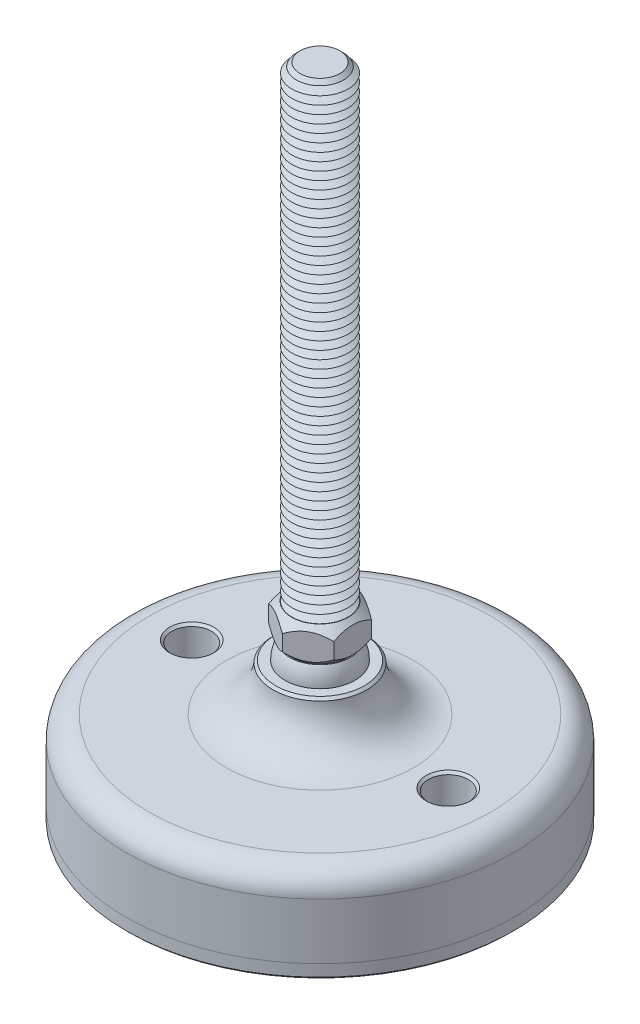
ISO-10303-21;
HEADER;
FILE_DESCRIPTION(('STEP AP214'),'2;1');
FILE_NAME('part.step','',(''),(''),'','','');
FILE_SCHEMA(('AUTOMOTIVE_DESIGN { 1 0 10303 214 1 1 1 1 }'));
ENDSEC;
DATA;
#1=APPLICATION_CONTEXT('core data for automotive mechanical design processes');
#2=APPLICATION_PROTOCOL_DEFINITION('international standard','automotive_design',2000,#1);
#3=PRODUCT_CONTEXT('',#1,'mechanical');
#4=PRODUCT('Part','Part','',(#3));
#5=PRODUCT_RELATED_PRODUCT_CATEGORY('part','',(#4));
#6=PRODUCT_DEFINITION_FORMATION('','',#4);
#7=PRODUCT_DEFINITION_CONTEXT('part definition',#1,'design');
#8=PRODUCT_DEFINITION('design','',#6,#7);
#9=PRODUCT_DEFINITION_SHAPE('','',#8);
#10=(LENGTH_UNIT() NAMED_UNIT(*) SI_UNIT(.MILLI.,.METRE.));
#11=(NAMED_UNIT(*) PLANE_ANGLE_UNIT() SI_UNIT($,.RADIAN.));
#12=(NAMED_UNIT(*) SI_UNIT($,.STERADIAN.) SOLID_ANGLE_UNIT());
#13=UNCERTAINTY_MEASURE_WITH_UNIT(LENGTH_MEASURE(1.E-05),#10,'distance_accuracy_value','');
#14=(GEOMETRIC_REPRESENTATION_CONTEXT(3) GLOBAL_UNCERTAINTY_ASSIGNED_CONTEXT((#13)) GLOBAL_UNIT_ASSIGNED_CONTEXT((#10,
#11,#12)) REPRESENTATION_CONTEXT('',''));
#15=CARTESIAN_POINT('',(0.,0.,0.));
#16=DIRECTION('',(0.,0.,1.));
#17=DIRECTION('',(1.,0.,0.));
#18=AXIS2_PLACEMENT_3D('',#15,#16,#17);
#19=CARTESIAN_POINT('',(0.,-27.,0.));
#20=DIRECTION('',(0.,1.,0.));
#21=DIRECTION('',(0.,0.,1.));
#22=AXIS2_PLACEMENT_3D('',#19,#20,#21);
#23=PLANE('',#22);
#24=CARTESIAN_POINT('',(-27.5,-27.,0.));
#25=DIRECTION('',(0.,1.,0.));
#26=DIRECTION('',(0.,0.,1.));
#27=AXIS2_PLACEMENT_3D('',#24,#25,#26);
#28=CIRCLE('',#27,4.25000000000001);
#29=CARTESIAN_POINT('',(-27.5,-27.,4.25000000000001));
#30=VERTEX_POINT('',#29);
#31=EDGE_CURVE('P0_E43',#30,#30,#28,.T.);
#32=ORIENTED_EDGE('',*,*,#31,.F.);
#33=EDGE_LOOP('',(#32));
#34=FACE_BOUND('',#33,.T.);
#35=CARTESIAN_POINT('',(27.5,-27.,0.));
#36=DIRECTION('',(0.,1.,0.));
#37=DIRECTION('',(0.,0.,1.));
#38=AXIS2_PLACEMENT_3D('',#35,#36,#37);
#39=CIRCLE('',#38,4.25000000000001);
#40=CARTESIAN_POINT('',(27.5,-27.,4.25000000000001));
#41=VERTEX_POINT('',#40);
#42=EDGE_CURVE('P0_E44',#41,#41,#39,.T.);
#43=ORIENTED_EDGE('',*,*,#42,.F.);
#44=EDGE_LOOP('',(#43));
#45=FACE_BOUND('',#44,.T.);
#46=CARTESIAN_POINT('',(0.,-27.,0.));
#47=DIRECTION('',(0.,1.,0.));
#48=DIRECTION('',(0.,0.,1.));
#49=AXIS2_PLACEMENT_3D('',#46,#47,#48);
#50=CIRCLE('',#49,41.5);
#51=CARTESIAN_POINT('',(0.,-27.,41.5));
#52=VERTEX_POINT('',#51);
#53=EDGE_CURVE('P0_E40',#52,#52,#50,.T.);
#54=ORIENTED_EDGE('',*,*,#53,.T.);
#55=EDGE_LOOP('',(#54));
#56=FACE_BOUND('',#55,.T.);
#57=ADVANCED_FACE('P0_F14',(#34,#45,#56),#23,.T.);
#58=CARTESIAN_POINT('',(0.,48.1654938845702,0.));
#59=DIRECTION('',(0.,1.,0.));
#60=DIRECTION('',(0.,0.,1.));
#61=AXIS2_PLACEMENT_3D('',#58,#59,#60);
#62=CYLINDRICAL_SURFACE('',#61,41.5);
#63=CARTESIAN_POINT('',(0.,-29.5,0.));
#64=DIRECTION('',(0.,-1.,0.));
#65=DIRECTION('',(0.,0.,-1.));
#66=AXIS2_PLACEMENT_3D('',#63,#64,#65);
#67=CIRCLE('',#66,41.5);
#68=CARTESIAN_POINT('',(0.,-29.5,-41.5));
#69=VERTEX_POINT('',#68);
#70=EDGE_CURVE('P0_E37',#69,#69,#67,.F.);
#71=ORIENTED_EDGE('',*,*,#70,.T.);
#72=EDGE_LOOP('',(#71));
#73=FACE_BOUND('',#72,.T.);
#74=ORIENTED_EDGE('',*,*,#53,.F.);
#75=EDGE_LOOP('',(#74));
#76=FACE_BOUND('',#75,.T.);
#77=ADVANCED_FACE('P0_F54',(#73,#76),#62,.T.);
#78=CARTESIAN_POINT('',(0.,-30.,41.5));
#79=DIRECTION('',(0.,-1.,0.));
#80=DIRECTION('',(0.,0.,-1.));
#81=AXIS2_PLACEMENT_3D('',#78,#79,#80);
#82=PLANE('',#81);
#83=CARTESIAN_POINT('',(27.5,-30.,0.));
#84=DIRECTION('',(0.,-1.,0.));
#85=DIRECTION('',(0.,0.,-1.));
#86=AXIS2_PLACEMENT_3D('',#83,#84,#85);
#87=CIRCLE('',#86,4.75);
#88=CARTESIAN_POINT('',(27.5,-30.,-4.75000000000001));
#89=VERTEX_POINT('',#88);
#90=EDGE_CURVE('P0_E25',#89,#89,#87,.F.);
#91=ORIENTED_EDGE('',*,*,#90,.T.);
#92=EDGE_LOOP('',(#91));
#93=FACE_BOUND('',#92,.T.);
#94=CARTESIAN_POINT('',(-27.5,-30.,0.));
#95=DIRECTION('',(0.,-1.,0.));
#96=DIRECTION('',(0.,0.,-1.));
#97=AXIS2_PLACEMENT_3D('',#94,#95,#96);
#98=CIRCLE('',#97,4.75);
#99=CARTESIAN_POINT('',(-27.5,-30.,-4.75));
#100=VERTEX_POINT('',#99);
#101=EDGE_CURVE('P0_E29',#100,#100,#98,.F.);
#102=ORIENTED_EDGE('',*,*,#101,.T.);
#103=EDGE_LOOP('',(#102));
#104=FACE_BOUND('',#103,.T.);
#105=CARTESIAN_POINT('',(0.,-30.,0.));
#106=DIRECTION('',(0.,-1.,0.));
#107=DIRECTION('',(0.,0.,-1.));
#108=AXIS2_PLACEMENT_3D('',#105,#106,#107);
#109=CIRCLE('',#108,41.);
#110=CARTESIAN_POINT('',(0.,-30.,-41.));
#111=VERTEX_POINT('',#110);
#112=EDGE_CURVE('P0_E34',#111,#111,#109,.T.);
#113=ORIENTED_EDGE('',*,*,#112,.T.);
#114=EDGE_LOOP('',(#113));
#115=FACE_BOUND('',#114,.T.);
#116=ADVANCED_FACE('P0_F61',(#93,#104,#115),#82,.T.);
#117=CARTESIAN_POINT('',(0.,-29.5,0.));
#118=DIRECTION('',(0.,1.,0.));
#119=DIRECTION('',(0.,0.,1.));
#120=AXIS2_PLACEMENT_3D('',#117,#118,#119);
#121=CONICAL_SURFACE('',#120,41.5,0.785398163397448);
#122=ORIENTED_EDGE('',*,*,#112,.F.);
#123=EDGE_LOOP('',(#122));
#124=FACE_BOUND('',#123,.T.);
#125=ORIENTED_EDGE('',*,*,#70,.F.);
#126=EDGE_LOOP('',(#125));
#127=FACE_BOUND('',#126,.T.);
#128=ADVANCED_FACE('P0_F68',(#124,#127),#121,.T.);
#129=CARTESIAN_POINT('',(27.5,-30.,0.));
#130=DIRECTION('',(0.,1.,0.));
#131=DIRECTION('',(0.,0.,1.));
#132=AXIS2_PLACEMENT_3D('',#129,#130,#131);
#133=CYLINDRICAL_SURFACE('',#132,4.25000000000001);
#134=CARTESIAN_POINT('',(27.5,-29.5,0.));
#135=DIRECTION('',(0.,-1.,0.));
#136=DIRECTION('',(0.,0.,-1.));
#137=AXIS2_PLACEMENT_3D('',#134,#135,#136);
#138=CIRCLE('',#137,4.25000000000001);
#139=CARTESIAN_POINT('',(27.5,-29.5,-4.25000000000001));
#140=VERTEX_POINT('',#139);
#141=EDGE_CURVE('P0_E21',#140,#140,#138,.T.);
#142=ORIENTED_EDGE('',*,*,#141,.T.);
#143=EDGE_LOOP('',(#142));
#144=FACE_BOUND('',#143,.T.);
#145=ORIENTED_EDGE('',*,*,#42,.T.);
#146=EDGE_LOOP('',(#145));
#147=FACE_BOUND('',#146,.T.);
#148=ADVANCED_FACE('P0_F74',(#144,#147),#133,.F.);
#149=CARTESIAN_POINT('',(-27.5,-30.,0.));
#150=DIRECTION('',(0.,1.,0.));
#151=DIRECTION('',(0.,0.,1.));
#152=AXIS2_PLACEMENT_3D('',#149,#150,#151);
#153=CYLINDRICAL_SURFACE('',#152,4.25000000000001);
#154=CARTESIAN_POINT('',(-27.5,-29.5,0.));
#155=DIRECTION('',(0.,-1.,0.));
#156=DIRECTION('',(0.,0.,-1.));
#157=AXIS2_PLACEMENT_3D('',#154,#155,#156);
#158=CIRCLE('',#157,4.25000000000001);
#159=CARTESIAN_POINT('',(-27.5,-29.5,-4.25000000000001));
#160=VERTEX_POINT('',#159);
#161=EDGE_CURVE('P0_E10',#160,#160,#158,.T.);
#162=ORIENTED_EDGE('',*,*,#161,.T.);
#163=EDGE_LOOP('',(#162));
#164=FACE_BOUND('',#163,.T.);
#165=ORIENTED_EDGE('',*,*,#31,.T.);
#166=EDGE_LOOP('',(#165));
#167=FACE_BOUND('',#166,.T.);
#168=ADVANCED_FACE('P0_F50',(#164,#167),#153,.F.);
#169=CARTESIAN_POINT('',(27.5,-30.,0.));
#170=DIRECTION('',(0.,-1.,0.));
#171=DIRECTION('',(0.,0.,-1.));
#172=AXIS2_PLACEMENT_3D('',#169,#170,#171);
#173=CONICAL_SURFACE('',#172,4.75,0.785398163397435);
#174=ORIENTED_EDGE('',*,*,#141,.F.);
#175=EDGE_LOOP('',(#174));
#176=FACE_BOUND('',#175,.T.);
#177=ORIENTED_EDGE('',*,*,#90,.F.);
#178=EDGE_LOOP('',(#177));
#179=FACE_BOUND('',#178,.T.);
#180=ADVANCED_FACE('P0_F76',(#176,#179),#173,.F.);
#181=CARTESIAN_POINT('',(-27.5,-30.,0.));
#182=DIRECTION('',(0.,-1.,0.));
#183=DIRECTION('',(0.,0.,-1.));
#184=AXIS2_PLACEMENT_3D('',#181,#182,#183);
#185=CONICAL_SURFACE('',#184,4.75,0.785398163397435);
#186=ORIENTED_EDGE('',*,*,#161,.F.);
#187=EDGE_LOOP('',(#186));
#188=FACE_BOUND('',#187,.T.);
#189=ORIENTED_EDGE('',*,*,#101,.F.);
#190=EDGE_LOOP('',(#189));
#191=FACE_BOUND('',#190,.T.);
#192=ADVANCED_FACE('P0_F16',(#188,#191),#185,.F.);
#193=CLOSED_SHELL('',(#57,#77,#116,#128,#148,#168,#180,#192));
#194=MANIFOLD_SOLID_BREP('P0_B1',#193);
#195=CARTESIAN_POINT('',(0.,0.,0.));
#196=DIRECTION('',(0.,1.,0.));
#197=DIRECTION('',(0.,0.,-1.));
#198=AXIS2_PLACEMENT_3D('',#195,#196,#197);
#199=SPHERICAL_SURFACE('',#198,7.5);
#200=CARTESIAN_POINT('',(0.,3.75,0.));
#201=DIRECTION('',(0.,-1.,0.));
#202=DIRECTION('',(0.,0.,-1.));
#203=AXIS2_PLACEMENT_3D('',#200,#201,#202);
#204=CIRCLE('',#203,6.49519052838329);
#205=CARTESIAN_POINT('',(0.,3.75,-6.49519052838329));
#206=VERTEX_POINT('',#205);
#207=EDGE_CURVE('P1_E211',#206,#206,#204,.F.);
#208=ORIENTED_EDGE('',*,*,#207,.F.);
#209=EDGE_LOOP('',(#208));
#210=FACE_BOUND('',#209,.T.);
#211=ADVANCED_FACE('P1_F16',(#210),#199,.T.);
#212=CARTESIAN_POINT('',(0.,3.75,0.));
#213=DIRECTION('',(0.,1.,0.));
#214=DIRECTION('',(0.,0.,1.));
#215=AXIS2_PLACEMENT_3D('',#212,#213,#214);
#216=CONICAL_SURFACE('',#215,6.26419292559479,0.785398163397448);
#217=CARTESIAN_POINT('',(0.,3.75,0.));
#218=DIRECTION('',(0.,1.,0.));
#219=DIRECTION('',(0.,0.,1.));
#220=AXIS2_PLACEMENT_3D('',#217,#218,#219);
#221=CIRCLE('',#220,6.26419292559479);
#222=CARTESIAN_POINT('',(0.,3.75,6.26419292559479));
#223=VERTEX_POINT('',#222);
#224=EDGE_CURVE('P1_E215',#223,#223,#221,.T.);
#225=ORIENTED_EDGE('',*,*,#224,.T.);
#226=EDGE_LOOP('',(#225));
#227=FACE_BOUND('',#226,.T.);
#228=CARTESIAN_POINT('',(-7.,8.22175145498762,-8.1400553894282));
#229=CARTESIAN_POINT('',(-7.,8.07177748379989,-7.94220937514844));
#230=CARTESIAN_POINT('',(-7.,7.92322959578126,-7.74326459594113));
#231=CARTESIAN_POINT('',(-7.,7.62962733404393,-7.34274065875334));
#232=CARTESIAN_POINT('',(-7.,7.48457383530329,-7.14116086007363));
#233=CARTESIAN_POINT('',(-7.,7.19756981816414,-6.73345531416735));
#234=CARTESIAN_POINT('',(-7.,7.05565202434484,-6.52730645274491));
#235=CARTESIAN_POINT('',(-7.,6.77703382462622,-6.11152362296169));
#236=CARTESIAN_POINT('',(-7.,6.64033305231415,-5.90188990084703));
#237=CARTESIAN_POINT('',(-7.,6.36550740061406,-5.46619755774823));
#238=CARTESIAN_POINT('',(-7.,6.22776674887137,-5.23989534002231));
#239=CARTESIAN_POINT('',(-7.,5.96123372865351,-4.78200028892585));
#240=CARTESIAN_POINT('',(-7.,5.83244279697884,-4.55040661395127));
#241=CARTESIAN_POINT('',(-7.,5.58658047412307,-4.08193183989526));
#242=CARTESIAN_POINT('',(-7.,5.46947462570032,-3.8450689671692));
#243=CARTESIAN_POINT('',(-7.,5.24960465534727,-3.36483104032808));
#244=CARTESIAN_POINT('',(-7.,5.14683397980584,-3.12145902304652));
#245=CARTESIAN_POINT('',(-7.,4.96723655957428,-2.64866791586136));
#246=CARTESIAN_POINT('',(-7.,4.88895097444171,-2.41980876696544));
#247=CARTESIAN_POINT('',(-7.,4.75072959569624,-1.9565107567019));
#248=CARTESIAN_POINT('',(-7.,4.69079504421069,-1.72207151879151));
#249=CARTESIAN_POINT('',(-7.,4.59342684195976,-1.25295119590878));
#250=CARTESIAN_POINT('',(-7.,4.5556027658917,-1.01835249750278));
#251=CARTESIAN_POINT('',(-7.,4.50320231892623,-0.546559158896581));
#252=CARTESIAN_POINT('',(-7.,4.48862178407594,-0.309364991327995));
#253=CARTESIAN_POINT('',(-7.,4.48382612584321,0.156313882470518));
#254=CARTESIAN_POINT('',(-7.,4.49271264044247,0.384789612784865));
#255=CARTESIAN_POINT('',(-7.,4.53235928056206,0.839822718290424));
#256=CARTESIAN_POINT('',(-7.,4.56312150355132,1.06637990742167));
#257=CARTESIAN_POINT('',(-7.,4.64535130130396,1.51976805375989));
#258=CARTESIAN_POINT('',(-7.,4.69717402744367,1.74653354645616));
#259=CARTESIAN_POINT('',(-7.,4.81873728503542,2.19511331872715));
#260=CARTESIAN_POINT('',(-7.,4.88847641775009,2.41692798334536));
#261=CARTESIAN_POINT('',(-7.,5.04951755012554,2.87389766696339));
#262=CARTESIAN_POINT('',(-7.,5.14215063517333,3.10857869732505));
#263=CARTESIAN_POINT('',(-7.,5.3416605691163,3.57185972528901));
#264=CARTESIAN_POINT('',(-7.,5.44854400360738,3.80045685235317));
#265=CARTESIAN_POINT('',(-7.,5.6740138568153,4.25267813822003));
#266=CARTESIAN_POINT('',(-7.,5.79263686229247,4.47628390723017));
#267=CARTESIAN_POINT('',(-7.,6.03896666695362,4.91835509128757));
#268=CARTESIAN_POINT('',(-7.,6.16667203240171,5.13682131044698));
#269=CARTESIAN_POINT('',(-7.,6.4228595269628,5.55855563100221));
#270=CARTESIAN_POINT('',(-7.,6.55098806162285,5.76203966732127));
#271=CARTESIAN_POINT('',(-7.,6.81264959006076,6.16551366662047));
#272=CARTESIAN_POINT('',(-7.,6.94618299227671,6.36550336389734));
#273=CARTESIAN_POINT('',(-7.,7.21658951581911,6.76082742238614));
#274=CARTESIAN_POINT('',(-7.,7.35342681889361,6.95618637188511));
#275=CARTESIAN_POINT('',(-7.,7.6307324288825,7.34423185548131));
#276=CARTESIAN_POINT('',(-7.,7.77119972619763,7.53691911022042));
#277=CARTESIAN_POINT('',(-7.,7.91315155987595,7.72848711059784));
#278=B_SPLINE_CURVE_WITH_KNOTS('',3,(#228,#229,#230,#231,#232,#233,#234,#235,#236,#237,#238,
#239,#240,#241,#242,#243,#244,#245,#246,#247,#248,#249,#250,#251,#252,#253,#254,#255,#256,#257,
#258,#259,#260,#261,#262,#263,#264,#265,#266,#267,#268,#269,#270,#271,#272,#273,#274,#275,#276,
#277),.UNSPECIFIED.,.F.,.F.,(4,2,2,2,2,2,2,2,2,2,2,2,2,2,2,2,2,2,2,2,2,2,2,2,4),(0.,
0.744807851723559,1.48980030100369,2.2405614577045,2.99126978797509,3.78587980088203,
4.58061708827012,5.37293691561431,6.16489332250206,6.88989369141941,7.61494312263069,
8.32676947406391,9.0384682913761,9.72332048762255,10.4082383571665,11.1052200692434,
11.8021473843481,12.5584650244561,13.3151334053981,14.0742390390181,14.8332251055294,
15.5545151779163,16.2758598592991,16.9913609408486,17.7066651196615),.UNSPECIFIED.);
#279=CARTESIAN_POINT('',(-7.,5.56871084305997,-4.04145188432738));
#280=VERTEX_POINT('',#279);
#281=CARTESIAN_POINT('',(-7.,5.56871084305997,4.04145188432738));
#282=VERTEX_POINT('',#281);
#283=EDGE_CURVE('P1_E25',#280,#282,#278,.T.);
#284=ORIENTED_EDGE('',*,*,#283,.F.);
#285=CARTESIAN_POINT('',(0.000199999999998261,5.56882631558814,-8.0830192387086));
#286=CARTESIAN_POINT('',(-0.120159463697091,5.49934419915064,-8.01352966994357));
#287=CARTESIAN_POINT('',(-0.241444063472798,5.43199440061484,-7.94350597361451));
#288=CARTESIAN_POINT('',(-0.486045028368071,5.30220807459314,-7.80228554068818));
#289=CARTESIAN_POINT('',(-0.60936245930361,5.2397742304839,-7.73108818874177));
#290=CARTESIAN_POINT('',(-0.983781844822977,5.06028719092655,-7.51491705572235));
#291=CARTESIAN_POINT('',(-1.23805341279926,4.95181416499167,-7.36811329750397));
#292=CARTESIAN_POINT('',(-1.75081233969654,4.76606165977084,-7.07207179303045));
#293=CARTESIAN_POINT('',(-2.00916864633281,4.68831421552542,-6.92290970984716));
#294=CARTESIAN_POINT('',(-2.40095049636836,4.59837958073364,-6.69671435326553));
#295=CARTESIAN_POINT('',(-2.53212124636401,4.57286115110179,-6.62098288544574));
#296=CARTESIAN_POINT('',(-2.79557335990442,4.53129725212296,-6.4688787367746));
#297=CARTESIAN_POINT('',(-2.92785455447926,4.5152503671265,-6.39250615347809));
#298=CARTESIAN_POINT('',(-3.25020698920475,4.48834537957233,-6.2063958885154));
#299=CARTESIAN_POINT('',(-3.44062555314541,4.48270029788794,-6.09645767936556));
#300=CARTESIAN_POINT('',(-3.82111946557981,4.49217587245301,-5.87677941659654));
#301=CARTESIAN_POINT('',(-4.01119467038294,4.5073038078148,-5.76703944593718));
#302=CARTESIAN_POINT('',(-4.38955306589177,4.55743368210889,-5.54859412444));
#303=CARTESIAN_POINT('',(-4.57783401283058,4.5924578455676,-5.43989006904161));
#304=CARTESIAN_POINT('',(-4.95115981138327,4.68047604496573,-5.22435031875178));
#305=CARTESIAN_POINT('',(-5.13620490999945,4.73346870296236,-5.1175144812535));
#306=CARTESIAN_POINT('',(-5.46469033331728,4.84248989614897,-4.92786333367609));
#307=CARTESIAN_POINT('',(-5.6088580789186,4.89565100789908,-4.8446280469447));
#308=CARTESIAN_POINT('',(-5.8946056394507,5.0105398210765,-4.67965161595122));
#309=CARTESIAN_POINT('',(-6.03618537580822,5.07226778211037,-4.5979105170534));
#310=CARTESIAN_POINT('',(-6.31631098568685,5.20290661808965,-4.43617992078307));
#311=CARTESIAN_POINT('',(-6.4548648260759,5.27179490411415,-4.3561858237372));
#312=CARTESIAN_POINT('',(-6.72940692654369,5.41585000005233,-4.19767886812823));
#313=CARTESIAN_POINT('',(-6.86539669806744,5.49101295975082,-4.11916513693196));
#314=CARTESIAN_POINT('',(-7.0002,5.56882631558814,-4.04133641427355));
#315=B_SPLINE_CURVE_WITH_KNOTS('',3,(#285,#286,#287,#288,#289,#290,#291,#292,#293,#294,#295,
#296,#297,#298,#299,#300,#301,#302,#303,#304,#305,#306,#307,#308,#309,#310,#311,#312,#313,#314),
.UNSPECIFIED.,.F.,.F.,(4,2,2,2,2,2,2,2,2,2,2,2,2,2,4),(0.,0.466112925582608,0.932478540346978,
1.87024464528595,2.79312018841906,3.25365289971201,3.71411676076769,4.37293813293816,
5.03199042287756,5.69178034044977,6.35151967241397,6.8755322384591,7.39956068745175,
7.92198344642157,8.44408796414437),.UNSPECIFIED.);
#316=CARTESIAN_POINT('',(0.,5.56871084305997,-8.08290376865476));
#317=VERTEX_POINT('',#316);
#318=EDGE_CURVE('P1_E116',#317,#280,#315,.T.);
#319=ORIENTED_EDGE('',*,*,#318,.F.);
#320=CARTESIAN_POINT('',(7.00019999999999,5.56882631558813,-4.04133641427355));
#321=CARTESIAN_POINT('',(6.8798405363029,5.49934419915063,-4.11082598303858));
#322=CARTESIAN_POINT('',(6.7585559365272,5.43199440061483,-4.18084967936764));
#323=CARTESIAN_POINT('',(6.51395497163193,5.30220807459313,-4.32207011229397));
#324=CARTESIAN_POINT('',(6.39063754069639,5.2397742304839,-4.39326746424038));
#325=CARTESIAN_POINT('',(6.01621815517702,5.06028719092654,-4.6094385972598));
#326=CARTESIAN_POINT('',(5.76194658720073,4.95181416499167,-4.75624235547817));
#327=CARTESIAN_POINT('',(5.24918766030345,4.76606165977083,-5.0522838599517));
#328=CARTESIAN_POINT('',(4.99083135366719,4.68831421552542,-5.20144594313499));
#329=CARTESIAN_POINT('',(4.59904950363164,4.59837958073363,-5.42764129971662));
#330=CARTESIAN_POINT('',(4.46787875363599,4.57286115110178,-5.50337276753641));
#331=CARTESIAN_POINT('',(4.20442664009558,4.53129725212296,-5.65547691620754));
#332=CARTESIAN_POINT('',(4.07214544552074,4.5152503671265,-5.73184949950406));
#333=CARTESIAN_POINT('',(3.74979301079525,4.48834537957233,-5.91795976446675));
#334=CARTESIAN_POINT('',(3.55937444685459,4.48270029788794,-6.02789797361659));
#335=CARTESIAN_POINT('',(3.17888053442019,4.49217587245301,-6.2475762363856));
#336=CARTESIAN_POINT('',(2.98880532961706,4.5073038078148,-6.35731620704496));
#337=CARTESIAN_POINT('',(2.61044693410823,4.55743368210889,-6.57576152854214));
#338=CARTESIAN_POINT('',(2.42216598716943,4.5924578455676,-6.68446558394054));
#339=CARTESIAN_POINT('',(2.04884018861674,4.68047604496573,-6.90000533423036));
#340=CARTESIAN_POINT('',(1.86379509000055,4.73346870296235,-7.00684117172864));
#341=CARTESIAN_POINT('',(1.53530966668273,4.84248989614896,-7.19649231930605));
#342=CARTESIAN_POINT('',(1.3911419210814,4.89565100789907,-7.27972760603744));
#343=CARTESIAN_POINT('',(1.1053943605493,5.0105398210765,-7.44470403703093));
#344=CARTESIAN_POINT('',(0.96381462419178,5.07226778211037,-7.52644513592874));
#345=CARTESIAN_POINT('',(0.683689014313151,5.20290661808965,-7.68817573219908));
#346=CARTESIAN_POINT('',(0.545135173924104,5.27179490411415,-7.76816982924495));
#347=CARTESIAN_POINT('',(0.270593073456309,5.41585000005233,-7.92667678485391));
#348=CARTESIAN_POINT('',(0.134603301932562,5.49101295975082,-8.00519051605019));
#349=CARTESIAN_POINT('',(-0.00020000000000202,5.56882631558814,-8.0830192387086));
#350=B_SPLINE_CURVE_WITH_KNOTS('',3,(#320,#321,#322,#323,#324,#325,#326,#327,#328,#329,#330,
#331,#332,#333,#334,#335,#336,#337,#338,#339,#340,#341,#342,#343,#344,#345,#346,#347,#348,#349),
.UNSPECIFIED.,.F.,.F.,(4,2,2,2,2,2,2,2,2,2,2,2,2,2,4),(0.,0.466112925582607,0.932478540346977,
1.87024464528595,2.79312018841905,3.25365289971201,3.71411676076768,4.37293813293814,
5.03199042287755,5.69178034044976,6.35151967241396,6.87553223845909,7.39956068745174,
7.92198344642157,8.44408796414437),.UNSPECIFIED.);
#351=CARTESIAN_POINT('',(7.,5.56871084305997,-4.04145188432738));
#352=VERTEX_POINT('',#351);
#353=EDGE_CURVE('P1_E123',#352,#317,#350,.T.);
#354=ORIENTED_EDGE('',*,*,#353,.F.);
#355=CARTESIAN_POINT('',(6.99999999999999,8.22175145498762,-8.1400553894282));
#356=CARTESIAN_POINT('',(6.99999999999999,8.07177748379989,-7.94220937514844));
#357=CARTESIAN_POINT('',(6.99999999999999,7.92322959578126,-7.74326459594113));
#358=CARTESIAN_POINT('',(6.99999999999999,7.62962733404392,-7.34274065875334));
#359=CARTESIAN_POINT('',(6.99999999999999,7.48457383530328,-7.14116086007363));
#360=CARTESIAN_POINT('',(6.99999999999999,7.19756981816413,-6.73345531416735));
#361=CARTESIAN_POINT('',(6.99999999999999,7.05565202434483,-6.52730645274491));
#362=CARTESIAN_POINT('',(6.99999999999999,6.77703382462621,-6.11152362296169));
#363=CARTESIAN_POINT('',(6.99999999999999,6.64033305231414,-5.90188990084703));
#364=CARTESIAN_POINT('',(6.99999999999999,6.36550740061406,-5.46619755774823));
#365=CARTESIAN_POINT('',(6.99999999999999,6.22776674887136,-5.23989534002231));
#366=CARTESIAN_POINT('',(6.99999999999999,5.9612337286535,-4.78200028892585));
#367=CARTESIAN_POINT('',(6.99999999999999,5.83244279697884,-4.55040661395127));
#368=CARTESIAN_POINT('',(6.99999999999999,5.58658047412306,-4.08193183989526));
#369=CARTESIAN_POINT('',(6.99999999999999,5.46947462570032,-3.8450689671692));
#370=CARTESIAN_POINT('',(6.99999999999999,5.24960465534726,-3.36483104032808));
#371=CARTESIAN_POINT('',(6.99999999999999,5.14683397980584,-3.12145902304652));
#372=CARTESIAN_POINT('',(6.99999999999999,4.96723655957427,-2.64866791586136));
#373=CARTESIAN_POINT('',(6.99999999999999,4.88895097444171,-2.41980876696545));
#374=CARTESIAN_POINT('',(6.99999999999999,4.75072959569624,-1.9565107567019));
#375=CARTESIAN_POINT('',(6.99999999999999,4.69079504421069,-1.72207151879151));
#376=CARTESIAN_POINT('',(6.99999999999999,4.59342684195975,-1.25295119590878));
#377=CARTESIAN_POINT('',(6.99999999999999,4.5556027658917,-1.01835249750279));
#378=CARTESIAN_POINT('',(6.99999999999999,4.50320231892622,-0.546559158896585));
#379=CARTESIAN_POINT('',(6.99999999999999,4.48862178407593,-0.309364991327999));
#380=CARTESIAN_POINT('',(6.99999999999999,4.48382612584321,0.156313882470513));
#381=CARTESIAN_POINT('',(6.99999999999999,4.49271264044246,0.38478961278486));
#382=CARTESIAN_POINT('',(6.99999999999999,4.53235928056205,0.83982271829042));
#383=CARTESIAN_POINT('',(6.99999999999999,4.56312150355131,1.06637990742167));
#384=CARTESIAN_POINT('',(6.99999999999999,4.64535130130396,1.51976805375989));
#385=CARTESIAN_POINT('',(6.99999999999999,4.69717402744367,1.74653354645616));
#386=CARTESIAN_POINT('',(6.99999999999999,4.81873728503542,2.19511331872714));
#387=CARTESIAN_POINT('',(7.,4.88847641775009,2.41692798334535));
#388=CARTESIAN_POINT('',(7.,5.04951755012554,2.87389766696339));
#389=CARTESIAN_POINT('',(7.,5.14215063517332,3.10857869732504));
#390=CARTESIAN_POINT('',(7.,5.34166056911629,3.571859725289));
#391=CARTESIAN_POINT('',(7.,5.44854400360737,3.80045685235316));
#392=CARTESIAN_POINT('',(7.,5.67401385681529,4.25267813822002));
#393=CARTESIAN_POINT('',(7.,5.79263686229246,4.47628390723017));
#394=CARTESIAN_POINT('',(7.,6.03896666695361,4.91835509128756));
#395=CARTESIAN_POINT('',(7.,6.1666720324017,5.13682131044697));
#396=CARTESIAN_POINT('',(7.,6.42285952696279,5.5585556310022));
#397=CARTESIAN_POINT('',(7.,6.55098806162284,5.76203966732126));
#398=CARTESIAN_POINT('',(7.,6.81264959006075,6.16551366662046));
#399=CARTESIAN_POINT('',(7.,6.9461829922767,6.36550336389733));
#400=CARTESIAN_POINT('',(7.,7.21658951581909,6.76082742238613));
#401=CARTESIAN_POINT('',(7.,7.3534268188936,6.9561863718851));
#402=CARTESIAN_POINT('',(7.,7.63073242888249,7.3442318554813));
#403=CARTESIAN_POINT('',(7.,7.77119972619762,7.53691911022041));
#404=CARTESIAN_POINT('',(7.,7.91315155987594,7.72848711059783));
#405=B_SPLINE_CURVE_WITH_KNOTS('',3,(#355,#356,#357,#358,#359,#360,#361,#362,#363,#364,#365,
#366,#367,#368,#369,#370,#371,#372,#373,#374,#375,#376,#377,#378,#379,#380,#381,#382,#383,#384,
#385,#386,#387,#388,#389,#390,#391,#392,#393,#394,#395,#396,#397,#398,#399,#400,#401,#402,#403,
#404),.UNSPECIFIED.,.F.,.F.,(4,2,2,2,2,2,2,2,2,2,2,2,2,2,2,2,2,2,2,2,2,2,2,2,4),(0.,
0.744807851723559,1.48980030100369,2.2405614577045,2.9912697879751,3.78587980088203,
4.58061708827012,5.3729369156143,6.16489332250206,6.8898936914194,7.61494312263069,
8.32676947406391,9.03846829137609,9.72332048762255,10.4082383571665,11.1052200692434,
11.8021473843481,12.5584650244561,13.3151334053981,14.0742390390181,14.8332251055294,
15.5545151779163,16.275859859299,16.9913609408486,17.7066651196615),.UNSPECIFIED.);
#406=CARTESIAN_POINT('',(6.99999999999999,5.56871084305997,4.04145188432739));
#407=VERTEX_POINT('',#406);
#408=EDGE_CURVE('P1_E71',#407,#352,#405,.F.);
#409=ORIENTED_EDGE('',*,*,#408,.F.);
#410=CARTESIAN_POINT('',(-0.000200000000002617,5.56882631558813,8.0830192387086));
#411=CARTESIAN_POINT('',(0.120159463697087,5.49934419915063,8.01352966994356));
#412=CARTESIAN_POINT('',(0.241444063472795,5.43199440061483,7.9435059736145));
#413=CARTESIAN_POINT('',(0.486045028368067,5.30220807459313,7.80228554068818));
#414=CARTESIAN_POINT('',(0.609362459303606,5.2397742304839,7.73108818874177));
#415=CARTESIAN_POINT('',(0.983781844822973,5.06028719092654,7.51491705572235));
#416=CARTESIAN_POINT('',(1.23805341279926,4.95181416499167,7.36811329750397));
#417=CARTESIAN_POINT('',(1.75081233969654,4.76606165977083,7.07207179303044));
#418=CARTESIAN_POINT('',(2.00916864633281,4.68831421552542,6.92290970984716));
#419=CARTESIAN_POINT('',(2.40095049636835,4.59837958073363,6.69671435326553));
#420=CARTESIAN_POINT('',(2.53212124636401,4.57286115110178,6.62098288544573));
#421=CARTESIAN_POINT('',(2.79557335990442,4.53129725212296,6.4688787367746));
#422=CARTESIAN_POINT('',(2.92785455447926,4.5152503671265,6.39250615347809));
#423=CARTESIAN_POINT('',(3.25020698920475,4.48834537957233,6.2063958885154));
#424=CARTESIAN_POINT('',(3.44062555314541,4.48270029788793,6.09645767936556));
#425=CARTESIAN_POINT('',(3.82111946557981,4.492175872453,5.87677941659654));
#426=CARTESIAN_POINT('',(4.01119467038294,4.5073038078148,5.76703944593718));
#427=CARTESIAN_POINT('',(4.38955306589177,4.55743368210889,5.54859412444));
#428=CARTESIAN_POINT('',(4.57783401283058,4.5924578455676,5.4398900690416));
#429=CARTESIAN_POINT('',(4.95115981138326,4.68047604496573,5.22435031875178));
#430=CARTESIAN_POINT('',(5.13620490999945,4.73346870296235,5.1175144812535));
#431=CARTESIAN_POINT('',(5.46469033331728,4.84248989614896,4.92786333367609));
#432=CARTESIAN_POINT('',(5.6088580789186,4.89565100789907,4.8446280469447));
#433=CARTESIAN_POINT('',(5.8946056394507,5.01053982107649,4.67965161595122));
#434=CARTESIAN_POINT('',(6.03618537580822,5.07226778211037,4.5979105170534));
#435=CARTESIAN_POINT('',(6.31631098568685,5.20290661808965,4.43617992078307));
#436=CARTESIAN_POINT('',(6.45486482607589,5.27179490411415,4.3561858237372));
#437=CARTESIAN_POINT('',(6.72940692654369,5.41585000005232,4.19767886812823));
#438=CARTESIAN_POINT('',(6.86539669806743,5.49101295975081,4.11916513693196));
#439=CARTESIAN_POINT('',(7.00019999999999,5.56882631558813,4.04133641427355));
#440=B_SPLINE_CURVE_WITH_KNOTS('',3,(#410,#411,#412,#413,#414,#415,#416,#417,#418,#419,#420,
#421,#422,#423,#424,#425,#426,#427,#428,#429,#430,#431,#432,#433,#434,#435,#436,#437,#438,#439),
.UNSPECIFIED.,.F.,.F.,(4,2,2,2,2,2,2,2,2,2,2,2,2,2,4),(0.,0.466112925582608,0.932478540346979,
1.87024464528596,2.79312018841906,3.25365289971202,3.71411676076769,4.37293813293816,
5.03199042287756,5.69178034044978,6.35151967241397,6.8755322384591,7.39956068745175,
7.92198344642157,8.44408796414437),.UNSPECIFIED.);
#441=CARTESIAN_POINT('',(0.,5.56871084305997,8.08290376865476));
#442=VERTEX_POINT('',#441);
#443=EDGE_CURVE('P1_E68',#442,#407,#440,.T.);
#444=ORIENTED_EDGE('',*,*,#443,.F.);
#445=CARTESIAN_POINT('',(-7.0002,5.56882631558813,4.04133641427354));
#446=CARTESIAN_POINT('',(-6.87984053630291,5.49934419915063,4.11082598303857));
#447=CARTESIAN_POINT('',(-6.7585559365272,5.43199440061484,4.18084967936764));
#448=CARTESIAN_POINT('',(-6.51395497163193,5.30220807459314,4.32207011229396));
#449=CARTESIAN_POINT('',(-6.39063754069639,5.2397742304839,4.39326746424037));
#450=CARTESIAN_POINT('',(-6.01621815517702,5.06028719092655,4.60943859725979));
#451=CARTESIAN_POINT('',(-5.76194658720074,4.95181416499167,4.75624235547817));
#452=CARTESIAN_POINT('',(-5.24918766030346,4.76606165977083,5.0522838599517));
#453=CARTESIAN_POINT('',(-4.99083135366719,4.68831421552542,5.20144594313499));
#454=CARTESIAN_POINT('',(-4.59904950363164,4.59837958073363,5.42764129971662));
#455=CARTESIAN_POINT('',(-4.46787875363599,4.57286115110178,5.50337276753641));
#456=CARTESIAN_POINT('',(-4.20442664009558,4.53129725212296,5.65547691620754));
#457=CARTESIAN_POINT('',(-4.07214544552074,4.5152503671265,5.73184949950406));
#458=CARTESIAN_POINT('',(-3.74979301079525,4.48834537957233,5.91795976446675));
#459=CARTESIAN_POINT('',(-3.55937444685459,4.48270029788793,6.02789797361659));
#460=CARTESIAN_POINT('',(-3.17888053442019,4.492175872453,6.2475762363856));
#461=CARTESIAN_POINT('',(-2.98880532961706,4.5073038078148,6.35731620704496));
#462=CARTESIAN_POINT('',(-2.61044693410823,4.55743368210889,6.57576152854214));
#463=CARTESIAN_POINT('',(-2.42216598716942,4.5924578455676,6.68446558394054));
#464=CARTESIAN_POINT('',(-2.04884018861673,4.68047604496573,6.90000533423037));
#465=CARTESIAN_POINT('',(-1.86379509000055,4.73346870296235,7.00684117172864));
#466=CARTESIAN_POINT('',(-1.53530966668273,4.84248989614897,7.19649231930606));
#467=CARTESIAN_POINT('',(-1.3911419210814,4.89565100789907,7.27972760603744));
#468=CARTESIAN_POINT('',(-1.1053943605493,5.01053982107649,7.44470403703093));
#469=CARTESIAN_POINT('',(-0.963814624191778,5.07226778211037,7.52644513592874));
#470=CARTESIAN_POINT('',(-0.683689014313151,5.20290661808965,7.68817573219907));
#471=CARTESIAN_POINT('',(-0.545135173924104,5.27179490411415,7.76816982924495));
#472=CARTESIAN_POINT('',(-0.270593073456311,5.41585000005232,7.92667678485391));
#473=CARTESIAN_POINT('',(-0.134603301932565,5.49101295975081,8.00519051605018));
#474=CARTESIAN_POINT('',(0.000199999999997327,5.56882631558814,8.0830192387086));
#475=B_SPLINE_CURVE_WITH_KNOTS('',3,(#445,#446,#447,#448,#449,#450,#451,#452,#453,#454,#455,
#456,#457,#458,#459,#460,#461,#462,#463,#464,#465,#466,#467,#468,#469,#470,#471,#472,#473,#474),
.UNSPECIFIED.,.F.,.F.,(4,2,2,2,2,2,2,2,2,2,2,2,2,2,4),(0.,0.466112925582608,0.93247854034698,
1.87024464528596,2.79312018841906,3.25365289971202,3.71411676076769,4.37293813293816,
5.03199042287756,5.69178034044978,6.35151967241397,6.8755322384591,7.39956068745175,
7.92198344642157,8.44408796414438),.UNSPECIFIED.);
#476=EDGE_CURVE('P1_E40',#282,#442,#475,.T.);
#477=ORIENTED_EDGE('',*,*,#476,.F.);
#478=EDGE_LOOP('',(#284,#319,#354,#409,#444,#477));
#479=FACE_BOUND('',#478,.T.);
#480=ADVANCED_FACE('P1_F69',(#227,#479),#216,.T.);
#481=CARTESIAN_POINT('',(0.,3.75,6.26419292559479));
#482=DIRECTION('',(0.,-1.,0.));
#483=DIRECTION('',(0.,0.,-1.));
#484=AXIS2_PLACEMENT_3D('',#481,#482,#483);
#485=PLANE('',#484);
#486=ORIENTED_EDGE('',*,*,#207,.T.);
#487=EDGE_LOOP('',(#486));
#488=FACE_BOUND('',#487,.T.);
#489=ORIENTED_EDGE('',*,*,#224,.F.);
#490=EDGE_LOOP('',(#489));
#491=FACE_BOUND('',#490,.T.);
#492=ADVANCED_FACE('P1_F107',(#488,#491),#485,.F.);
#493=CARTESIAN_POINT('',(-7.,11.,4.04145188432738));
#494=DIRECTION('',(0.5,0.,-0.866025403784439));
#495=DIRECTION('',(-0.866025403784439,0.,-0.5));
#496=AXIS2_PLACEMENT_3D('',#493,#494,#495);
#497=PLANE('',#496);
#498=DIRECTION('',(0.,-1.,0.));
#499=VECTOR('',#498,1.);
#500=CARTESIAN_POINT('',(0.,11.,8.08290376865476));
#501=LINE('',#500,#499);
#502=CARTESIAN_POINT('',(0.,8.97927405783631,8.08290376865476));
#503=VERTEX_POINT('',#502);
#504=EDGE_CURVE('P1_E82',#503,#442,#501,.T.);
#505=ORIENTED_EDGE('',*,*,#504,.F.);
#506=CARTESIAN_POINT('',(0.000199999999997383,8.97915858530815,8.0830192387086));
#507=CARTESIAN_POINT('',(-0.120159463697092,9.04864070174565,8.01352966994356));
#508=CARTESIAN_POINT('',(-0.241444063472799,9.11599050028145,7.9435059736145));
#509=CARTESIAN_POINT('',(-0.486045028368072,9.24577682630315,7.80228554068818));
#510=CARTESIAN_POINT('',(-0.609362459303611,9.30821067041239,7.73108818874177));
#511=CARTESIAN_POINT('',(-0.983781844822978,9.48769770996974,7.51491705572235));
#512=CARTESIAN_POINT('',(-1.23805341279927,9.59617073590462,7.36811329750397));
#513=CARTESIAN_POINT('',(-1.75081233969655,9.78192324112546,7.07207179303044));
#514=CARTESIAN_POINT('',(-2.00916864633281,9.85967068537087,6.92290970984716));
#515=CARTESIAN_POINT('',(-2.40095049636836,9.94960532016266,6.69671435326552));
#516=CARTESIAN_POINT('',(-2.53212124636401,9.9751237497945,6.62098288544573));
#517=CARTESIAN_POINT('',(-2.79557335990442,10.0166876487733,6.4688787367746));
#518=CARTESIAN_POINT('',(-2.92785455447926,10.0327345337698,6.39250615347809));
#519=CARTESIAN_POINT('',(-3.25020698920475,10.059639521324,6.2063958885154));
#520=CARTESIAN_POINT('',(-3.44062555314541,10.0652846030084,6.09645767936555));
#521=CARTESIAN_POINT('',(-3.82111946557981,10.0558090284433,5.87677941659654));
#522=CARTESIAN_POINT('',(-4.01119467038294,10.0406810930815,5.76703944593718));
#523=CARTESIAN_POINT('',(-4.38955306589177,9.9905512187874,5.54859412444));
#524=CARTESIAN_POINT('',(-4.57783401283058,9.95552705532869,5.4398900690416));
#525=CARTESIAN_POINT('',(-4.95115981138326,9.86750885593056,5.22435031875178));
#526=CARTESIAN_POINT('',(-5.13620490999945,9.81451619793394,5.1175144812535));
#527=CARTESIAN_POINT('',(-5.46469033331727,9.70549500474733,4.92786333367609));
#528=CARTESIAN_POINT('',(-5.6088580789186,9.65233389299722,4.8446280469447));
#529=CARTESIAN_POINT('',(-5.8946056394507,9.5374450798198,4.67965161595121));
#530=CARTESIAN_POINT('',(-6.03618537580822,9.47571711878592,4.5979105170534));
#531=CARTESIAN_POINT('',(-6.31631098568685,9.34507828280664,4.43617992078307));
#532=CARTESIAN_POINT('',(-6.4548648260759,9.27618999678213,4.35618582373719));
#533=CARTESIAN_POINT('',(-6.72940692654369,9.13213490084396,4.19767886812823));
#534=CARTESIAN_POINT('',(-6.86539669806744,9.05697194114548,4.11916513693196));
#535=CARTESIAN_POINT('',(-7.0002,8.97915858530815,4.04133641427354));
#536=B_SPLINE_CURVE_WITH_KNOTS('',3,(#506,#507,#508,#509,#510,#511,#512,#513,#514,#515,#516,
#517,#518,#519,#520,#521,#522,#523,#524,#525,#526,#527,#528,#529,#530,#531,#532,#533,#534,#535),
.UNSPECIFIED.,.F.,.F.,(4,2,2,2,2,2,2,2,2,2,2,2,2,2,4),(0.,0.466112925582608,0.932478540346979,
1.87024464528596,2.79312018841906,3.25365289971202,3.71411676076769,4.37293813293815,
5.03199042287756,5.69178034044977,6.35151967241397,6.87553223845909,7.39956068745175,
7.92198344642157,8.44408796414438),.UNSPECIFIED.);
#537=CARTESIAN_POINT('',(-7.,8.97927405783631,4.04145188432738));
#538=VERTEX_POINT('',#537);
#539=EDGE_CURVE('P1_E153',#503,#538,#536,.T.);
#540=ORIENTED_EDGE('',*,*,#539,.T.);
#541=DIRECTION('',(0.,-1.,0.));
#542=VECTOR('',#541,1.);
#543=CARTESIAN_POINT('',(-7.,11.,4.04145188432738));
#544=LINE('',#543,#542);
#545=EDGE_CURVE('P1_E84',#538,#282,#544,.T.);
#546=ORIENTED_EDGE('',*,*,#545,.T.);
#547=ORIENTED_EDGE('',*,*,#476,.T.);
#548=EDGE_LOOP('',(#505,#540,#546,#547));
#549=FACE_BOUND('',#548,.T.);
#550=ADVANCED_FACE('P1_F80',(#549),#497,.F.);
#551=CARTESIAN_POINT('',(0.,11.,8.08290376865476));
#552=DIRECTION('',(-0.5,0.,-0.866025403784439));
#553=DIRECTION('',(-0.866025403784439,0.,0.5));
#554=AXIS2_PLACEMENT_3D('',#551,#552,#553);
#555=PLANE('',#554);
#556=DIRECTION('',(0.,-1.,0.));
#557=VECTOR('',#556,1.);
#558=CARTESIAN_POINT('',(7.,11.,4.04145188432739));
#559=LINE('',#558,#557);
#560=CARTESIAN_POINT('',(7.,8.97927405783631,4.04145188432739));
#561=VERTEX_POINT('',#560);
#562=EDGE_CURVE('P1_E89',#561,#407,#559,.T.);
#563=ORIENTED_EDGE('',*,*,#562,.F.);
#564=CARTESIAN_POINT('',(7.0002,8.97915858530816,4.04133641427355));
#565=CARTESIAN_POINT('',(6.87984053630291,9.04864070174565,4.11082598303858));
#566=CARTESIAN_POINT('',(6.7585559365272,9.11599050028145,4.18084967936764));
#567=CARTESIAN_POINT('',(6.51395497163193,9.24577682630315,4.32207011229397));
#568=CARTESIAN_POINT('',(6.39063754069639,9.30821067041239,4.39326746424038));
#569=CARTESIAN_POINT('',(6.01621815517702,9.48769770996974,4.6094385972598));
#570=CARTESIAN_POINT('',(5.76194658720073,9.59617073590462,4.75624235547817));
#571=CARTESIAN_POINT('',(5.24918766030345,9.78192324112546,5.0522838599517));
#572=CARTESIAN_POINT('',(4.99083135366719,9.85967068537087,5.20144594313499));
#573=CARTESIAN_POINT('',(4.59904950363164,9.94960532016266,5.42764129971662));
#574=CARTESIAN_POINT('',(4.46787875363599,9.9751237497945,5.50337276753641));
#575=CARTESIAN_POINT('',(4.20442664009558,10.0166876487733,5.65547691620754));
#576=CARTESIAN_POINT('',(4.07214544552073,10.0327345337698,5.73184949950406));
#577=CARTESIAN_POINT('',(3.74979301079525,10.059639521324,5.91795976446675));
#578=CARTESIAN_POINT('',(3.55937444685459,10.0652846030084,6.02789797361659));
#579=CARTESIAN_POINT('',(3.17888053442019,10.0558090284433,6.2475762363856));
#580=CARTESIAN_POINT('',(2.98880532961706,10.0406810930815,6.35731620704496));
#581=CARTESIAN_POINT('',(2.61044693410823,9.9905512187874,6.57576152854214));
#582=CARTESIAN_POINT('',(2.42216598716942,9.95552705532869,6.68446558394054));
#583=CARTESIAN_POINT('',(2.04884018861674,9.86750885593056,6.90000533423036));
#584=CARTESIAN_POINT('',(1.86379509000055,9.81451619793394,7.00684117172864));
#585=CARTESIAN_POINT('',(1.53530966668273,9.70549500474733,7.19649231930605));
#586=CARTESIAN_POINT('',(1.3911419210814,9.65233389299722,7.27972760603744));
#587=CARTESIAN_POINT('',(1.1053943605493,9.5374450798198,7.44470403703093));
#588=CARTESIAN_POINT('',(0.963814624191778,9.47571711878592,7.52644513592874));
#589=CARTESIAN_POINT('',(0.683689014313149,9.34507828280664,7.68817573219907));
#590=CARTESIAN_POINT('',(0.545135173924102,9.27618999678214,7.76816982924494));
#591=CARTESIAN_POINT('',(0.270593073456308,9.13213490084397,7.92667678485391));
#592=CARTESIAN_POINT('',(0.134603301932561,9.05697194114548,8.00519051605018));
#593=CARTESIAN_POINT('',(-0.000200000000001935,8.97915858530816,8.0830192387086));
#594=B_SPLINE_CURVE_WITH_KNOTS('',3,(#564,#565,#566,#567,#568,#569,#570,#571,#572,#573,#574,
#575,#576,#577,#578,#579,#580,#581,#582,#583,#584,#585,#586,#587,#588,#589,#590,#591,#592,#593),
.UNSPECIFIED.,.F.,.F.,(4,2,2,2,2,2,2,2,2,2,2,2,2,2,4),(0.,0.466112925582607,0.932478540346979,
1.87024464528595,2.79312018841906,3.25365289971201,3.71411676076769,4.37293813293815,
5.03199042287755,5.69178034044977,6.35151967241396,6.87553223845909,7.39956068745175,
7.92198344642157,8.44408796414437),.UNSPECIFIED.);
#595=EDGE_CURVE('P1_E88',#561,#503,#594,.T.);
#596=ORIENTED_EDGE('',*,*,#595,.T.);
#597=ORIENTED_EDGE('',*,*,#504,.T.);
#598=ORIENTED_EDGE('',*,*,#443,.T.);
#599=EDGE_LOOP('',(#563,#596,#597,#598));
#600=FACE_BOUND('',#599,.T.);
#601=ADVANCED_FACE('P1_F87',(#600),#555,.F.);
#602=CARTESIAN_POINT('',(7.,11.,4.04145188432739));
#603=DIRECTION('',(-1.,0.,0.));
#604=DIRECTION('',(0.,0.,1.));
#605=AXIS2_PLACEMENT_3D('',#602,#603,#604);
#606=PLANE('',#605);
#607=DIRECTION('',(0.,-1.,0.));
#608=VECTOR('',#607,1.);
#609=CARTESIAN_POINT('',(6.99999999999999,11.,-4.04145188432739));
#610=LINE('',#609,#608);
#611=CARTESIAN_POINT('',(7.,8.97927405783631,-4.04145188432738));
#612=VERTEX_POINT('',#611);
#613=EDGE_CURVE('P1_E92',#612,#352,#610,.T.);
#614=ORIENTED_EDGE('',*,*,#613,.F.);
#615=CARTESIAN_POINT('',(6.99999999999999,6.38657431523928,-8.06030460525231));
#616=CARTESIAN_POINT('',(6.99999999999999,6.53472070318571,-7.86404504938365));
#617=CARTESIAN_POINT('',(6.99999999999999,6.68143506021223,-7.66668664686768));
#618=CARTESIAN_POINT('',(6.99999999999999,6.97135854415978,-7.26933868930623));
#619=CARTESIAN_POINT('',(6.99999999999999,7.1145667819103,-7.06934848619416));
#620=CARTESIAN_POINT('',(6.99999999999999,7.39785506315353,-6.66484054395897));
#621=CARTESIAN_POINT('',(6.99999999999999,7.53790227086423,-6.4602997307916));
#622=CARTESIAN_POINT('',(6.99999999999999,7.81276929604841,-6.04774624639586));
#623=CARTESIAN_POINT('',(6.99999999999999,7.94758948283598,-5.83973382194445));
#624=CARTESIAN_POINT('',(6.99999999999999,8.21836349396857,-5.40767991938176));
#625=CARTESIAN_POINT('',(6.99999999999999,8.35394167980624,-5.18340182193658));
#626=CARTESIAN_POINT('',(6.99999999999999,8.61617794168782,-4.72961052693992));
#627=CARTESIAN_POINT('',(6.99999999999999,8.74283460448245,-4.50009650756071));
#628=CARTESIAN_POINT('',(6.99999999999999,8.98449500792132,-4.03585471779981));
#629=CARTESIAN_POINT('',(6.99999999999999,9.09953301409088,-3.80114492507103));
#630=CARTESIAN_POINT('',(6.99999999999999,9.31538083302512,-3.32532417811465));
#631=CARTESIAN_POINT('',(6.99999999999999,9.41619708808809,-3.08421618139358));
#632=CARTESIAN_POINT('',(6.99999999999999,9.59261477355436,-2.61490679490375));
#633=CARTESIAN_POINT('',(6.99999999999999,9.66959244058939,-2.38722816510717));
#634=CARTESIAN_POINT('',(6.99999999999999,9.80528213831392,-1.92638931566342));
#635=CARTESIAN_POINT('',(6.99999999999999,9.86399291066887,-1.69322871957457));
#636=CARTESIAN_POINT('',(6.99999999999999,9.95910606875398,-1.22669621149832));
#637=CARTESIAN_POINT('',(6.99999999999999,9.9958906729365,-0.993403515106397));
#638=CARTESIAN_POINT('',(6.99999999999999,10.0464375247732,-0.524324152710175));
#639=CARTESIAN_POINT('',(6.99999999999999,10.0602037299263,-0.288537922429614));
#640=CARTESIAN_POINT('',(6.99999999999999,10.0636914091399,0.174669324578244));
#641=CARTESIAN_POINT('',(6.99999999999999,10.0542651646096,0.402084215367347));
#642=CARTESIAN_POINT('',(6.99999999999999,10.0137689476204,0.854966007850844));
#643=CARTESIAN_POINT('',(6.99999999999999,9.98269687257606,1.080432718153));
#644=CARTESIAN_POINT('',(6.99999999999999,9.90007567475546,1.53159825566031));
#645=CARTESIAN_POINT('',(6.99999999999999,9.84817808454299,1.75723223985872));
#646=CARTESIAN_POINT('',(6.99999999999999,9.72667364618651,2.20358388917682));
#647=CARTESIAN_POINT('',(7.,9.65706827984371,2.42430196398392));
#648=CARTESIAN_POINT('',(7.,9.49585307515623,2.88081008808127));
#649=CARTESIAN_POINT('',(7.,9.40279568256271,3.11608373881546));
#650=CARTESIAN_POINT('',(7.,9.20239444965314,3.58051976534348));
#651=CARTESIAN_POINT('',(7.,9.09504395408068,3.8096792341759));
#652=CARTESIAN_POINT('',(7.,8.86861061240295,4.26300681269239));
#653=CARTESIAN_POINT('',(7.,8.74949092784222,4.48715637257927));
#654=CARTESIAN_POINT('',(7.,8.50215207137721,4.93029722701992));
#655=CARTESIAN_POINT('',(7.,8.37393434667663,5.14928933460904));
#656=CARTESIAN_POINT('',(7.,8.11675254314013,5.57201416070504));
#657=CARTESIAN_POINT('',(7.,7.98814324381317,5.7759638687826));
#658=CARTESIAN_POINT('',(7.,7.72551640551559,6.1803619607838));
#659=CARTESIAN_POINT('',(7.,7.59149845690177,6.3808100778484));
#660=CARTESIAN_POINT('',(7.,7.32012806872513,6.77703781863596));
#661=CARTESIAN_POINT('',(7.,7.18281155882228,6.97284213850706));
#662=CARTESIAN_POINT('',(7.,6.90454718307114,7.36177489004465));
#663=CARTESIAN_POINT('',(7.,6.76360032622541,7.55490404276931));
#664=CARTESIAN_POINT('',(7.,6.62116922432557,7.74691297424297));
#665=B_SPLINE_CURVE_WITH_KNOTS('',3,(#615,#616,#617,#618,#619,#620,#621,#622,#623,#624,#625,
#626,#627,#628,#629,#630,#631,#632,#633,#634,#635,#636,#637,#638,#639,#640,#641,#642,#643,#644,
#645,#646,#647,#648,#649,#650,#651,#652,#653,#654,#655,#656,#657,#658,#659,#660,#661,#662,#663,
#664),.UNSPECIFIED.,.F.,.F.,(4,2,2,2,2,2,2,2,2,2,2,2,2,2,2,2,2,2,2,2,2,2,2,2,4),(0.,
0.73770456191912,1.47559431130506,2.21920144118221,2.96275593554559,3.74880908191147,
4.53498646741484,5.31877306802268,6.10220347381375,6.82258884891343,7.54302383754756,
8.2505020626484,8.95785864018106,9.63961191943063,10.3214314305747,11.0151699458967,
11.7088504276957,12.4672854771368,13.2260749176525,13.9873195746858,14.7484434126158,
15.4716843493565,16.1949801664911,16.912400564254,17.6296236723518),.UNSPECIFIED.);
#666=EDGE_CURVE('P1_E154',#612,#561,#665,.T.);
#667=ORIENTED_EDGE('',*,*,#666,.T.);
#668=ORIENTED_EDGE('',*,*,#562,.T.);
#669=ORIENTED_EDGE('',*,*,#408,.T.);
#670=EDGE_LOOP('',(#614,#667,#668,#669));
#671=FACE_BOUND('',#670,.T.);
#672=ADVANCED_FACE('P1_F144',(#671),#606,.F.);
#673=CARTESIAN_POINT('',(6.99999999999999,11.,-4.04145188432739));
#674=DIRECTION('',(-0.5,0.,0.866025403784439));
#675=DIRECTION('',(0.866025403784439,0.,0.5));
#676=AXIS2_PLACEMENT_3D('',#673,#674,#675);
#677=PLANE('',#676);
#678=DIRECTION('',(0.,-1.,0.));
#679=VECTOR('',#678,1.);
#680=CARTESIAN_POINT('',(0.,11.,-8.08290376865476));
#681=LINE('',#680,#679);
#682=CARTESIAN_POINT('',(0.,8.97927405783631,-8.08290376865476));
#683=VERTEX_POINT('',#682);
#684=EDGE_CURVE('P1_E1250',#683,#317,#681,.T.);
#685=ORIENTED_EDGE('',*,*,#684,.F.);
#686=CARTESIAN_POINT('',(-0.000200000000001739,8.97915858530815,-8.0830192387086));
#687=CARTESIAN_POINT('',(0.120159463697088,9.04864070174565,-8.01352966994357));
#688=CARTESIAN_POINT('',(0.241444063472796,9.11599050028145,-7.94350597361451));
#689=CARTESIAN_POINT('',(0.48604502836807,9.24577682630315,-7.80228554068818));
#690=CARTESIAN_POINT('',(0.609362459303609,9.30821067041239,-7.73108818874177));
#691=CARTESIAN_POINT('',(0.983781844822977,9.48769770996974,-7.51491705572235));
#692=CARTESIAN_POINT('',(1.23805341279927,9.59617073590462,-7.36811329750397));
#693=CARTESIAN_POINT('',(1.75081233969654,9.78192324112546,-7.07207179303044));
#694=CARTESIAN_POINT('',(2.00916864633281,9.85967068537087,-6.92290970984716));
#695=CARTESIAN_POINT('',(2.40095049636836,9.94960532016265,-6.69671435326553));
#696=CARTESIAN_POINT('',(2.53212124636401,9.9751237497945,-6.62098288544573));
#697=CARTESIAN_POINT('',(2.79557335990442,10.0166876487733,-6.4688787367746));
#698=CARTESIAN_POINT('',(2.92785455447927,10.0327345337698,-6.39250615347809));
#699=CARTESIAN_POINT('',(3.25020698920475,10.059639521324,-6.2063958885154));
#700=CARTESIAN_POINT('',(3.44062555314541,10.0652846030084,-6.09645767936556));
#701=CARTESIAN_POINT('',(3.82111946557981,10.0558090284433,-5.87677941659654));
#702=CARTESIAN_POINT('',(4.01119467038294,10.0406810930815,-5.76703944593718));
#703=CARTESIAN_POINT('',(4.38955306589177,9.9905512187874,-5.54859412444));
#704=CARTESIAN_POINT('',(4.57783401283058,9.95552705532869,-5.4398900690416));
#705=CARTESIAN_POINT('',(4.95115981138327,9.86750885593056,-5.22435031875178));
#706=CARTESIAN_POINT('',(5.13620490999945,9.81451619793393,-5.1175144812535));
#707=CARTESIAN_POINT('',(5.46469033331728,9.70549500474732,-4.92786333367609));
#708=CARTESIAN_POINT('',(5.6088580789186,9.65233389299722,-4.8446280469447));
#709=CARTESIAN_POINT('',(5.8946056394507,9.5374450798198,-4.67965161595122));
#710=CARTESIAN_POINT('',(6.03618537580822,9.47571711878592,-4.5979105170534));
#711=CARTESIAN_POINT('',(6.31631098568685,9.34507828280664,-4.43617992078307));
#712=CARTESIAN_POINT('',(6.45486482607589,9.27618999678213,-4.3561858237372));
#713=CARTESIAN_POINT('',(6.72940692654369,9.13213490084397,-4.19767886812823));
#714=CARTESIAN_POINT('',(6.86539669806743,9.05697194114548,-4.11916513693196));
#715=CARTESIAN_POINT('',(7.00019999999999,8.97915858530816,-4.04133641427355));
#716=B_SPLINE_CURVE_WITH_KNOTS('',3,(#686,#687,#688,#689,#690,#691,#692,#693,#694,#695,#696,
#697,#698,#699,#700,#701,#702,#703,#704,#705,#706,#707,#708,#709,#710,#711,#712,#713,#714,#715),
.UNSPECIFIED.,.F.,.F.,(4,2,2,2,2,2,2,2,2,2,2,2,2,2,4),(0.,0.466112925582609,0.932478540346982,
1.87024464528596,2.79312018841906,3.25365289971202,3.7141167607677,4.37293813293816,
5.03199042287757,5.69178034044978,6.35151967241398,6.8755322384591,7.39956068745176,
7.92198344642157,8.44408796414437),.UNSPECIFIED.);
#717=EDGE_CURVE('P1_E184',#683,#612,#716,.T.);
#718=ORIENTED_EDGE('',*,*,#717,.T.);
#719=ORIENTED_EDGE('',*,*,#613,.T.);
#720=ORIENTED_EDGE('',*,*,#353,.T.);
#721=EDGE_LOOP('',(#685,#718,#719,#720));
#722=FACE_BOUND('',#721,.T.);
#723=ADVANCED_FACE('P1_F189',(#722),#677,.F.);
#724=CARTESIAN_POINT('',(0.,11.,-8.08290376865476));
#725=DIRECTION('',(0.5,0.,0.866025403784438));
#726=DIRECTION('',(0.866025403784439,0.,-0.5));
#727=AXIS2_PLACEMENT_3D('',#724,#725,#726);
#728=PLANE('',#727);
#729=DIRECTION('',(0.,-1.,0.));
#730=VECTOR('',#729,1.);
#731=CARTESIAN_POINT('',(-7.,11.,-4.04145188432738));
#732=LINE('',#731,#730);
#733=CARTESIAN_POINT('',(-7.,8.97927405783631,-4.04145188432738));
#734=VERTEX_POINT('',#733);
#735=EDGE_CURVE('P1_E1252',#734,#280,#732,.T.);
#736=ORIENTED_EDGE('',*,*,#735,.F.);
#737=CARTESIAN_POINT('',(-7.0002,8.97915858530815,-4.04133641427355));
#738=CARTESIAN_POINT('',(-6.87984053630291,9.04864070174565,-4.11082598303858));
#739=CARTESIAN_POINT('',(-6.7585559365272,9.11599050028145,-4.18084967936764));
#740=CARTESIAN_POINT('',(-6.51395497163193,9.24577682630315,-4.32207011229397));
#741=CARTESIAN_POINT('',(-6.39063754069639,9.30821067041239,-4.39326746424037));
#742=CARTESIAN_POINT('',(-6.01621815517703,9.48769770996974,-4.6094385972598));
#743=CARTESIAN_POINT('',(-5.76194658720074,9.59617073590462,-4.75624235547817));
#744=CARTESIAN_POINT('',(-5.24918766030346,9.78192324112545,-5.0522838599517));
#745=CARTESIAN_POINT('',(-4.99083135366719,9.85967068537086,-5.20144594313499));
#746=CARTESIAN_POINT('',(-4.59904950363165,9.94960532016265,-5.42764129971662));
#747=CARTESIAN_POINT('',(-4.467878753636,9.9751237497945,-5.50337276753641));
#748=CARTESIAN_POINT('',(-4.20442664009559,10.0166876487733,-5.65547691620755));
#749=CARTESIAN_POINT('',(-4.07214544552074,10.0327345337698,-5.73184949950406));
#750=CARTESIAN_POINT('',(-3.74979301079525,10.059639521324,-5.91795976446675));
#751=CARTESIAN_POINT('',(-3.55937444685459,10.0652846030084,-6.02789797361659));
#752=CARTESIAN_POINT('',(-3.17888053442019,10.0558090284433,-6.24757623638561));
#753=CARTESIAN_POINT('',(-2.98880532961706,10.0406810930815,-6.35731620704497));
#754=CARTESIAN_POINT('',(-2.61044693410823,9.9905512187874,-6.57576152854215));
#755=CARTESIAN_POINT('',(-2.42216598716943,9.95552705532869,-6.68446558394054));
#756=CARTESIAN_POINT('',(-2.04884018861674,9.86750885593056,-6.90000533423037));
#757=CARTESIAN_POINT('',(-1.86379509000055,9.81451619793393,-7.00684117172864));
#758=CARTESIAN_POINT('',(-1.53530966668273,9.70549500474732,-7.19649231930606));
#759=CARTESIAN_POINT('',(-1.39114192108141,9.65233389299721,-7.27972760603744));
#760=CARTESIAN_POINT('',(-1.10539436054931,9.53744507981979,-7.44470403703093));
#761=CARTESIAN_POINT('',(-0.963814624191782,9.47571711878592,-7.52644513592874));
#762=CARTESIAN_POINT('',(-0.683689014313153,9.34507828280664,-7.68817573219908));
#763=CARTESIAN_POINT('',(-0.545135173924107,9.27618999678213,-7.76816982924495));
#764=CARTESIAN_POINT('',(-0.270593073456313,9.13213490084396,-7.92667678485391));
#765=CARTESIAN_POINT('',(-0.134603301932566,9.05697194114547,-8.00519051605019));
#766=CARTESIAN_POINT('',(0.000199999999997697,8.97915858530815,-8.0830192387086));
#767=B_SPLINE_CURVE_WITH_KNOTS('',3,(#737,#738,#739,#740,#741,#742,#743,#744,#745,#746,#747,
#748,#749,#750,#751,#752,#753,#754,#755,#756,#757,#758,#759,#760,#761,#762,#763,#764,#765,#766),
.UNSPECIFIED.,.F.,.F.,(4,2,2,2,2,2,2,2,2,2,2,2,2,2,4),(0.,0.466112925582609,0.932478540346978,
1.87024464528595,2.79312018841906,3.25365289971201,3.71411676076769,4.37293813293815,
5.03199042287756,5.69178034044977,6.35151967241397,6.87553223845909,7.39956068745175,
7.92198344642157,8.44408796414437),.UNSPECIFIED.);
#768=EDGE_CURVE('P1_E32',#734,#683,#767,.T.);
#769=ORIENTED_EDGE('',*,*,#768,.T.);
#770=ORIENTED_EDGE('',*,*,#684,.T.);
#771=ORIENTED_EDGE('',*,*,#318,.T.);
#772=EDGE_LOOP('',(#736,#769,#770,#771));
#773=FACE_BOUND('',#772,.T.);
#774=ADVANCED_FACE('P1_F192',(#773),#728,.F.);
#775=CARTESIAN_POINT('',(-7.,11.,-4.04145188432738));
#776=DIRECTION('',(1.,0.,0.));
#777=DIRECTION('',(0.,0.,-1.));
#778=AXIS2_PLACEMENT_3D('',#775,#776,#777);
#779=PLANE('',#778);
#780=ORIENTED_EDGE('',*,*,#545,.F.);
#781=CARTESIAN_POINT('',(-7.,6.38657431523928,-8.06030460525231));
#782=CARTESIAN_POINT('',(-7.,6.53472070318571,-7.86404504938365));
#783=CARTESIAN_POINT('',(-7.,6.68143506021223,-7.66668664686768));
#784=CARTESIAN_POINT('',(-7.,6.97135854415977,-7.26933868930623));
#785=CARTESIAN_POINT('',(-7.,7.11456678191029,-7.06934848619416));
#786=CARTESIAN_POINT('',(-7.,7.39785506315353,-6.66484054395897));
#787=CARTESIAN_POINT('',(-7.,7.53790227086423,-6.4602997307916));
#788=CARTESIAN_POINT('',(-7.,7.81276929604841,-6.04774624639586));
#789=CARTESIAN_POINT('',(-7.,7.94758948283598,-5.83973382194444));
#790=CARTESIAN_POINT('',(-7.,8.21836349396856,-5.40767991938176));
#791=CARTESIAN_POINT('',(-7.,8.35394167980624,-5.18340182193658));
#792=CARTESIAN_POINT('',(-7.,8.61617794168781,-4.72961052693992));
#793=CARTESIAN_POINT('',(-7.,8.74283460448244,-4.50009650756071));
#794=CARTESIAN_POINT('',(-7.,8.98449500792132,-4.03585471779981));
#795=CARTESIAN_POINT('',(-7.,9.09953301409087,-3.80114492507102));
#796=CARTESIAN_POINT('',(-7.,9.31538083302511,-3.32532417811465));
#797=CARTESIAN_POINT('',(-7.,9.41619708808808,-3.08421618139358));
#798=CARTESIAN_POINT('',(-7.,9.59261477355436,-2.61490679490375));
#799=CARTESIAN_POINT('',(-7.,9.66959244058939,-2.38722816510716));
#800=CARTESIAN_POINT('',(-7.,9.80528213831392,-1.92638931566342));
#801=CARTESIAN_POINT('',(-7.,9.86399291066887,-1.69322871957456));
#802=CARTESIAN_POINT('',(-7.,9.95910606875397,-1.22669621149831));
#803=CARTESIAN_POINT('',(-7.,9.99589067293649,-0.993403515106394));
#804=CARTESIAN_POINT('',(-7.,10.0464375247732,-0.524324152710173));
#805=CARTESIAN_POINT('',(-7.,10.0602037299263,-0.288537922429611));
#806=CARTESIAN_POINT('',(-7.,10.0636914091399,0.174669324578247));
#807=CARTESIAN_POINT('',(-7.,10.0542651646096,0.402084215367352));
#808=CARTESIAN_POINT('',(-7.,10.0137689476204,0.854966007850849));
#809=CARTESIAN_POINT('',(-7.,9.98269687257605,1.08043271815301));
#810=CARTESIAN_POINT('',(-7.,9.90007567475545,1.53159825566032));
#811=CARTESIAN_POINT('',(-7.,9.84817808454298,1.75723223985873));
#812=CARTESIAN_POINT('',(-7.,9.72667364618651,2.20358388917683));
#813=CARTESIAN_POINT('',(-7.,9.65706827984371,2.42430196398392));
#814=CARTESIAN_POINT('',(-7.,9.49585307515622,2.88081008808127));
#815=CARTESIAN_POINT('',(-7.,9.40279568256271,3.11608373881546));
#816=CARTESIAN_POINT('',(-7.,9.20239444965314,3.58051976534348));
#817=CARTESIAN_POINT('',(-7.,9.09504395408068,3.80967923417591));
#818=CARTESIAN_POINT('',(-7.,8.86861061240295,4.2630068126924));
#819=CARTESIAN_POINT('',(-7.,8.74949092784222,4.48715637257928));
#820=CARTESIAN_POINT('',(-7.,8.5021520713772,4.93029722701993));
#821=CARTESIAN_POINT('',(-7.,8.37393434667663,5.14928933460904));
#822=CARTESIAN_POINT('',(-7.,8.11675254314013,5.57201416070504));
#823=CARTESIAN_POINT('',(-7.,7.98814324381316,5.7759638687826));
#824=CARTESIAN_POINT('',(-7.,7.72551640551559,6.1803619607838));
#825=CARTESIAN_POINT('',(-7.,7.59149845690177,6.3808100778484));
#826=CARTESIAN_POINT('',(-7.,7.32012806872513,6.77703781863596));
#827=CARTESIAN_POINT('',(-7.,7.18281155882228,6.97284213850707));
#828=CARTESIAN_POINT('',(-7.,6.90454718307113,7.36177489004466));
#829=CARTESIAN_POINT('',(-7.,6.7636003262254,7.55490404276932));
#830=CARTESIAN_POINT('',(-7.,6.62116922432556,7.74691297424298));
#831=B_SPLINE_CURVE_WITH_KNOTS('',3,(#781,#782,#783,#784,#785,#786,#787,#788,#789,#790,#791,
#792,#793,#794,#795,#796,#797,#798,#799,#800,#801,#802,#803,#804,#805,#806,#807,#808,#809,#810,
#811,#812,#813,#814,#815,#816,#817,#818,#819,#820,#821,#822,#823,#824,#825,#826,#827,#828,#829,
#830),.UNSPECIFIED.,.F.,.F.,(4,2,2,2,2,2,2,2,2,2,2,2,2,2,2,2,2,2,2,2,2,2,2,2,4),(0.,
0.737704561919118,1.47559431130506,2.21920144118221,2.96275593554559,3.74880908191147,
4.53498646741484,5.31877306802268,6.10220347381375,6.82258884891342,7.54302383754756,
8.2505020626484,8.95785864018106,9.63961191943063,10.3214314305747,11.0151699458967,
11.7088504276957,12.4672854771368,13.2260749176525,13.9873195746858,14.7484434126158,
15.4716843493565,16.1949801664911,16.912400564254,17.6296236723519),.UNSPECIFIED.);
#832=EDGE_CURVE('P1_E172',#538,#734,#831,.F.);
#833=ORIENTED_EDGE('',*,*,#832,.T.);
#834=ORIENTED_EDGE('',*,*,#735,.T.);
#835=ORIENTED_EDGE('',*,*,#283,.T.);
#836=EDGE_LOOP('',(#780,#833,#834,#835));
#837=FACE_BOUND('',#836,.T.);
#838=ADVANCED_FACE('P1_F100',(#837),#779,.F.);
#839=CARTESIAN_POINT('',(0.,8.97927405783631,0.));
#840=DIRECTION('',(0.,-1.,0.));
#841=DIRECTION('',(0.,0.,-1.));
#842=AXIS2_PLACEMENT_3D('',#839,#840,#841);
#843=CONICAL_SURFACE('',#842,8.08290376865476,0.785398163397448);
#844=CARTESIAN_POINT('',(0.,11.,0.));
#845=DIRECTION('',(0.,1.,0.));
#846=DIRECTION('',(0.,0.,1.));
#847=AXIS2_PLACEMENT_3D('',#844,#845,#846);
#848=CIRCLE('',#847,6.06217782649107);
#849=CARTESIAN_POINT('',(0.,11.,6.06217782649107));
#850=VERTEX_POINT('',#849);
#851=EDGE_CURVE('P1_E213',#850,#850,#848,.T.);
#852=ORIENTED_EDGE('',*,*,#851,.F.);
#853=EDGE_LOOP('',(#852));
#854=FACE_BOUND('',#853,.T.);
#855=ORIENTED_EDGE('',*,*,#595,.F.);
#856=ORIENTED_EDGE('',*,*,#666,.F.);
#857=ORIENTED_EDGE('',*,*,#717,.F.);
#858=ORIENTED_EDGE('',*,*,#768,.F.);
#859=ORIENTED_EDGE('',*,*,#832,.F.);
#860=ORIENTED_EDGE('',*,*,#539,.F.);
#861=EDGE_LOOP('',(#855,#856,#857,#858,#859,#860));
#862=FACE_BOUND('',#861,.T.);
#863=ADVANCED_FACE('P1_F162',(#854,#862),#843,.T.);
#864=CARTESIAN_POINT('',(0.,11.,0.));
#865=DIRECTION('',(0.,1.,0.));
#866=DIRECTION('',(0.,0.,1.));
#867=AXIS2_PLACEMENT_3D('',#864,#865,#866);
#868=PLANE('',#867);
#869=CARTESIAN_POINT('',(0.,11.,0.));
#870=DIRECTION('',(0.,1.,0.));
#871=DIRECTION('',(0.,0.,1.));
#872=AXIS2_PLACEMENT_3D('',#869,#870,#871);
#873=CIRCLE('',#872,6.);
#874=CARTESIAN_POINT('',(0.,11.,6.));
#875=VERTEX_POINT('',#874);
#876=EDGE_CURVE('P1_E219',#875,#875,#873,.T.);
#877=ORIENTED_EDGE('',*,*,#876,.F.);
#878=EDGE_LOOP('',(#877));
#879=FACE_BOUND('',#878,.T.);
#880=ORIENTED_EDGE('',*,*,#851,.T.);
#881=EDGE_LOOP('',(#880));
#882=FACE_BOUND('',#881,.T.);
#883=ADVANCED_FACE('P1_F110',(#879,#882),#868,.T.);
#884=CARTESIAN_POINT('',(0.,11.,0.));
#885=DIRECTION('',(0.,-1.,0.));
#886=DIRECTION('',(0.,0.,-1.));
#887=AXIS2_PLACEMENT_3D('',#884,#885,#886);
#888=CONICAL_SURFACE('',#887,6.,1.0471975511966);
#889=CARTESIAN_POINT('',(0.,11.875,0.));
#890=DIRECTION('',(0.,1.,0.));
#891=DIRECTION('',(0.,0.,1.));
#892=AXIS2_PLACEMENT_3D('',#889,#890,#891);
#893=CIRCLE('',#892,4.48445554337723);
#894=CARTESIAN_POINT('',(0.,11.875,4.48445554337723));
#895=VERTEX_POINT('',#894);
#896=EDGE_CURVE('P1_E223',#895,#895,#893,.T.);
#897=ORIENTED_EDGE('',*,*,#896,.F.);
#898=EDGE_LOOP('',(#897));
#899=FACE_BOUND('',#898,.T.);
#900=ORIENTED_EDGE('',*,*,#876,.T.);
#901=EDGE_LOOP('',(#900));
#902=FACE_BOUND('',#901,.T.);
#903=ADVANCED_FACE('P1_F1234',(#899,#902),#888,.T.);
#904=CARTESIAN_POINT('',(0.,11.875,0.));
#905=DIRECTION('',(0.,1.,0.));
#906=DIRECTION('',(0.,0.,1.));
#907=AXIS2_PLACEMENT_3D('',#904,#905,#906);
#908=CONICAL_SURFACE('',#907,4.48445554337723,1.0471975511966);
#909=CARTESIAN_POINT('',(0.,12.75,0.));
#910=DIRECTION('',(0.,1.,0.));
#911=DIRECTION('',(0.,0.,1.));
#912=AXIS2_PLACEMENT_3D('',#909,#910,#911);
#913=CIRCLE('',#912,6.);
#914=CARTESIAN_POINT('',(0.,12.75,6.));
#915=VERTEX_POINT('',#914);
#916=EDGE_CURVE('P1_E226',#915,#915,#913,.T.);
#917=ORIENTED_EDGE('',*,*,#916,.F.);
#918=EDGE_LOOP('',(#917));
#919=FACE_BOUND('',#918,.T.);
#920=ORIENTED_EDGE('',*,*,#896,.T.);
#921=EDGE_LOOP('',(#920));
#922=FACE_BOUND('',#921,.T.);
#923=ADVANCED_FACE('P1_F1228',(#919,#922),#908,.T.);
#924=CARTESIAN_POINT('',(0.,12.75,0.));
#925=DIRECTION('',(0.,-1.,0.));
#926=DIRECTION('',(0.,0.,-1.));
#927=AXIS2_PLACEMENT_3D('',#924,#925,#926);
#928=CONICAL_SURFACE('',#927,6.,1.0471975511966);
#929=CARTESIAN_POINT('',(0.,13.625,0.));
#930=DIRECTION('',(0.,1.,0.));
#931=DIRECTION('',(0.,0.,1.));
#932=AXIS2_PLACEMENT_3D('',#929,#930,#931);
#933=CIRCLE('',#932,4.48445554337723);
#934=CARTESIAN_POINT('',(0.,13.625,4.48445554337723));
#935=VERTEX_POINT('',#934);
#936=EDGE_CURVE('P1_E229',#935,#935,#933,.T.);
#937=ORIENTED_EDGE('',*,*,#936,.F.);
#938=EDGE_LOOP('',(#937));
#939=FACE_BOUND('',#938,.T.);
#940=ORIENTED_EDGE('',*,*,#916,.T.);
#941=EDGE_LOOP('',(#940));
#942=FACE_BOUND('',#941,.T.);
#943=ADVANCED_FACE('P1_F1222',(#939,#942),#928,.T.);
#944=CARTESIAN_POINT('',(0.,13.625,0.));
#945=DIRECTION('',(0.,1.,0.));
#946=DIRECTION('',(0.,0.,1.));
#947=AXIS2_PLACEMENT_3D('',#944,#945,#946);
#948=CONICAL_SURFACE('',#947,4.48445554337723,1.0471975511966);
#949=CARTESIAN_POINT('',(0.,14.5,0.));
#950=DIRECTION('',(0.,1.,0.));
#951=DIRECTION('',(0.,0.,1.));
#952=AXIS2_PLACEMENT_3D('',#949,#950,#951);
#953=CIRCLE('',#952,6.);
#954=CARTESIAN_POINT('',(0.,14.5,6.));
#955=VERTEX_POINT('',#954);
#956=EDGE_CURVE('P1_E232',#955,#955,#953,.T.);
#957=ORIENTED_EDGE('',*,*,#956,.F.);
#958=EDGE_LOOP('',(#957));
#959=FACE_BOUND('',#958,.T.);
#960=ORIENTED_EDGE('',*,*,#936,.T.);
#961=EDGE_LOOP('',(#960));
#962=FACE_BOUND('',#961,.T.);
#963=ADVANCED_FACE('P1_F1216',(#959,#962),#948,.T.);
#964=CARTESIAN_POINT('',(0.,14.5,0.));
#965=DIRECTION('',(0.,-1.,0.));
#966=DIRECTION('',(0.,0.,-1.));
#967=AXIS2_PLACEMENT_3D('',#964,#965,#966);
#968=CONICAL_SURFACE('',#967,6.,1.0471975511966);
#969=CARTESIAN_POINT('',(0.,15.375,0.));
#970=DIRECTION('',(0.,1.,0.));
#971=DIRECTION('',(0.,0.,1.));
#972=AXIS2_PLACEMENT_3D('',#969,#970,#971);
#973=CIRCLE('',#972,4.48445554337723);
#974=CARTESIAN_POINT('',(0.,15.375,4.48445554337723));
#975=VERTEX_POINT('',#974);
#976=EDGE_CURVE('P1_E235',#975,#975,#973,.T.);
#977=ORIENTED_EDGE('',*,*,#976,.F.);
#978=EDGE_LOOP('',(#977));
#979=FACE_BOUND('',#978,.T.);
#980=ORIENTED_EDGE('',*,*,#956,.T.);
#981=EDGE_LOOP('',(#980));
#982=FACE_BOUND('',#981,.T.);
#983=ADVANCED_FACE('P1_F1210',(#979,#982),#968,.T.);
#984=CARTESIAN_POINT('',(0.,15.375,0.));
#985=DIRECTION('',(0.,1.,0.));
#986=DIRECTION('',(0.,0.,1.));
#987=AXIS2_PLACEMENT_3D('',#984,#985,#986);
#988=CONICAL_SURFACE('',#987,4.48445554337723,1.0471975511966);
#989=CARTESIAN_POINT('',(0.,16.25,0.));
#990=DIRECTION('',(0.,1.,0.));
#991=DIRECTION('',(0.,0.,1.));
#992=AXIS2_PLACEMENT_3D('',#989,#990,#991);
#993=CIRCLE('',#992,6.);
#994=CARTESIAN_POINT('',(0.,16.25,6.));
#995=VERTEX_POINT('',#994);
#996=EDGE_CURVE('P1_E238',#995,#995,#993,.T.);
#997=ORIENTED_EDGE('',*,*,#996,.F.);
#998=EDGE_LOOP('',(#997));
#999=FACE_BOUND('',#998,.T.);
#1000=ORIENTED_EDGE('',*,*,#976,.T.);
#1001=EDGE_LOOP('',(#1000));
#1002=FACE_BOUND('',#1001,.T.);
#1003=ADVANCED_FACE('P1_F1204',(#999,#1002),#988,.T.);
#1004=CARTESIAN_POINT('',(0.,16.25,0.));
#1005=DIRECTION('',(0.,-1.,0.));
#1006=DIRECTION('',(0.,0.,-1.));
#1007=AXIS2_PLACEMENT_3D('',#1004,#1005,#1006);
#1008=CONICAL_SURFACE('',#1007,6.,1.0471975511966);
#1009=CARTESIAN_POINT('',(0.,17.125,0.));
#1010=DIRECTION('',(0.,1.,0.));
#1011=DIRECTION('',(0.,0.,1.));
#1012=AXIS2_PLACEMENT_3D('',#1009,#1010,#1011);
#1013=CIRCLE('',#1012,4.48445554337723);
#1014=CARTESIAN_POINT('',(0.,17.125,4.48445554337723));
#1015=VERTEX_POINT('',#1014);
#1016=EDGE_CURVE('P1_E241',#1015,#1015,#1013,.T.);
#1017=ORIENTED_EDGE('',*,*,#1016,.F.);
#1018=EDGE_LOOP('',(#1017));
#1019=FACE_BOUND('',#1018,.T.);
#1020=ORIENTED_EDGE('',*,*,#996,.T.);
#1021=EDGE_LOOP('',(#1020));
#1022=FACE_BOUND('',#1021,.T.);
#1023=ADVANCED_FACE('P1_F1198',(#1019,#1022),#1008,.T.);
#1024=CARTESIAN_POINT('',(0.,17.125,0.));
#1025=DIRECTION('',(0.,1.,0.));
#1026=DIRECTION('',(0.,0.,1.));
#1027=AXIS2_PLACEMENT_3D('',#1024,#1025,#1026);
#1028=CONICAL_SURFACE('',#1027,4.48445554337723,1.0471975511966);
#1029=CARTESIAN_POINT('',(0.,18.,0.));
#1030=DIRECTION('',(0.,1.,0.));
#1031=DIRECTION('',(0.,0.,1.));
#1032=AXIS2_PLACEMENT_3D('',#1029,#1030,#1031);
#1033=CIRCLE('',#1032,6.);
#1034=CARTESIAN_POINT('',(0.,18.,6.));
#1035=VERTEX_POINT('',#1034);
#1036=EDGE_CURVE('P1_E244',#1035,#1035,#1033,.T.);
#1037=ORIENTED_EDGE('',*,*,#1036,.F.);
#1038=EDGE_LOOP('',(#1037));
#1039=FACE_BOUND('',#1038,.T.);
#1040=ORIENTED_EDGE('',*,*,#1016,.T.);
#1041=EDGE_LOOP('',(#1040));
#1042=FACE_BOUND('',#1041,.T.);
#1043=ADVANCED_FACE('P1_F1192',(#1039,#1042),#1028,.T.);
#1044=CARTESIAN_POINT('',(0.,18.,0.));
#1045=DIRECTION('',(0.,-1.,0.));
#1046=DIRECTION('',(0.,0.,-1.));
#1047=AXIS2_PLACEMENT_3D('',#1044,#1045,#1046);
#1048=CONICAL_SURFACE('',#1047,6.,1.0471975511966);
#1049=CARTESIAN_POINT('',(0.,18.875,0.));
#1050=DIRECTION('',(0.,1.,0.));
#1051=DIRECTION('',(0.,0.,1.));
#1052=AXIS2_PLACEMENT_3D('',#1049,#1050,#1051);
#1053=CIRCLE('',#1052,4.48445554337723);
#1054=CARTESIAN_POINT('',(0.,18.875,4.48445554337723));
#1055=VERTEX_POINT('',#1054);
#1056=EDGE_CURVE('P1_E247',#1055,#1055,#1053,.T.);
#1057=ORIENTED_EDGE('',*,*,#1056,.F.);
#1058=EDGE_LOOP('',(#1057));
#1059=FACE_BOUND('',#1058,.T.);
#1060=ORIENTED_EDGE('',*,*,#1036,.T.);
#1061=EDGE_LOOP('',(#1060));
#1062=FACE_BOUND('',#1061,.T.);
#1063=ADVANCED_FACE('P1_F1186',(#1059,#1062),#1048,.T.);
#1064=CARTESIAN_POINT('',(0.,18.875,0.));
#1065=DIRECTION('',(0.,1.,0.));
#1066=DIRECTION('',(0.,0.,1.));
#1067=AXIS2_PLACEMENT_3D('',#1064,#1065,#1066);
#1068=CONICAL_SURFACE('',#1067,4.48445554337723,1.0471975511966);
#1069=CARTESIAN_POINT('',(0.,19.75,0.));
#1070=DIRECTION('',(0.,1.,0.));
#1071=DIRECTION('',(0.,0.,1.));
#1072=AXIS2_PLACEMENT_3D('',#1069,#1070,#1071);
#1073=CIRCLE('',#1072,6.);
#1074=CARTESIAN_POINT('',(0.,19.75,6.));
#1075=VERTEX_POINT('',#1074);
#1076=EDGE_CURVE('P1_E250',#1075,#1075,#1073,.T.);
#1077=ORIENTED_EDGE('',*,*,#1076,.F.);
#1078=EDGE_LOOP('',(#1077));
#1079=FACE_BOUND('',#1078,.T.);
#1080=ORIENTED_EDGE('',*,*,#1056,.T.);
#1081=EDGE_LOOP('',(#1080));
#1082=FACE_BOUND('',#1081,.T.);
#1083=ADVANCED_FACE('P1_F1180',(#1079,#1082),#1068,.T.);
#1084=CARTESIAN_POINT('',(0.,19.75,0.));
#1085=DIRECTION('',(0.,-1.,0.));
#1086=DIRECTION('',(0.,0.,-1.));
#1087=AXIS2_PLACEMENT_3D('',#1084,#1085,#1086);
#1088=CONICAL_SURFACE('',#1087,6.,1.0471975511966);
#1089=CARTESIAN_POINT('',(0.,20.625,0.));
#1090=DIRECTION('',(0.,1.,0.));
#1091=DIRECTION('',(0.,0.,1.));
#1092=AXIS2_PLACEMENT_3D('',#1089,#1090,#1091);
#1093=CIRCLE('',#1092,4.48445554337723);
#1094=CARTESIAN_POINT('',(0.,20.625,4.48445554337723));
#1095=VERTEX_POINT('',#1094);
#1096=EDGE_CURVE('P1_E253',#1095,#1095,#1093,.T.);
#1097=ORIENTED_EDGE('',*,*,#1096,.F.);
#1098=EDGE_LOOP('',(#1097));
#1099=FACE_BOUND('',#1098,.T.);
#1100=ORIENTED_EDGE('',*,*,#1076,.T.);
#1101=EDGE_LOOP('',(#1100));
#1102=FACE_BOUND('',#1101,.T.);
#1103=ADVANCED_FACE('P1_F1174',(#1099,#1102),#1088,.T.);
#1104=CARTESIAN_POINT('',(0.,20.625,0.));
#1105=DIRECTION('',(0.,1.,0.));
#1106=DIRECTION('',(0.,0.,1.));
#1107=AXIS2_PLACEMENT_3D('',#1104,#1105,#1106);
#1108=CONICAL_SURFACE('',#1107,4.48445554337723,1.0471975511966);
#1109=CARTESIAN_POINT('',(0.,21.5,0.));
#1110=DIRECTION('',(0.,1.,0.));
#1111=DIRECTION('',(0.,0.,1.));
#1112=AXIS2_PLACEMENT_3D('',#1109,#1110,#1111);
#1113=CIRCLE('',#1112,6.);
#1114=CARTESIAN_POINT('',(0.,21.5,6.));
#1115=VERTEX_POINT('',#1114);
#1116=EDGE_CURVE('P1_E256',#1115,#1115,#1113,.T.);
#1117=ORIENTED_EDGE('',*,*,#1116,.F.);
#1118=EDGE_LOOP('',(#1117));
#1119=FACE_BOUND('',#1118,.T.);
#1120=ORIENTED_EDGE('',*,*,#1096,.T.);
#1121=EDGE_LOOP('',(#1120));
#1122=FACE_BOUND('',#1121,.T.);
#1123=ADVANCED_FACE('P1_F1168',(#1119,#1122),#1108,.T.);
#1124=CARTESIAN_POINT('',(0.,21.5,0.));
#1125=DIRECTION('',(0.,-1.,0.));
#1126=DIRECTION('',(0.,0.,-1.));
#1127=AXIS2_PLACEMENT_3D('',#1124,#1125,#1126);
#1128=CONICAL_SURFACE('',#1127,6.,1.0471975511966);
#1129=CARTESIAN_POINT('',(0.,22.375,0.));
#1130=DIRECTION('',(0.,1.,0.));
#1131=DIRECTION('',(0.,0.,1.));
#1132=AXIS2_PLACEMENT_3D('',#1129,#1130,#1131);
#1133=CIRCLE('',#1132,4.48445554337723);
#1134=CARTESIAN_POINT('',(0.,22.375,4.48445554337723));
#1135=VERTEX_POINT('',#1134);
#1136=EDGE_CURVE('P1_E259',#1135,#1135,#1133,.T.);
#1137=ORIENTED_EDGE('',*,*,#1136,.F.);
#1138=EDGE_LOOP('',(#1137));
#1139=FACE_BOUND('',#1138,.T.);
#1140=ORIENTED_EDGE('',*,*,#1116,.T.);
#1141=EDGE_LOOP('',(#1140));
#1142=FACE_BOUND('',#1141,.T.);
#1143=ADVANCED_FACE('P1_F1162',(#1139,#1142),#1128,.T.);
#1144=CARTESIAN_POINT('',(0.,22.375,0.));
#1145=DIRECTION('',(0.,1.,0.));
#1146=DIRECTION('',(0.,0.,1.));
#1147=AXIS2_PLACEMENT_3D('',#1144,#1145,#1146);
#1148=CONICAL_SURFACE('',#1147,4.48445554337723,1.0471975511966);
#1149=CARTESIAN_POINT('',(0.,23.25,0.));
#1150=DIRECTION('',(0.,1.,0.));
#1151=DIRECTION('',(0.,0.,1.));
#1152=AXIS2_PLACEMENT_3D('',#1149,#1150,#1151);
#1153=CIRCLE('',#1152,6.);
#1154=CARTESIAN_POINT('',(0.,23.25,6.));
#1155=VERTEX_POINT('',#1154);
#1156=EDGE_CURVE('P1_E262',#1155,#1155,#1153,.T.);
#1157=ORIENTED_EDGE('',*,*,#1156,.F.);
#1158=EDGE_LOOP('',(#1157));
#1159=FACE_BOUND('',#1158,.T.);
#1160=ORIENTED_EDGE('',*,*,#1136,.T.);
#1161=EDGE_LOOP('',(#1160));
#1162=FACE_BOUND('',#1161,.T.);
#1163=ADVANCED_FACE('P1_F1156',(#1159,#1162),#1148,.T.);
#1164=CARTESIAN_POINT('',(0.,23.25,0.));
#1165=DIRECTION('',(0.,-1.,0.));
#1166=DIRECTION('',(0.,0.,-1.));
#1167=AXIS2_PLACEMENT_3D('',#1164,#1165,#1166);
#1168=CONICAL_SURFACE('',#1167,6.,1.0471975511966);
#1169=CARTESIAN_POINT('',(0.,24.125,0.));
#1170=DIRECTION('',(0.,1.,0.));
#1171=DIRECTION('',(0.,0.,1.));
#1172=AXIS2_PLACEMENT_3D('',#1169,#1170,#1171);
#1173=CIRCLE('',#1172,4.48445554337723);
#1174=CARTESIAN_POINT('',(0.,24.125,4.48445554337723));
#1175=VERTEX_POINT('',#1174);
#1176=EDGE_CURVE('P1_E265',#1175,#1175,#1173,.T.);
#1177=ORIENTED_EDGE('',*,*,#1176,.F.);
#1178=EDGE_LOOP('',(#1177));
#1179=FACE_BOUND('',#1178,.T.);
#1180=ORIENTED_EDGE('',*,*,#1156,.T.);
#1181=EDGE_LOOP('',(#1180));
#1182=FACE_BOUND('',#1181,.T.);
#1183=ADVANCED_FACE('P1_F1150',(#1179,#1182),#1168,.T.);
#1184=CARTESIAN_POINT('',(0.,24.125,0.));
#1185=DIRECTION('',(0.,1.,0.));
#1186=DIRECTION('',(0.,0.,1.));
#1187=AXIS2_PLACEMENT_3D('',#1184,#1185,#1186);
#1188=CONICAL_SURFACE('',#1187,4.48445554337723,1.0471975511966);
#1189=CARTESIAN_POINT('',(0.,25.,0.));
#1190=DIRECTION('',(0.,1.,0.));
#1191=DIRECTION('',(0.,0.,1.));
#1192=AXIS2_PLACEMENT_3D('',#1189,#1190,#1191);
#1193=CIRCLE('',#1192,6.);
#1194=CARTESIAN_POINT('',(0.,25.,6.));
#1195=VERTEX_POINT('',#1194);
#1196=EDGE_CURVE('P1_E268',#1195,#1195,#1193,.T.);
#1197=ORIENTED_EDGE('',*,*,#1196,.F.);
#1198=EDGE_LOOP('',(#1197));
#1199=FACE_BOUND('',#1198,.T.);
#1200=ORIENTED_EDGE('',*,*,#1176,.T.);
#1201=EDGE_LOOP('',(#1200));
#1202=FACE_BOUND('',#1201,.T.);
#1203=ADVANCED_FACE('P1_F1144',(#1199,#1202),#1188,.T.);
#1204=CARTESIAN_POINT('',(0.,25.,0.));
#1205=DIRECTION('',(0.,-1.,0.));
#1206=DIRECTION('',(0.,0.,-1.));
#1207=AXIS2_PLACEMENT_3D('',#1204,#1205,#1206);
#1208=CONICAL_SURFACE('',#1207,6.,1.0471975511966);
#1209=CARTESIAN_POINT('',(0.,25.875,0.));
#1210=DIRECTION('',(0.,1.,0.));
#1211=DIRECTION('',(0.,0.,1.));
#1212=AXIS2_PLACEMENT_3D('',#1209,#1210,#1211);
#1213=CIRCLE('',#1212,4.48445554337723);
#1214=CARTESIAN_POINT('',(0.,25.875,4.48445554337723));
#1215=VERTEX_POINT('',#1214);
#1216=EDGE_CURVE('P1_E271',#1215,#1215,#1213,.T.);
#1217=ORIENTED_EDGE('',*,*,#1216,.F.);
#1218=EDGE_LOOP('',(#1217));
#1219=FACE_BOUND('',#1218,.T.);
#1220=ORIENTED_EDGE('',*,*,#1196,.T.);
#1221=EDGE_LOOP('',(#1220));
#1222=FACE_BOUND('',#1221,.T.);
#1223=ADVANCED_FACE('P1_F1138',(#1219,#1222),#1208,.T.);
#1224=CARTESIAN_POINT('',(0.,25.875,0.));
#1225=DIRECTION('',(0.,1.,0.));
#1226=DIRECTION('',(0.,0.,1.));
#1227=AXIS2_PLACEMENT_3D('',#1224,#1225,#1226);
#1228=CONICAL_SURFACE('',#1227,4.48445554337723,1.0471975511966);
#1229=CARTESIAN_POINT('',(0.,26.75,0.));
#1230=DIRECTION('',(0.,1.,0.));
#1231=DIRECTION('',(0.,0.,1.));
#1232=AXIS2_PLACEMENT_3D('',#1229,#1230,#1231);
#1233=CIRCLE('',#1232,6.);
#1234=CARTESIAN_POINT('',(0.,26.75,6.));
#1235=VERTEX_POINT('',#1234);
#1236=EDGE_CURVE('P1_E274',#1235,#1235,#1233,.T.);
#1237=ORIENTED_EDGE('',*,*,#1236,.F.);
#1238=EDGE_LOOP('',(#1237));
#1239=FACE_BOUND('',#1238,.T.);
#1240=ORIENTED_EDGE('',*,*,#1216,.T.);
#1241=EDGE_LOOP('',(#1240));
#1242=FACE_BOUND('',#1241,.T.);
#1243=ADVANCED_FACE('P1_F1132',(#1239,#1242),#1228,.T.);
#1244=CARTESIAN_POINT('',(0.,26.75,0.));
#1245=DIRECTION('',(0.,-1.,0.));
#1246=DIRECTION('',(0.,0.,-1.));
#1247=AXIS2_PLACEMENT_3D('',#1244,#1245,#1246);
#1248=CONICAL_SURFACE('',#1247,6.,1.0471975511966);
#1249=CARTESIAN_POINT('',(0.,27.625,0.));
#1250=DIRECTION('',(0.,1.,0.));
#1251=DIRECTION('',(0.,0.,1.));
#1252=AXIS2_PLACEMENT_3D('',#1249,#1250,#1251);
#1253=CIRCLE('',#1252,4.48445554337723);
#1254=CARTESIAN_POINT('',(0.,27.625,4.48445554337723));
#1255=VERTEX_POINT('',#1254);
#1256=EDGE_CURVE('P1_E277',#1255,#1255,#1253,.T.);
#1257=ORIENTED_EDGE('',*,*,#1256,.F.);
#1258=EDGE_LOOP('',(#1257));
#1259=FACE_BOUND('',#1258,.T.);
#1260=ORIENTED_EDGE('',*,*,#1236,.T.);
#1261=EDGE_LOOP('',(#1260));
#1262=FACE_BOUND('',#1261,.T.);
#1263=ADVANCED_FACE('P1_F1126',(#1259,#1262),#1248,.T.);
#1264=CARTESIAN_POINT('',(0.,27.625,0.));
#1265=DIRECTION('',(0.,1.,0.));
#1266=DIRECTION('',(0.,0.,1.));
#1267=AXIS2_PLACEMENT_3D('',#1264,#1265,#1266);
#1268=CONICAL_SURFACE('',#1267,4.48445554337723,1.0471975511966);
#1269=CARTESIAN_POINT('',(0.,28.5,0.));
#1270=DIRECTION('',(0.,1.,0.));
#1271=DIRECTION('',(0.,0.,1.));
#1272=AXIS2_PLACEMENT_3D('',#1269,#1270,#1271);
#1273=CIRCLE('',#1272,6.);
#1274=CARTESIAN_POINT('',(0.,28.5,6.));
#1275=VERTEX_POINT('',#1274);
#1276=EDGE_CURVE('P1_E280',#1275,#1275,#1273,.T.);
#1277=ORIENTED_EDGE('',*,*,#1276,.F.);
#1278=EDGE_LOOP('',(#1277));
#1279=FACE_BOUND('',#1278,.T.);
#1280=ORIENTED_EDGE('',*,*,#1256,.T.);
#1281=EDGE_LOOP('',(#1280));
#1282=FACE_BOUND('',#1281,.T.);
#1283=ADVANCED_FACE('P1_F1120',(#1279,#1282),#1268,.T.);
#1284=CARTESIAN_POINT('',(0.,28.5,0.));
#1285=DIRECTION('',(0.,-1.,0.));
#1286=DIRECTION('',(0.,0.,-1.));
#1287=AXIS2_PLACEMENT_3D('',#1284,#1285,#1286);
#1288=CONICAL_SURFACE('',#1287,6.,1.0471975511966);
#1289=CARTESIAN_POINT('',(0.,29.375,0.));
#1290=DIRECTION('',(0.,1.,0.));
#1291=DIRECTION('',(0.,0.,1.));
#1292=AXIS2_PLACEMENT_3D('',#1289,#1290,#1291);
#1293=CIRCLE('',#1292,4.48445554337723);
#1294=CARTESIAN_POINT('',(0.,29.375,4.48445554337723));
#1295=VERTEX_POINT('',#1294);
#1296=EDGE_CURVE('P1_E283',#1295,#1295,#1293,.T.);
#1297=ORIENTED_EDGE('',*,*,#1296,.F.);
#1298=EDGE_LOOP('',(#1297));
#1299=FACE_BOUND('',#1298,.T.);
#1300=ORIENTED_EDGE('',*,*,#1276,.T.);
#1301=EDGE_LOOP('',(#1300));
#1302=FACE_BOUND('',#1301,.T.);
#1303=ADVANCED_FACE('P1_F1114',(#1299,#1302),#1288,.T.);
#1304=CARTESIAN_POINT('',(0.,29.375,0.));
#1305=DIRECTION('',(0.,1.,0.));
#1306=DIRECTION('',(0.,0.,1.));
#1307=AXIS2_PLACEMENT_3D('',#1304,#1305,#1306);
#1308=CONICAL_SURFACE('',#1307,4.48445554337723,1.0471975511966);
#1309=CARTESIAN_POINT('',(0.,30.25,0.));
#1310=DIRECTION('',(0.,1.,0.));
#1311=DIRECTION('',(0.,0.,1.));
#1312=AXIS2_PLACEMENT_3D('',#1309,#1310,#1311);
#1313=CIRCLE('',#1312,6.);
#1314=CARTESIAN_POINT('',(0.,30.25,6.));
#1315=VERTEX_POINT('',#1314);
#1316=EDGE_CURVE('P1_E286',#1315,#1315,#1313,.T.);
#1317=ORIENTED_EDGE('',*,*,#1316,.F.);
#1318=EDGE_LOOP('',(#1317));
#1319=FACE_BOUND('',#1318,.T.);
#1320=ORIENTED_EDGE('',*,*,#1296,.T.);
#1321=EDGE_LOOP('',(#1320));
#1322=FACE_BOUND('',#1321,.T.);
#1323=ADVANCED_FACE('P1_F1108',(#1319,#1322),#1308,.T.);
#1324=CARTESIAN_POINT('',(0.,30.25,0.));
#1325=DIRECTION('',(0.,-1.,0.));
#1326=DIRECTION('',(0.,0.,-1.));
#1327=AXIS2_PLACEMENT_3D('',#1324,#1325,#1326);
#1328=CONICAL_SURFACE('',#1327,6.,1.0471975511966);
#1329=CARTESIAN_POINT('',(0.,31.125,0.));
#1330=DIRECTION('',(0.,1.,0.));
#1331=DIRECTION('',(0.,0.,1.));
#1332=AXIS2_PLACEMENT_3D('',#1329,#1330,#1331);
#1333=CIRCLE('',#1332,4.48445554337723);
#1334=CARTESIAN_POINT('',(0.,31.125,4.48445554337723));
#1335=VERTEX_POINT('',#1334);
#1336=EDGE_CURVE('P1_E289',#1335,#1335,#1333,.T.);
#1337=ORIENTED_EDGE('',*,*,#1336,.F.);
#1338=EDGE_LOOP('',(#1337));
#1339=FACE_BOUND('',#1338,.T.);
#1340=ORIENTED_EDGE('',*,*,#1316,.T.);
#1341=EDGE_LOOP('',(#1340));
#1342=FACE_BOUND('',#1341,.T.);
#1343=ADVANCED_FACE('P1_F1102',(#1339,#1342),#1328,.T.);
#1344=CARTESIAN_POINT('',(0.,31.125,0.));
#1345=DIRECTION('',(0.,1.,0.));
#1346=DIRECTION('',(0.,0.,1.));
#1347=AXIS2_PLACEMENT_3D('',#1344,#1345,#1346);
#1348=CONICAL_SURFACE('',#1347,4.48445554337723,1.0471975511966);
#1349=CARTESIAN_POINT('',(0.,32.,0.));
#1350=DIRECTION('',(0.,1.,0.));
#1351=DIRECTION('',(0.,0.,1.));
#1352=AXIS2_PLACEMENT_3D('',#1349,#1350,#1351);
#1353=CIRCLE('',#1352,6.);
#1354=CARTESIAN_POINT('',(0.,32.,6.));
#1355=VERTEX_POINT('',#1354);
#1356=EDGE_CURVE('P1_E292',#1355,#1355,#1353,.T.);
#1357=ORIENTED_EDGE('',*,*,#1356,.F.);
#1358=EDGE_LOOP('',(#1357));
#1359=FACE_BOUND('',#1358,.T.);
#1360=ORIENTED_EDGE('',*,*,#1336,.T.);
#1361=EDGE_LOOP('',(#1360));
#1362=FACE_BOUND('',#1361,.T.);
#1363=ADVANCED_FACE('P1_F1096',(#1359,#1362),#1348,.T.);
#1364=CARTESIAN_POINT('',(0.,32.,0.));
#1365=DIRECTION('',(0.,-1.,0.));
#1366=DIRECTION('',(0.,0.,-1.));
#1367=AXIS2_PLACEMENT_3D('',#1364,#1365,#1366);
#1368=CONICAL_SURFACE('',#1367,6.,1.0471975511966);
#1369=CARTESIAN_POINT('',(0.,32.875,0.));
#1370=DIRECTION('',(0.,1.,0.));
#1371=DIRECTION('',(0.,0.,1.));
#1372=AXIS2_PLACEMENT_3D('',#1369,#1370,#1371);
#1373=CIRCLE('',#1372,4.48445554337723);
#1374=CARTESIAN_POINT('',(0.,32.875,4.48445554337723));
#1375=VERTEX_POINT('',#1374);
#1376=EDGE_CURVE('P1_E295',#1375,#1375,#1373,.T.);
#1377=ORIENTED_EDGE('',*,*,#1376,.F.);
#1378=EDGE_LOOP('',(#1377));
#1379=FACE_BOUND('',#1378,.T.);
#1380=ORIENTED_EDGE('',*,*,#1356,.T.);
#1381=EDGE_LOOP('',(#1380));
#1382=FACE_BOUND('',#1381,.T.);
#1383=ADVANCED_FACE('P1_F1090',(#1379,#1382),#1368,.T.);
#1384=CARTESIAN_POINT('',(0.,32.875,0.));
#1385=DIRECTION('',(0.,1.,0.));
#1386=DIRECTION('',(0.,0.,1.));
#1387=AXIS2_PLACEMENT_3D('',#1384,#1385,#1386);
#1388=CONICAL_SURFACE('',#1387,4.48445554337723,1.0471975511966);
#1389=CARTESIAN_POINT('',(0.,33.75,0.));
#1390=DIRECTION('',(0.,1.,0.));
#1391=DIRECTION('',(0.,0.,1.));
#1392=AXIS2_PLACEMENT_3D('',#1389,#1390,#1391);
#1393=CIRCLE('',#1392,6.);
#1394=CARTESIAN_POINT('',(0.,33.75,6.));
#1395=VERTEX_POINT('',#1394);
#1396=EDGE_CURVE('P1_E298',#1395,#1395,#1393,.T.);
#1397=ORIENTED_EDGE('',*,*,#1396,.F.);
#1398=EDGE_LOOP('',(#1397));
#1399=FACE_BOUND('',#1398,.T.);
#1400=ORIENTED_EDGE('',*,*,#1376,.T.);
#1401=EDGE_LOOP('',(#1400));
#1402=FACE_BOUND('',#1401,.T.);
#1403=ADVANCED_FACE('P1_F1084',(#1399,#1402),#1388,.T.);
#1404=CARTESIAN_POINT('',(0.,33.75,0.));
#1405=DIRECTION('',(0.,-1.,0.));
#1406=DIRECTION('',(0.,0.,-1.));
#1407=AXIS2_PLACEMENT_3D('',#1404,#1405,#1406);
#1408=CONICAL_SURFACE('',#1407,6.,1.0471975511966);
#1409=CARTESIAN_POINT('',(0.,34.625,0.));
#1410=DIRECTION('',(0.,1.,0.));
#1411=DIRECTION('',(0.,0.,1.));
#1412=AXIS2_PLACEMENT_3D('',#1409,#1410,#1411);
#1413=CIRCLE('',#1412,4.48445554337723);
#1414=CARTESIAN_POINT('',(0.,34.625,4.48445554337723));
#1415=VERTEX_POINT('',#1414);
#1416=EDGE_CURVE('P1_E301',#1415,#1415,#1413,.T.);
#1417=ORIENTED_EDGE('',*,*,#1416,.F.);
#1418=EDGE_LOOP('',(#1417));
#1419=FACE_BOUND('',#1418,.T.);
#1420=ORIENTED_EDGE('',*,*,#1396,.T.);
#1421=EDGE_LOOP('',(#1420));
#1422=FACE_BOUND('',#1421,.T.);
#1423=ADVANCED_FACE('P1_F1078',(#1419,#1422),#1408,.T.);
#1424=CARTESIAN_POINT('',(0.,34.625,0.));
#1425=DIRECTION('',(0.,1.,0.));
#1426=DIRECTION('',(0.,0.,1.));
#1427=AXIS2_PLACEMENT_3D('',#1424,#1425,#1426);
#1428=CONICAL_SURFACE('',#1427,4.48445554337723,1.0471975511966);
#1429=CARTESIAN_POINT('',(0.,35.5,0.));
#1430=DIRECTION('',(0.,1.,0.));
#1431=DIRECTION('',(0.,0.,1.));
#1432=AXIS2_PLACEMENT_3D('',#1429,#1430,#1431);
#1433=CIRCLE('',#1432,6.);
#1434=CARTESIAN_POINT('',(0.,35.5,6.));
#1435=VERTEX_POINT('',#1434);
#1436=EDGE_CURVE('P1_E304',#1435,#1435,#1433,.T.);
#1437=ORIENTED_EDGE('',*,*,#1436,.F.);
#1438=EDGE_LOOP('',(#1437));
#1439=FACE_BOUND('',#1438,.T.);
#1440=ORIENTED_EDGE('',*,*,#1416,.T.);
#1441=EDGE_LOOP('',(#1440));
#1442=FACE_BOUND('',#1441,.T.);
#1443=ADVANCED_FACE('P1_F1072',(#1439,#1442),#1428,.T.);
#1444=CARTESIAN_POINT('',(0.,35.5,0.));
#1445=DIRECTION('',(0.,-1.,0.));
#1446=DIRECTION('',(0.,0.,-1.));
#1447=AXIS2_PLACEMENT_3D('',#1444,#1445,#1446);
#1448=CONICAL_SURFACE('',#1447,6.,1.0471975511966);
#1449=CARTESIAN_POINT('',(0.,36.375,0.));
#1450=DIRECTION('',(0.,1.,0.));
#1451=DIRECTION('',(0.,0.,1.));
#1452=AXIS2_PLACEMENT_3D('',#1449,#1450,#1451);
#1453=CIRCLE('',#1452,4.48445554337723);
#1454=CARTESIAN_POINT('',(0.,36.375,4.48445554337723));
#1455=VERTEX_POINT('',#1454);
#1456=EDGE_CURVE('P1_E307',#1455,#1455,#1453,.T.);
#1457=ORIENTED_EDGE('',*,*,#1456,.F.);
#1458=EDGE_LOOP('',(#1457));
#1459=FACE_BOUND('',#1458,.T.);
#1460=ORIENTED_EDGE('',*,*,#1436,.T.);
#1461=EDGE_LOOP('',(#1460));
#1462=FACE_BOUND('',#1461,.T.);
#1463=ADVANCED_FACE('P1_F1066',(#1459,#1462),#1448,.T.);
#1464=CARTESIAN_POINT('',(0.,36.375,0.));
#1465=DIRECTION('',(0.,1.,0.));
#1466=DIRECTION('',(0.,0.,1.));
#1467=AXIS2_PLACEMENT_3D('',#1464,#1465,#1466);
#1468=CONICAL_SURFACE('',#1467,4.48445554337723,1.0471975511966);
#1469=CARTESIAN_POINT('',(0.,37.25,0.));
#1470=DIRECTION('',(0.,1.,0.));
#1471=DIRECTION('',(0.,0.,1.));
#1472=AXIS2_PLACEMENT_3D('',#1469,#1470,#1471);
#1473=CIRCLE('',#1472,6.);
#1474=CARTESIAN_POINT('',(0.,37.25,6.));
#1475=VERTEX_POINT('',#1474);
#1476=EDGE_CURVE('P1_E310',#1475,#1475,#1473,.T.);
#1477=ORIENTED_EDGE('',*,*,#1476,.F.);
#1478=EDGE_LOOP('',(#1477));
#1479=FACE_BOUND('',#1478,.T.);
#1480=ORIENTED_EDGE('',*,*,#1456,.T.);
#1481=EDGE_LOOP('',(#1480));
#1482=FACE_BOUND('',#1481,.T.);
#1483=ADVANCED_FACE('P1_F1060',(#1479,#1482),#1468,.T.);
#1484=CARTESIAN_POINT('',(0.,37.25,0.));
#1485=DIRECTION('',(0.,-1.,0.));
#1486=DIRECTION('',(0.,0.,-1.));
#1487=AXIS2_PLACEMENT_3D('',#1484,#1485,#1486);
#1488=CONICAL_SURFACE('',#1487,6.,1.0471975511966);
#1489=CARTESIAN_POINT('',(0.,38.125,0.));
#1490=DIRECTION('',(0.,1.,0.));
#1491=DIRECTION('',(0.,0.,1.));
#1492=AXIS2_PLACEMENT_3D('',#1489,#1490,#1491);
#1493=CIRCLE('',#1492,4.48445554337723);
#1494=CARTESIAN_POINT('',(0.,38.125,4.48445554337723));
#1495=VERTEX_POINT('',#1494);
#1496=EDGE_CURVE('P1_E313',#1495,#1495,#1493,.T.);
#1497=ORIENTED_EDGE('',*,*,#1496,.F.);
#1498=EDGE_LOOP('',(#1497));
#1499=FACE_BOUND('',#1498,.T.);
#1500=ORIENTED_EDGE('',*,*,#1476,.T.);
#1501=EDGE_LOOP('',(#1500));
#1502=FACE_BOUND('',#1501,.T.);
#1503=ADVANCED_FACE('P1_F1054',(#1499,#1502),#1488,.T.);
#1504=CARTESIAN_POINT('',(0.,38.125,0.));
#1505=DIRECTION('',(0.,1.,0.));
#1506=DIRECTION('',(0.,0.,1.));
#1507=AXIS2_PLACEMENT_3D('',#1504,#1505,#1506);
#1508=CONICAL_SURFACE('',#1507,4.48445554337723,1.0471975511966);
#1509=CARTESIAN_POINT('',(0.,39.,0.));
#1510=DIRECTION('',(0.,1.,0.));
#1511=DIRECTION('',(0.,0.,1.));
#1512=AXIS2_PLACEMENT_3D('',#1509,#1510,#1511);
#1513=CIRCLE('',#1512,6.);
#1514=CARTESIAN_POINT('',(0.,39.,6.));
#1515=VERTEX_POINT('',#1514);
#1516=EDGE_CURVE('P1_E316',#1515,#1515,#1513,.T.);
#1517=ORIENTED_EDGE('',*,*,#1516,.F.);
#1518=EDGE_LOOP('',(#1517));
#1519=FACE_BOUND('',#1518,.T.);
#1520=ORIENTED_EDGE('',*,*,#1496,.T.);
#1521=EDGE_LOOP('',(#1520));
#1522=FACE_BOUND('',#1521,.T.);
#1523=ADVANCED_FACE('P1_F1048',(#1519,#1522),#1508,.T.);
#1524=CARTESIAN_POINT('',(0.,39.,0.));
#1525=DIRECTION('',(0.,-1.,0.));
#1526=DIRECTION('',(0.,0.,-1.));
#1527=AXIS2_PLACEMENT_3D('',#1524,#1525,#1526);
#1528=CONICAL_SURFACE('',#1527,6.,1.0471975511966);
#1529=CARTESIAN_POINT('',(0.,39.875,0.));
#1530=DIRECTION('',(0.,1.,0.));
#1531=DIRECTION('',(0.,0.,1.));
#1532=AXIS2_PLACEMENT_3D('',#1529,#1530,#1531);
#1533=CIRCLE('',#1532,4.48445554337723);
#1534=CARTESIAN_POINT('',(0.,39.875,4.48445554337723));
#1535=VERTEX_POINT('',#1534);
#1536=EDGE_CURVE('P1_E319',#1535,#1535,#1533,.T.);
#1537=ORIENTED_EDGE('',*,*,#1536,.F.);
#1538=EDGE_LOOP('',(#1537));
#1539=FACE_BOUND('',#1538,.T.);
#1540=ORIENTED_EDGE('',*,*,#1516,.T.);
#1541=EDGE_LOOP('',(#1540));
#1542=FACE_BOUND('',#1541,.T.);
#1543=ADVANCED_FACE('P1_F1042',(#1539,#1542),#1528,.T.);
#1544=CARTESIAN_POINT('',(0.,39.875,0.));
#1545=DIRECTION('',(0.,1.,0.));
#1546=DIRECTION('',(0.,0.,1.));
#1547=AXIS2_PLACEMENT_3D('',#1544,#1545,#1546);
#1548=CONICAL_SURFACE('',#1547,4.48445554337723,1.0471975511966);
#1549=CARTESIAN_POINT('',(0.,40.75,0.));
#1550=DIRECTION('',(0.,1.,0.));
#1551=DIRECTION('',(0.,0.,1.));
#1552=AXIS2_PLACEMENT_3D('',#1549,#1550,#1551);
#1553=CIRCLE('',#1552,6.);
#1554=CARTESIAN_POINT('',(0.,40.75,6.));
#1555=VERTEX_POINT('',#1554);
#1556=EDGE_CURVE('P1_E322',#1555,#1555,#1553,.T.);
#1557=ORIENTED_EDGE('',*,*,#1556,.F.);
#1558=EDGE_LOOP('',(#1557));
#1559=FACE_BOUND('',#1558,.T.);
#1560=ORIENTED_EDGE('',*,*,#1536,.T.);
#1561=EDGE_LOOP('',(#1560));
#1562=FACE_BOUND('',#1561,.T.);
#1563=ADVANCED_FACE('P1_F1036',(#1559,#1562),#1548,.T.);
#1564=CARTESIAN_POINT('',(0.,40.75,0.));
#1565=DIRECTION('',(0.,-1.,0.));
#1566=DIRECTION('',(0.,0.,-1.));
#1567=AXIS2_PLACEMENT_3D('',#1564,#1565,#1566);
#1568=CONICAL_SURFACE('',#1567,6.,1.0471975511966);
#1569=CARTESIAN_POINT('',(0.,41.625,0.));
#1570=DIRECTION('',(0.,1.,0.));
#1571=DIRECTION('',(0.,0.,1.));
#1572=AXIS2_PLACEMENT_3D('',#1569,#1570,#1571);
#1573=CIRCLE('',#1572,4.48445554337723);
#1574=CARTESIAN_POINT('',(0.,41.625,4.48445554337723));
#1575=VERTEX_POINT('',#1574);
#1576=EDGE_CURVE('P1_E325',#1575,#1575,#1573,.T.);
#1577=ORIENTED_EDGE('',*,*,#1576,.F.);
#1578=EDGE_LOOP('',(#1577));
#1579=FACE_BOUND('',#1578,.T.);
#1580=ORIENTED_EDGE('',*,*,#1556,.T.);
#1581=EDGE_LOOP('',(#1580));
#1582=FACE_BOUND('',#1581,.T.);
#1583=ADVANCED_FACE('P1_F1030',(#1579,#1582),#1568,.T.);
#1584=CARTESIAN_POINT('',(0.,41.625,0.));
#1585=DIRECTION('',(0.,1.,0.));
#1586=DIRECTION('',(0.,0.,1.));
#1587=AXIS2_PLACEMENT_3D('',#1584,#1585,#1586);
#1588=CONICAL_SURFACE('',#1587,4.48445554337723,1.0471975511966);
#1589=CARTESIAN_POINT('',(0.,42.5,0.));
#1590=DIRECTION('',(0.,1.,0.));
#1591=DIRECTION('',(0.,0.,1.));
#1592=AXIS2_PLACEMENT_3D('',#1589,#1590,#1591);
#1593=CIRCLE('',#1592,6.);
#1594=CARTESIAN_POINT('',(0.,42.5,6.));
#1595=VERTEX_POINT('',#1594);
#1596=EDGE_CURVE('P1_E328',#1595,#1595,#1593,.T.);
#1597=ORIENTED_EDGE('',*,*,#1596,.F.);
#1598=EDGE_LOOP('',(#1597));
#1599=FACE_BOUND('',#1598,.T.);
#1600=ORIENTED_EDGE('',*,*,#1576,.T.);
#1601=EDGE_LOOP('',(#1600));
#1602=FACE_BOUND('',#1601,.T.);
#1603=ADVANCED_FACE('P1_F1024',(#1599,#1602),#1588,.T.);
#1604=CARTESIAN_POINT('',(0.,42.5,0.));
#1605=DIRECTION('',(0.,-1.,0.));
#1606=DIRECTION('',(0.,0.,-1.));
#1607=AXIS2_PLACEMENT_3D('',#1604,#1605,#1606);
#1608=CONICAL_SURFACE('',#1607,6.,1.0471975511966);
#1609=CARTESIAN_POINT('',(0.,43.375,0.));
#1610=DIRECTION('',(0.,1.,0.));
#1611=DIRECTION('',(0.,0.,1.));
#1612=AXIS2_PLACEMENT_3D('',#1609,#1610,#1611);
#1613=CIRCLE('',#1612,4.48445554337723);
#1614=CARTESIAN_POINT('',(0.,43.375,4.48445554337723));
#1615=VERTEX_POINT('',#1614);
#1616=EDGE_CURVE('P1_E331',#1615,#1615,#1613,.T.);
#1617=ORIENTED_EDGE('',*,*,#1616,.F.);
#1618=EDGE_LOOP('',(#1617));
#1619=FACE_BOUND('',#1618,.T.);
#1620=ORIENTED_EDGE('',*,*,#1596,.T.);
#1621=EDGE_LOOP('',(#1620));
#1622=FACE_BOUND('',#1621,.T.);
#1623=ADVANCED_FACE('P1_F1018',(#1619,#1622),#1608,.T.);
#1624=CARTESIAN_POINT('',(0.,43.375,0.));
#1625=DIRECTION('',(0.,1.,0.));
#1626=DIRECTION('',(0.,0.,1.));
#1627=AXIS2_PLACEMENT_3D('',#1624,#1625,#1626);
#1628=CONICAL_SURFACE('',#1627,4.48445554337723,1.0471975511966);
#1629=CARTESIAN_POINT('',(0.,44.25,0.));
#1630=DIRECTION('',(0.,1.,0.));
#1631=DIRECTION('',(0.,0.,1.));
#1632=AXIS2_PLACEMENT_3D('',#1629,#1630,#1631);
#1633=CIRCLE('',#1632,6.);
#1634=CARTESIAN_POINT('',(0.,44.25,6.));
#1635=VERTEX_POINT('',#1634);
#1636=EDGE_CURVE('P1_E334',#1635,#1635,#1633,.T.);
#1637=ORIENTED_EDGE('',*,*,#1636,.F.);
#1638=EDGE_LOOP('',(#1637));
#1639=FACE_BOUND('',#1638,.T.);
#1640=ORIENTED_EDGE('',*,*,#1616,.T.);
#1641=EDGE_LOOP('',(#1640));
#1642=FACE_BOUND('',#1641,.T.);
#1643=ADVANCED_FACE('P1_F1012',(#1639,#1642),#1628,.T.);
#1644=CARTESIAN_POINT('',(0.,44.25,0.));
#1645=DIRECTION('',(0.,-1.,0.));
#1646=DIRECTION('',(0.,0.,-1.));
#1647=AXIS2_PLACEMENT_3D('',#1644,#1645,#1646);
#1648=CONICAL_SURFACE('',#1647,6.,1.0471975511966);
#1649=CARTESIAN_POINT('',(0.,45.125,0.));
#1650=DIRECTION('',(0.,1.,0.));
#1651=DIRECTION('',(0.,0.,1.));
#1652=AXIS2_PLACEMENT_3D('',#1649,#1650,#1651);
#1653=CIRCLE('',#1652,4.48445554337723);
#1654=CARTESIAN_POINT('',(0.,45.125,4.48445554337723));
#1655=VERTEX_POINT('',#1654);
#1656=EDGE_CURVE('P1_E337',#1655,#1655,#1653,.T.);
#1657=ORIENTED_EDGE('',*,*,#1656,.F.);
#1658=EDGE_LOOP('',(#1657));
#1659=FACE_BOUND('',#1658,.T.);
#1660=ORIENTED_EDGE('',*,*,#1636,.T.);
#1661=EDGE_LOOP('',(#1660));
#1662=FACE_BOUND('',#1661,.T.);
#1663=ADVANCED_FACE('P1_F1006',(#1659,#1662),#1648,.T.);
#1664=CARTESIAN_POINT('',(0.,45.125,0.));
#1665=DIRECTION('',(0.,1.,0.));
#1666=DIRECTION('',(0.,0.,1.));
#1667=AXIS2_PLACEMENT_3D('',#1664,#1665,#1666);
#1668=CONICAL_SURFACE('',#1667,4.48445554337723,1.0471975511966);
#1669=CARTESIAN_POINT('',(0.,46.,0.));
#1670=DIRECTION('',(0.,1.,0.));
#1671=DIRECTION('',(0.,0.,1.));
#1672=AXIS2_PLACEMENT_3D('',#1669,#1670,#1671);
#1673=CIRCLE('',#1672,6.);
#1674=CARTESIAN_POINT('',(0.,46.,6.));
#1675=VERTEX_POINT('',#1674);
#1676=EDGE_CURVE('P1_E340',#1675,#1675,#1673,.T.);
#1677=ORIENTED_EDGE('',*,*,#1676,.F.);
#1678=EDGE_LOOP('',(#1677));
#1679=FACE_BOUND('',#1678,.T.);
#1680=ORIENTED_EDGE('',*,*,#1656,.T.);
#1681=EDGE_LOOP('',(#1680));
#1682=FACE_BOUND('',#1681,.T.);
#1683=ADVANCED_FACE('P1_F1000',(#1679,#1682),#1668,.T.);
#1684=CARTESIAN_POINT('',(0.,46.,0.));
#1685=DIRECTION('',(0.,-1.,0.));
#1686=DIRECTION('',(0.,0.,-1.));
#1687=AXIS2_PLACEMENT_3D('',#1684,#1685,#1686);
#1688=CONICAL_SURFACE('',#1687,6.,1.0471975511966);
#1689=CARTESIAN_POINT('',(0.,46.875,0.));
#1690=DIRECTION('',(0.,1.,0.));
#1691=DIRECTION('',(0.,0.,1.));
#1692=AXIS2_PLACEMENT_3D('',#1689,#1690,#1691);
#1693=CIRCLE('',#1692,4.48445554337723);
#1694=CARTESIAN_POINT('',(0.,46.875,4.48445554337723));
#1695=VERTEX_POINT('',#1694);
#1696=EDGE_CURVE('P1_E343',#1695,#1695,#1693,.T.);
#1697=ORIENTED_EDGE('',*,*,#1696,.F.);
#1698=EDGE_LOOP('',(#1697));
#1699=FACE_BOUND('',#1698,.T.);
#1700=ORIENTED_EDGE('',*,*,#1676,.T.);
#1701=EDGE_LOOP('',(#1700));
#1702=FACE_BOUND('',#1701,.T.);
#1703=ADVANCED_FACE('P1_F994',(#1699,#1702),#1688,.T.);
#1704=CARTESIAN_POINT('',(0.,46.875,0.));
#1705=DIRECTION('',(0.,1.,0.));
#1706=DIRECTION('',(0.,0.,1.));
#1707=AXIS2_PLACEMENT_3D('',#1704,#1705,#1706);
#1708=CONICAL_SURFACE('',#1707,4.48445554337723,1.0471975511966);
#1709=CARTESIAN_POINT('',(0.,47.75,0.));
#1710=DIRECTION('',(0.,1.,0.));
#1711=DIRECTION('',(0.,0.,1.));
#1712=AXIS2_PLACEMENT_3D('',#1709,#1710,#1711);
#1713=CIRCLE('',#1712,6.);
#1714=CARTESIAN_POINT('',(0.,47.75,6.));
#1715=VERTEX_POINT('',#1714);
#1716=EDGE_CURVE('P1_E346',#1715,#1715,#1713,.T.);
#1717=ORIENTED_EDGE('',*,*,#1716,.F.);
#1718=EDGE_LOOP('',(#1717));
#1719=FACE_BOUND('',#1718,.T.);
#1720=ORIENTED_EDGE('',*,*,#1696,.T.);
#1721=EDGE_LOOP('',(#1720));
#1722=FACE_BOUND('',#1721,.T.);
#1723=ADVANCED_FACE('P1_F988',(#1719,#1722),#1708,.T.);
#1724=CARTESIAN_POINT('',(0.,47.75,0.));
#1725=DIRECTION('',(0.,-1.,0.));
#1726=DIRECTION('',(0.,0.,-1.));
#1727=AXIS2_PLACEMENT_3D('',#1724,#1725,#1726);
#1728=CONICAL_SURFACE('',#1727,6.,1.0471975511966);
#1729=CARTESIAN_POINT('',(0.,48.625,0.));
#1730=DIRECTION('',(0.,1.,0.));
#1731=DIRECTION('',(0.,0.,1.));
#1732=AXIS2_PLACEMENT_3D('',#1729,#1730,#1731);
#1733=CIRCLE('',#1732,4.48445554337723);
#1734=CARTESIAN_POINT('',(0.,48.625,4.48445554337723));
#1735=VERTEX_POINT('',#1734);
#1736=EDGE_CURVE('P1_E349',#1735,#1735,#1733,.T.);
#1737=ORIENTED_EDGE('',*,*,#1736,.F.);
#1738=EDGE_LOOP('',(#1737));
#1739=FACE_BOUND('',#1738,.T.);
#1740=ORIENTED_EDGE('',*,*,#1716,.T.);
#1741=EDGE_LOOP('',(#1740));
#1742=FACE_BOUND('',#1741,.T.);
#1743=ADVANCED_FACE('P1_F982',(#1739,#1742),#1728,.T.);
#1744=CARTESIAN_POINT('',(0.,48.625,0.));
#1745=DIRECTION('',(0.,1.,0.));
#1746=DIRECTION('',(0.,0.,1.));
#1747=AXIS2_PLACEMENT_3D('',#1744,#1745,#1746);
#1748=CONICAL_SURFACE('',#1747,4.48445554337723,1.0471975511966);
#1749=CARTESIAN_POINT('',(0.,49.5,0.));
#1750=DIRECTION('',(0.,1.,0.));
#1751=DIRECTION('',(0.,0.,1.));
#1752=AXIS2_PLACEMENT_3D('',#1749,#1750,#1751);
#1753=CIRCLE('',#1752,6.);
#1754=CARTESIAN_POINT('',(0.,49.5,6.));
#1755=VERTEX_POINT('',#1754);
#1756=EDGE_CURVE('P1_E352',#1755,#1755,#1753,.T.);
#1757=ORIENTED_EDGE('',*,*,#1756,.F.);
#1758=EDGE_LOOP('',(#1757));
#1759=FACE_BOUND('',#1758,.T.);
#1760=ORIENTED_EDGE('',*,*,#1736,.T.);
#1761=EDGE_LOOP('',(#1760));
#1762=FACE_BOUND('',#1761,.T.);
#1763=ADVANCED_FACE('P1_F976',(#1759,#1762),#1748,.T.);
#1764=CARTESIAN_POINT('',(0.,49.5,0.));
#1765=DIRECTION('',(0.,-1.,0.));
#1766=DIRECTION('',(0.,0.,-1.));
#1767=AXIS2_PLACEMENT_3D('',#1764,#1765,#1766);
#1768=CONICAL_SURFACE('',#1767,6.,1.0471975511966);
#1769=CARTESIAN_POINT('',(0.,50.375,0.));
#1770=DIRECTION('',(0.,1.,0.));
#1771=DIRECTION('',(0.,0.,1.));
#1772=AXIS2_PLACEMENT_3D('',#1769,#1770,#1771);
#1773=CIRCLE('',#1772,4.48445554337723);
#1774=CARTESIAN_POINT('',(0.,50.375,4.48445554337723));
#1775=VERTEX_POINT('',#1774);
#1776=EDGE_CURVE('P1_E355',#1775,#1775,#1773,.T.);
#1777=ORIENTED_EDGE('',*,*,#1776,.F.);
#1778=EDGE_LOOP('',(#1777));
#1779=FACE_BOUND('',#1778,.T.);
#1780=ORIENTED_EDGE('',*,*,#1756,.T.);
#1781=EDGE_LOOP('',(#1780));
#1782=FACE_BOUND('',#1781,.T.);
#1783=ADVANCED_FACE('P1_F970',(#1779,#1782),#1768,.T.);
#1784=CARTESIAN_POINT('',(0.,50.375,0.));
#1785=DIRECTION('',(0.,1.,0.));
#1786=DIRECTION('',(0.,0.,1.));
#1787=AXIS2_PLACEMENT_3D('',#1784,#1785,#1786);
#1788=CONICAL_SURFACE('',#1787,4.48445554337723,1.0471975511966);
#1789=CARTESIAN_POINT('',(0.,51.25,0.));
#1790=DIRECTION('',(0.,1.,0.));
#1791=DIRECTION('',(0.,0.,1.));
#1792=AXIS2_PLACEMENT_3D('',#1789,#1790,#1791);
#1793=CIRCLE('',#1792,6.);
#1794=CARTESIAN_POINT('',(0.,51.25,6.));
#1795=VERTEX_POINT('',#1794);
#1796=EDGE_CURVE('P1_E358',#1795,#1795,#1793,.T.);
#1797=ORIENTED_EDGE('',*,*,#1796,.F.);
#1798=EDGE_LOOP('',(#1797));
#1799=FACE_BOUND('',#1798,.T.);
#1800=ORIENTED_EDGE('',*,*,#1776,.T.);
#1801=EDGE_LOOP('',(#1800));
#1802=FACE_BOUND('',#1801,.T.);
#1803=ADVANCED_FACE('P1_F964',(#1799,#1802),#1788,.T.);
#1804=CARTESIAN_POINT('',(0.,51.25,0.));
#1805=DIRECTION('',(0.,-1.,0.));
#1806=DIRECTION('',(0.,0.,-1.));
#1807=AXIS2_PLACEMENT_3D('',#1804,#1805,#1806);
#1808=CONICAL_SURFACE('',#1807,6.,1.0471975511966);
#1809=CARTESIAN_POINT('',(0.,52.125,0.));
#1810=DIRECTION('',(0.,1.,0.));
#1811=DIRECTION('',(0.,0.,1.));
#1812=AXIS2_PLACEMENT_3D('',#1809,#1810,#1811);
#1813=CIRCLE('',#1812,4.48445554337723);
#1814=CARTESIAN_POINT('',(0.,52.125,4.48445554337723));
#1815=VERTEX_POINT('',#1814);
#1816=EDGE_CURVE('P1_E361',#1815,#1815,#1813,.T.);
#1817=ORIENTED_EDGE('',*,*,#1816,.F.);
#1818=EDGE_LOOP('',(#1817));
#1819=FACE_BOUND('',#1818,.T.);
#1820=ORIENTED_EDGE('',*,*,#1796,.T.);
#1821=EDGE_LOOP('',(#1820));
#1822=FACE_BOUND('',#1821,.T.);
#1823=ADVANCED_FACE('P1_F958',(#1819,#1822),#1808,.T.);
#1824=CARTESIAN_POINT('',(0.,52.125,0.));
#1825=DIRECTION('',(0.,1.,0.));
#1826=DIRECTION('',(0.,0.,1.));
#1827=AXIS2_PLACEMENT_3D('',#1824,#1825,#1826);
#1828=CONICAL_SURFACE('',#1827,4.48445554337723,1.0471975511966);
#1829=CARTESIAN_POINT('',(0.,53.,0.));
#1830=DIRECTION('',(0.,1.,0.));
#1831=DIRECTION('',(0.,0.,1.));
#1832=AXIS2_PLACEMENT_3D('',#1829,#1830,#1831);
#1833=CIRCLE('',#1832,6.);
#1834=CARTESIAN_POINT('',(0.,53.,6.));
#1835=VERTEX_POINT('',#1834);
#1836=EDGE_CURVE('P1_E364',#1835,#1835,#1833,.T.);
#1837=ORIENTED_EDGE('',*,*,#1836,.F.);
#1838=EDGE_LOOP('',(#1837));
#1839=FACE_BOUND('',#1838,.T.);
#1840=ORIENTED_EDGE('',*,*,#1816,.T.);
#1841=EDGE_LOOP('',(#1840));
#1842=FACE_BOUND('',#1841,.T.);
#1843=ADVANCED_FACE('P1_F952',(#1839,#1842),#1828,.T.);
#1844=CARTESIAN_POINT('',(0.,53.,0.));
#1845=DIRECTION('',(0.,-1.,0.));
#1846=DIRECTION('',(0.,0.,-1.));
#1847=AXIS2_PLACEMENT_3D('',#1844,#1845,#1846);
#1848=CONICAL_SURFACE('',#1847,6.,1.0471975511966);
#1849=CARTESIAN_POINT('',(0.,53.875,0.));
#1850=DIRECTION('',(0.,1.,0.));
#1851=DIRECTION('',(0.,0.,1.));
#1852=AXIS2_PLACEMENT_3D('',#1849,#1850,#1851);
#1853=CIRCLE('',#1852,4.48445554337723);
#1854=CARTESIAN_POINT('',(0.,53.875,4.48445554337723));
#1855=VERTEX_POINT('',#1854);
#1856=EDGE_CURVE('P1_E367',#1855,#1855,#1853,.T.);
#1857=ORIENTED_EDGE('',*,*,#1856,.F.);
#1858=EDGE_LOOP('',(#1857));
#1859=FACE_BOUND('',#1858,.T.);
#1860=ORIENTED_EDGE('',*,*,#1836,.T.);
#1861=EDGE_LOOP('',(#1860));
#1862=FACE_BOUND('',#1861,.T.);
#1863=ADVANCED_FACE('P1_F946',(#1859,#1862),#1848,.T.);
#1864=CARTESIAN_POINT('',(0.,53.875,0.));
#1865=DIRECTION('',(0.,1.,0.));
#1866=DIRECTION('',(0.,0.,1.));
#1867=AXIS2_PLACEMENT_3D('',#1864,#1865,#1866);
#1868=CONICAL_SURFACE('',#1867,4.48445554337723,1.0471975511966);
#1869=CARTESIAN_POINT('',(0.,54.75,0.));
#1870=DIRECTION('',(0.,1.,0.));
#1871=DIRECTION('',(0.,0.,1.));
#1872=AXIS2_PLACEMENT_3D('',#1869,#1870,#1871);
#1873=CIRCLE('',#1872,6.);
#1874=CARTESIAN_POINT('',(0.,54.75,6.));
#1875=VERTEX_POINT('',#1874);
#1876=EDGE_CURVE('P1_E370',#1875,#1875,#1873,.T.);
#1877=ORIENTED_EDGE('',*,*,#1876,.F.);
#1878=EDGE_LOOP('',(#1877));
#1879=FACE_BOUND('',#1878,.T.);
#1880=ORIENTED_EDGE('',*,*,#1856,.T.);
#1881=EDGE_LOOP('',(#1880));
#1882=FACE_BOUND('',#1881,.T.);
#1883=ADVANCED_FACE('P1_F940',(#1879,#1882),#1868,.T.);
#1884=CARTESIAN_POINT('',(0.,54.75,0.));
#1885=DIRECTION('',(0.,-1.,0.));
#1886=DIRECTION('',(0.,0.,-1.));
#1887=AXIS2_PLACEMENT_3D('',#1884,#1885,#1886);
#1888=CONICAL_SURFACE('',#1887,6.,1.0471975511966);
#1889=CARTESIAN_POINT('',(0.,55.625,0.));
#1890=DIRECTION('',(0.,1.,0.));
#1891=DIRECTION('',(0.,0.,1.));
#1892=AXIS2_PLACEMENT_3D('',#1889,#1890,#1891);
#1893=CIRCLE('',#1892,4.48445554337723);
#1894=CARTESIAN_POINT('',(0.,55.625,4.48445554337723));
#1895=VERTEX_POINT('',#1894);
#1896=EDGE_CURVE('P1_E373',#1895,#1895,#1893,.T.);
#1897=ORIENTED_EDGE('',*,*,#1896,.F.);
#1898=EDGE_LOOP('',(#1897));
#1899=FACE_BOUND('',#1898,.T.);
#1900=ORIENTED_EDGE('',*,*,#1876,.T.);
#1901=EDGE_LOOP('',(#1900));
#1902=FACE_BOUND('',#1901,.T.);
#1903=ADVANCED_FACE('P1_F934',(#1899,#1902),#1888,.T.);
#1904=CARTESIAN_POINT('',(0.,55.625,0.));
#1905=DIRECTION('',(0.,1.,0.));
#1906=DIRECTION('',(0.,0.,1.));
#1907=AXIS2_PLACEMENT_3D('',#1904,#1905,#1906);
#1908=CONICAL_SURFACE('',#1907,4.48445554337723,1.0471975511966);
#1909=CARTESIAN_POINT('',(0.,56.5,0.));
#1910=DIRECTION('',(0.,1.,0.));
#1911=DIRECTION('',(0.,0.,1.));
#1912=AXIS2_PLACEMENT_3D('',#1909,#1910,#1911);
#1913=CIRCLE('',#1912,6.);
#1914=CARTESIAN_POINT('',(0.,56.5,6.));
#1915=VERTEX_POINT('',#1914);
#1916=EDGE_CURVE('P1_E376',#1915,#1915,#1913,.T.);
#1917=ORIENTED_EDGE('',*,*,#1916,.F.);
#1918=EDGE_LOOP('',(#1917));
#1919=FACE_BOUND('',#1918,.T.);
#1920=ORIENTED_EDGE('',*,*,#1896,.T.);
#1921=EDGE_LOOP('',(#1920));
#1922=FACE_BOUND('',#1921,.T.);
#1923=ADVANCED_FACE('P1_F928',(#1919,#1922),#1908,.T.);
#1924=CARTESIAN_POINT('',(0.,56.5,0.));
#1925=DIRECTION('',(0.,-1.,0.));
#1926=DIRECTION('',(0.,0.,-1.));
#1927=AXIS2_PLACEMENT_3D('',#1924,#1925,#1926);
#1928=CONICAL_SURFACE('',#1927,6.,1.0471975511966);
#1929=CARTESIAN_POINT('',(0.,57.375,0.));
#1930=DIRECTION('',(0.,1.,0.));
#1931=DIRECTION('',(0.,0.,1.));
#1932=AXIS2_PLACEMENT_3D('',#1929,#1930,#1931);
#1933=CIRCLE('',#1932,4.48445554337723);
#1934=CARTESIAN_POINT('',(0.,57.375,4.48445554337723));
#1935=VERTEX_POINT('',#1934);
#1936=EDGE_CURVE('P1_E379',#1935,#1935,#1933,.T.);
#1937=ORIENTED_EDGE('',*,*,#1936,.F.);
#1938=EDGE_LOOP('',(#1937));
#1939=FACE_BOUND('',#1938,.T.);
#1940=ORIENTED_EDGE('',*,*,#1916,.T.);
#1941=EDGE_LOOP('',(#1940));
#1942=FACE_BOUND('',#1941,.T.);
#1943=ADVANCED_FACE('P1_F922',(#1939,#1942),#1928,.T.);
#1944=CARTESIAN_POINT('',(0.,57.375,0.));
#1945=DIRECTION('',(0.,1.,0.));
#1946=DIRECTION('',(0.,0.,1.));
#1947=AXIS2_PLACEMENT_3D('',#1944,#1945,#1946);
#1948=CONICAL_SURFACE('',#1947,4.48445554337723,1.0471975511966);
#1949=CARTESIAN_POINT('',(0.,58.25,0.));
#1950=DIRECTION('',(0.,1.,0.));
#1951=DIRECTION('',(0.,0.,1.));
#1952=AXIS2_PLACEMENT_3D('',#1949,#1950,#1951);
#1953=CIRCLE('',#1952,6.);
#1954=CARTESIAN_POINT('',(0.,58.25,6.));
#1955=VERTEX_POINT('',#1954);
#1956=EDGE_CURVE('P1_E382',#1955,#1955,#1953,.T.);
#1957=ORIENTED_EDGE('',*,*,#1956,.F.);
#1958=EDGE_LOOP('',(#1957));
#1959=FACE_BOUND('',#1958,.T.);
#1960=ORIENTED_EDGE('',*,*,#1936,.T.);
#1961=EDGE_LOOP('',(#1960));
#1962=FACE_BOUND('',#1961,.T.);
#1963=ADVANCED_FACE('P1_F916',(#1959,#1962),#1948,.T.);
#1964=CARTESIAN_POINT('',(0.,58.25,0.));
#1965=DIRECTION('',(0.,-1.,0.));
#1966=DIRECTION('',(0.,0.,-1.));
#1967=AXIS2_PLACEMENT_3D('',#1964,#1965,#1966);
#1968=CONICAL_SURFACE('',#1967,6.,1.0471975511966);
#1969=CARTESIAN_POINT('',(0.,59.125,0.));
#1970=DIRECTION('',(0.,1.,0.));
#1971=DIRECTION('',(0.,0.,1.));
#1972=AXIS2_PLACEMENT_3D('',#1969,#1970,#1971);
#1973=CIRCLE('',#1972,4.48445554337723);
#1974=CARTESIAN_POINT('',(0.,59.125,4.48445554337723));
#1975=VERTEX_POINT('',#1974);
#1976=EDGE_CURVE('P1_E385',#1975,#1975,#1973,.T.);
#1977=ORIENTED_EDGE('',*,*,#1976,.F.);
#1978=EDGE_LOOP('',(#1977));
#1979=FACE_BOUND('',#1978,.T.);
#1980=ORIENTED_EDGE('',*,*,#1956,.T.);
#1981=EDGE_LOOP('',(#1980));
#1982=FACE_BOUND('',#1981,.T.);
#1983=ADVANCED_FACE('P1_F910',(#1979,#1982),#1968,.T.);
#1984=CARTESIAN_POINT('',(0.,59.125,0.));
#1985=DIRECTION('',(0.,1.,0.));
#1986=DIRECTION('',(0.,0.,1.));
#1987=AXIS2_PLACEMENT_3D('',#1984,#1985,#1986);
#1988=CONICAL_SURFACE('',#1987,4.48445554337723,1.0471975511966);
#1989=CARTESIAN_POINT('',(0.,60.,0.));
#1990=DIRECTION('',(0.,1.,0.));
#1991=DIRECTION('',(0.,0.,1.));
#1992=AXIS2_PLACEMENT_3D('',#1989,#1990,#1991);
#1993=CIRCLE('',#1992,6.);
#1994=CARTESIAN_POINT('',(0.,60.,6.));
#1995=VERTEX_POINT('',#1994);
#1996=EDGE_CURVE('P1_E388',#1995,#1995,#1993,.T.);
#1997=ORIENTED_EDGE('',*,*,#1996,.F.);
#1998=EDGE_LOOP('',(#1997));
#1999=FACE_BOUND('',#1998,.T.);
#2000=ORIENTED_EDGE('',*,*,#1976,.T.);
#2001=EDGE_LOOP('',(#2000));
#2002=FACE_BOUND('',#2001,.T.);
#2003=ADVANCED_FACE('P1_F904',(#1999,#2002),#1988,.T.);
#2004=CARTESIAN_POINT('',(0.,60.,0.));
#2005=DIRECTION('',(0.,-1.,0.));
#2006=DIRECTION('',(0.,0.,-1.));
#2007=AXIS2_PLACEMENT_3D('',#2004,#2005,#2006);
#2008=CONICAL_SURFACE('',#2007,6.,1.0471975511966);
#2009=CARTESIAN_POINT('',(0.,60.875,0.));
#2010=DIRECTION('',(0.,1.,0.));
#2011=DIRECTION('',(0.,0.,1.));
#2012=AXIS2_PLACEMENT_3D('',#2009,#2010,#2011);
#2013=CIRCLE('',#2012,4.48445554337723);
#2014=CARTESIAN_POINT('',(0.,60.875,4.48445554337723));
#2015=VERTEX_POINT('',#2014);
#2016=EDGE_CURVE('P1_E391',#2015,#2015,#2013,.T.);
#2017=ORIENTED_EDGE('',*,*,#2016,.F.);
#2018=EDGE_LOOP('',(#2017));
#2019=FACE_BOUND('',#2018,.T.);
#2020=ORIENTED_EDGE('',*,*,#1996,.T.);
#2021=EDGE_LOOP('',(#2020));
#2022=FACE_BOUND('',#2021,.T.);
#2023=ADVANCED_FACE('P1_F898',(#2019,#2022),#2008,.T.);
#2024=CARTESIAN_POINT('',(0.,60.875,0.));
#2025=DIRECTION('',(0.,1.,0.));
#2026=DIRECTION('',(0.,0.,1.));
#2027=AXIS2_PLACEMENT_3D('',#2024,#2025,#2026);
#2028=CONICAL_SURFACE('',#2027,4.48445554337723,1.0471975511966);
#2029=CARTESIAN_POINT('',(0.,61.75,0.));
#2030=DIRECTION('',(0.,1.,0.));
#2031=DIRECTION('',(0.,0.,1.));
#2032=AXIS2_PLACEMENT_3D('',#2029,#2030,#2031);
#2033=CIRCLE('',#2032,6.);
#2034=CARTESIAN_POINT('',(0.,61.75,6.));
#2035=VERTEX_POINT('',#2034);
#2036=EDGE_CURVE('P1_E394',#2035,#2035,#2033,.T.);
#2037=ORIENTED_EDGE('',*,*,#2036,.F.);
#2038=EDGE_LOOP('',(#2037));
#2039=FACE_BOUND('',#2038,.T.);
#2040=ORIENTED_EDGE('',*,*,#2016,.T.);
#2041=EDGE_LOOP('',(#2040));
#2042=FACE_BOUND('',#2041,.T.);
#2043=ADVANCED_FACE('P1_F892',(#2039,#2042),#2028,.T.);
#2044=CARTESIAN_POINT('',(0.,61.75,0.));
#2045=DIRECTION('',(0.,-1.,0.));
#2046=DIRECTION('',(0.,0.,-1.));
#2047=AXIS2_PLACEMENT_3D('',#2044,#2045,#2046);
#2048=CONICAL_SURFACE('',#2047,6.,1.0471975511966);
#2049=CARTESIAN_POINT('',(0.,62.625,0.));
#2050=DIRECTION('',(0.,1.,0.));
#2051=DIRECTION('',(0.,0.,1.));
#2052=AXIS2_PLACEMENT_3D('',#2049,#2050,#2051);
#2053=CIRCLE('',#2052,4.48445554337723);
#2054=CARTESIAN_POINT('',(0.,62.625,4.48445554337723));
#2055=VERTEX_POINT('',#2054);
#2056=EDGE_CURVE('P1_E397',#2055,#2055,#2053,.T.);
#2057=ORIENTED_EDGE('',*,*,#2056,.F.);
#2058=EDGE_LOOP('',(#2057));
#2059=FACE_BOUND('',#2058,.T.);
#2060=ORIENTED_EDGE('',*,*,#2036,.T.);
#2061=EDGE_LOOP('',(#2060));
#2062=FACE_BOUND('',#2061,.T.);
#2063=ADVANCED_FACE('P1_F886',(#2059,#2062),#2048,.T.);
#2064=CARTESIAN_POINT('',(0.,62.625,0.));
#2065=DIRECTION('',(0.,1.,0.));
#2066=DIRECTION('',(0.,0.,1.));
#2067=AXIS2_PLACEMENT_3D('',#2064,#2065,#2066);
#2068=CONICAL_SURFACE('',#2067,4.48445554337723,1.0471975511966);
#2069=CARTESIAN_POINT('',(0.,63.5,0.));
#2070=DIRECTION('',(0.,1.,0.));
#2071=DIRECTION('',(0.,0.,1.));
#2072=AXIS2_PLACEMENT_3D('',#2069,#2070,#2071);
#2073=CIRCLE('',#2072,6.);
#2074=CARTESIAN_POINT('',(0.,63.5,6.));
#2075=VERTEX_POINT('',#2074);
#2076=EDGE_CURVE('P1_E400',#2075,#2075,#2073,.T.);
#2077=ORIENTED_EDGE('',*,*,#2076,.F.);
#2078=EDGE_LOOP('',(#2077));
#2079=FACE_BOUND('',#2078,.T.);
#2080=ORIENTED_EDGE('',*,*,#2056,.T.);
#2081=EDGE_LOOP('',(#2080));
#2082=FACE_BOUND('',#2081,.T.);
#2083=ADVANCED_FACE('P1_F880',(#2079,#2082),#2068,.T.);
#2084=CARTESIAN_POINT('',(0.,63.5,0.));
#2085=DIRECTION('',(0.,-1.,0.));
#2086=DIRECTION('',(0.,0.,-1.));
#2087=AXIS2_PLACEMENT_3D('',#2084,#2085,#2086);
#2088=CONICAL_SURFACE('',#2087,6.,1.0471975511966);
#2089=CARTESIAN_POINT('',(0.,64.375,0.));
#2090=DIRECTION('',(0.,1.,0.));
#2091=DIRECTION('',(0.,0.,1.));
#2092=AXIS2_PLACEMENT_3D('',#2089,#2090,#2091);
#2093=CIRCLE('',#2092,4.48445554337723);
#2094=CARTESIAN_POINT('',(0.,64.375,4.48445554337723));
#2095=VERTEX_POINT('',#2094);
#2096=EDGE_CURVE('P1_E403',#2095,#2095,#2093,.T.);
#2097=ORIENTED_EDGE('',*,*,#2096,.F.);
#2098=EDGE_LOOP('',(#2097));
#2099=FACE_BOUND('',#2098,.T.);
#2100=ORIENTED_EDGE('',*,*,#2076,.T.);
#2101=EDGE_LOOP('',(#2100));
#2102=FACE_BOUND('',#2101,.T.);
#2103=ADVANCED_FACE('P1_F874',(#2099,#2102),#2088,.T.);
#2104=CARTESIAN_POINT('',(0.,64.375,0.));
#2105=DIRECTION('',(0.,1.,0.));
#2106=DIRECTION('',(0.,0.,1.));
#2107=AXIS2_PLACEMENT_3D('',#2104,#2105,#2106);
#2108=CONICAL_SURFACE('',#2107,4.48445554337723,1.0471975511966);
#2109=CARTESIAN_POINT('',(0.,65.25,0.));
#2110=DIRECTION('',(0.,1.,0.));
#2111=DIRECTION('',(0.,0.,1.));
#2112=AXIS2_PLACEMENT_3D('',#2109,#2110,#2111);
#2113=CIRCLE('',#2112,6.);
#2114=CARTESIAN_POINT('',(0.,65.25,6.));
#2115=VERTEX_POINT('',#2114);
#2116=EDGE_CURVE('P1_E406',#2115,#2115,#2113,.T.);
#2117=ORIENTED_EDGE('',*,*,#2116,.F.);
#2118=EDGE_LOOP('',(#2117));
#2119=FACE_BOUND('',#2118,.T.);
#2120=ORIENTED_EDGE('',*,*,#2096,.T.);
#2121=EDGE_LOOP('',(#2120));
#2122=FACE_BOUND('',#2121,.T.);
#2123=ADVANCED_FACE('P1_F868',(#2119,#2122),#2108,.T.);
#2124=CARTESIAN_POINT('',(0.,65.25,0.));
#2125=DIRECTION('',(0.,-1.,0.));
#2126=DIRECTION('',(0.,0.,-1.));
#2127=AXIS2_PLACEMENT_3D('',#2124,#2125,#2126);
#2128=CONICAL_SURFACE('',#2127,6.,1.0471975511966);
#2129=CARTESIAN_POINT('',(0.,66.125,0.));
#2130=DIRECTION('',(0.,1.,0.));
#2131=DIRECTION('',(0.,0.,1.));
#2132=AXIS2_PLACEMENT_3D('',#2129,#2130,#2131);
#2133=CIRCLE('',#2132,4.48445554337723);
#2134=CARTESIAN_POINT('',(0.,66.125,4.48445554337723));
#2135=VERTEX_POINT('',#2134);
#2136=EDGE_CURVE('P1_E409',#2135,#2135,#2133,.T.);
#2137=ORIENTED_EDGE('',*,*,#2136,.F.);
#2138=EDGE_LOOP('',(#2137));
#2139=FACE_BOUND('',#2138,.T.);
#2140=ORIENTED_EDGE('',*,*,#2116,.T.);
#2141=EDGE_LOOP('',(#2140));
#2142=FACE_BOUND('',#2141,.T.);
#2143=ADVANCED_FACE('P1_F862',(#2139,#2142),#2128,.T.);
#2144=CARTESIAN_POINT('',(0.,66.125,0.));
#2145=DIRECTION('',(0.,1.,0.));
#2146=DIRECTION('',(0.,0.,1.));
#2147=AXIS2_PLACEMENT_3D('',#2144,#2145,#2146);
#2148=CONICAL_SURFACE('',#2147,4.48445554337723,1.0471975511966);
#2149=CARTESIAN_POINT('',(0.,67.,0.));
#2150=DIRECTION('',(0.,1.,0.));
#2151=DIRECTION('',(0.,0.,1.));
#2152=AXIS2_PLACEMENT_3D('',#2149,#2150,#2151);
#2153=CIRCLE('',#2152,6.);
#2154=CARTESIAN_POINT('',(0.,67.,6.));
#2155=VERTEX_POINT('',#2154);
#2156=EDGE_CURVE('P1_E412',#2155,#2155,#2153,.T.);
#2157=ORIENTED_EDGE('',*,*,#2156,.F.);
#2158=EDGE_LOOP('',(#2157));
#2159=FACE_BOUND('',#2158,.T.);
#2160=ORIENTED_EDGE('',*,*,#2136,.T.);
#2161=EDGE_LOOP('',(#2160));
#2162=FACE_BOUND('',#2161,.T.);
#2163=ADVANCED_FACE('P1_F856',(#2159,#2162),#2148,.T.);
#2164=CARTESIAN_POINT('',(0.,67.,0.));
#2165=DIRECTION('',(0.,-1.,0.));
#2166=DIRECTION('',(0.,0.,-1.));
#2167=AXIS2_PLACEMENT_3D('',#2164,#2165,#2166);
#2168=CONICAL_SURFACE('',#2167,6.,1.0471975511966);
#2169=CARTESIAN_POINT('',(0.,67.875,0.));
#2170=DIRECTION('',(0.,1.,0.));
#2171=DIRECTION('',(0.,0.,1.));
#2172=AXIS2_PLACEMENT_3D('',#2169,#2170,#2171);
#2173=CIRCLE('',#2172,4.48445554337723);
#2174=CARTESIAN_POINT('',(0.,67.875,4.48445554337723));
#2175=VERTEX_POINT('',#2174);
#2176=EDGE_CURVE('P1_E415',#2175,#2175,#2173,.T.);
#2177=ORIENTED_EDGE('',*,*,#2176,.F.);
#2178=EDGE_LOOP('',(#2177));
#2179=FACE_BOUND('',#2178,.T.);
#2180=ORIENTED_EDGE('',*,*,#2156,.T.);
#2181=EDGE_LOOP('',(#2180));
#2182=FACE_BOUND('',#2181,.T.);
#2183=ADVANCED_FACE('P1_F850',(#2179,#2182),#2168,.T.);
#2184=CARTESIAN_POINT('',(0.,67.875,0.));
#2185=DIRECTION('',(0.,1.,0.));
#2186=DIRECTION('',(0.,0.,1.));
#2187=AXIS2_PLACEMENT_3D('',#2184,#2185,#2186);
#2188=CONICAL_SURFACE('',#2187,4.48445554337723,1.0471975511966);
#2189=CARTESIAN_POINT('',(0.,68.75,0.));
#2190=DIRECTION('',(0.,1.,0.));
#2191=DIRECTION('',(0.,0.,1.));
#2192=AXIS2_PLACEMENT_3D('',#2189,#2190,#2191);
#2193=CIRCLE('',#2192,6.);
#2194=CARTESIAN_POINT('',(0.,68.75,6.));
#2195=VERTEX_POINT('',#2194);
#2196=EDGE_CURVE('P1_E418',#2195,#2195,#2193,.T.);
#2197=ORIENTED_EDGE('',*,*,#2196,.F.);
#2198=EDGE_LOOP('',(#2197));
#2199=FACE_BOUND('',#2198,.T.);
#2200=ORIENTED_EDGE('',*,*,#2176,.T.);
#2201=EDGE_LOOP('',(#2200));
#2202=FACE_BOUND('',#2201,.T.);
#2203=ADVANCED_FACE('P1_F844',(#2199,#2202),#2188,.T.);
#2204=CARTESIAN_POINT('',(0.,68.75,0.));
#2205=DIRECTION('',(0.,-1.,0.));
#2206=DIRECTION('',(0.,0.,-1.));
#2207=AXIS2_PLACEMENT_3D('',#2204,#2205,#2206);
#2208=CONICAL_SURFACE('',#2207,6.,1.0471975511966);
#2209=CARTESIAN_POINT('',(0.,69.625,0.));
#2210=DIRECTION('',(0.,1.,0.));
#2211=DIRECTION('',(0.,0.,1.));
#2212=AXIS2_PLACEMENT_3D('',#2209,#2210,#2211);
#2213=CIRCLE('',#2212,4.48445554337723);
#2214=CARTESIAN_POINT('',(0.,69.625,4.48445554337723));
#2215=VERTEX_POINT('',#2214);
#2216=EDGE_CURVE('P1_E421',#2215,#2215,#2213,.T.);
#2217=ORIENTED_EDGE('',*,*,#2216,.F.);
#2218=EDGE_LOOP('',(#2217));
#2219=FACE_BOUND('',#2218,.T.);
#2220=ORIENTED_EDGE('',*,*,#2196,.T.);
#2221=EDGE_LOOP('',(#2220));
#2222=FACE_BOUND('',#2221,.T.);
#2223=ADVANCED_FACE('P1_F838',(#2219,#2222),#2208,.T.);
#2224=CARTESIAN_POINT('',(0.,69.625,0.));
#2225=DIRECTION('',(0.,1.,0.));
#2226=DIRECTION('',(0.,0.,1.));
#2227=AXIS2_PLACEMENT_3D('',#2224,#2225,#2226);
#2228=CONICAL_SURFACE('',#2227,4.48445554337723,1.0471975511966);
#2229=CARTESIAN_POINT('',(0.,70.5,0.));
#2230=DIRECTION('',(0.,1.,0.));
#2231=DIRECTION('',(0.,0.,1.));
#2232=AXIS2_PLACEMENT_3D('',#2229,#2230,#2231);
#2233=CIRCLE('',#2232,6.);
#2234=CARTESIAN_POINT('',(0.,70.5,6.));
#2235=VERTEX_POINT('',#2234);
#2236=EDGE_CURVE('P1_E424',#2235,#2235,#2233,.T.);
#2237=ORIENTED_EDGE('',*,*,#2236,.F.);
#2238=EDGE_LOOP('',(#2237));
#2239=FACE_BOUND('',#2238,.T.);
#2240=ORIENTED_EDGE('',*,*,#2216,.T.);
#2241=EDGE_LOOP('',(#2240));
#2242=FACE_BOUND('',#2241,.T.);
#2243=ADVANCED_FACE('P1_F832',(#2239,#2242),#2228,.T.);
#2244=CARTESIAN_POINT('',(0.,70.5,0.));
#2245=DIRECTION('',(0.,-1.,0.));
#2246=DIRECTION('',(0.,0.,-1.));
#2247=AXIS2_PLACEMENT_3D('',#2244,#2245,#2246);
#2248=CONICAL_SURFACE('',#2247,6.,1.0471975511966);
#2249=CARTESIAN_POINT('',(0.,71.375,0.));
#2250=DIRECTION('',(0.,1.,0.));
#2251=DIRECTION('',(0.,0.,1.));
#2252=AXIS2_PLACEMENT_3D('',#2249,#2250,#2251);
#2253=CIRCLE('',#2252,4.48445554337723);
#2254=CARTESIAN_POINT('',(0.,71.375,4.48445554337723));
#2255=VERTEX_POINT('',#2254);
#2256=EDGE_CURVE('P1_E427',#2255,#2255,#2253,.T.);
#2257=ORIENTED_EDGE('',*,*,#2256,.F.);
#2258=EDGE_LOOP('',(#2257));
#2259=FACE_BOUND('',#2258,.T.);
#2260=ORIENTED_EDGE('',*,*,#2236,.T.);
#2261=EDGE_LOOP('',(#2260));
#2262=FACE_BOUND('',#2261,.T.);
#2263=ADVANCED_FACE('P1_F826',(#2259,#2262),#2248,.T.);
#2264=CARTESIAN_POINT('',(0.,71.375,0.));
#2265=DIRECTION('',(0.,1.,0.));
#2266=DIRECTION('',(0.,0.,1.));
#2267=AXIS2_PLACEMENT_3D('',#2264,#2265,#2266);
#2268=CONICAL_SURFACE('',#2267,4.48445554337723,1.0471975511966);
#2269=CARTESIAN_POINT('',(0.,72.25,0.));
#2270=DIRECTION('',(0.,1.,0.));
#2271=DIRECTION('',(0.,0.,1.));
#2272=AXIS2_PLACEMENT_3D('',#2269,#2270,#2271);
#2273=CIRCLE('',#2272,6.);
#2274=CARTESIAN_POINT('',(0.,72.25,6.));
#2275=VERTEX_POINT('',#2274);
#2276=EDGE_CURVE('P1_E430',#2275,#2275,#2273,.T.);
#2277=ORIENTED_EDGE('',*,*,#2276,.F.);
#2278=EDGE_LOOP('',(#2277));
#2279=FACE_BOUND('',#2278,.T.);
#2280=ORIENTED_EDGE('',*,*,#2256,.T.);
#2281=EDGE_LOOP('',(#2280));
#2282=FACE_BOUND('',#2281,.T.);
#2283=ADVANCED_FACE('P1_F820',(#2279,#2282),#2268,.T.);
#2284=CARTESIAN_POINT('',(0.,72.25,0.));
#2285=DIRECTION('',(0.,-1.,0.));
#2286=DIRECTION('',(0.,0.,-1.));
#2287=AXIS2_PLACEMENT_3D('',#2284,#2285,#2286);
#2288=CONICAL_SURFACE('',#2287,6.,1.0471975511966);
#2289=CARTESIAN_POINT('',(0.,73.125,0.));
#2290=DIRECTION('',(0.,1.,0.));
#2291=DIRECTION('',(0.,0.,1.));
#2292=AXIS2_PLACEMENT_3D('',#2289,#2290,#2291);
#2293=CIRCLE('',#2292,4.48445554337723);
#2294=CARTESIAN_POINT('',(0.,73.125,4.48445554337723));
#2295=VERTEX_POINT('',#2294);
#2296=EDGE_CURVE('P1_E433',#2295,#2295,#2293,.T.);
#2297=ORIENTED_EDGE('',*,*,#2296,.F.);
#2298=EDGE_LOOP('',(#2297));
#2299=FACE_BOUND('',#2298,.T.);
#2300=ORIENTED_EDGE('',*,*,#2276,.T.);
#2301=EDGE_LOOP('',(#2300));
#2302=FACE_BOUND('',#2301,.T.);
#2303=ADVANCED_FACE('P1_F814',(#2299,#2302),#2288,.T.);
#2304=CARTESIAN_POINT('',(0.,73.125,0.));
#2305=DIRECTION('',(0.,1.,0.));
#2306=DIRECTION('',(0.,0.,1.));
#2307=AXIS2_PLACEMENT_3D('',#2304,#2305,#2306);
#2308=CONICAL_SURFACE('',#2307,4.48445554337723,1.0471975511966);
#2309=CARTESIAN_POINT('',(0.,74.,0.));
#2310=DIRECTION('',(0.,1.,0.));
#2311=DIRECTION('',(0.,0.,1.));
#2312=AXIS2_PLACEMENT_3D('',#2309,#2310,#2311);
#2313=CIRCLE('',#2312,6.);
#2314=CARTESIAN_POINT('',(0.,74.,6.));
#2315=VERTEX_POINT('',#2314);
#2316=EDGE_CURVE('P1_E436',#2315,#2315,#2313,.T.);
#2317=ORIENTED_EDGE('',*,*,#2316,.F.);
#2318=EDGE_LOOP('',(#2317));
#2319=FACE_BOUND('',#2318,.T.);
#2320=ORIENTED_EDGE('',*,*,#2296,.T.);
#2321=EDGE_LOOP('',(#2320));
#2322=FACE_BOUND('',#2321,.T.);
#2323=ADVANCED_FACE('P1_F808',(#2319,#2322),#2308,.T.);
#2324=CARTESIAN_POINT('',(0.,74.,0.));
#2325=DIRECTION('',(0.,-1.,0.));
#2326=DIRECTION('',(0.,0.,-1.));
#2327=AXIS2_PLACEMENT_3D('',#2324,#2325,#2326);
#2328=CONICAL_SURFACE('',#2327,6.,1.0471975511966);
#2329=CARTESIAN_POINT('',(0.,74.875,0.));
#2330=DIRECTION('',(0.,1.,0.));
#2331=DIRECTION('',(0.,0.,1.));
#2332=AXIS2_PLACEMENT_3D('',#2329,#2330,#2331);
#2333=CIRCLE('',#2332,4.48445554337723);
#2334=CARTESIAN_POINT('',(0.,74.875,4.48445554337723));
#2335=VERTEX_POINT('',#2334);
#2336=EDGE_CURVE('P1_E439',#2335,#2335,#2333,.T.);
#2337=ORIENTED_EDGE('',*,*,#2336,.F.);
#2338=EDGE_LOOP('',(#2337));
#2339=FACE_BOUND('',#2338,.T.);
#2340=ORIENTED_EDGE('',*,*,#2316,.T.);
#2341=EDGE_LOOP('',(#2340));
#2342=FACE_BOUND('',#2341,.T.);
#2343=ADVANCED_FACE('P1_F802',(#2339,#2342),#2328,.T.);
#2344=CARTESIAN_POINT('',(0.,74.875,0.));
#2345=DIRECTION('',(0.,1.,0.));
#2346=DIRECTION('',(0.,0.,1.));
#2347=AXIS2_PLACEMENT_3D('',#2344,#2345,#2346);
#2348=CONICAL_SURFACE('',#2347,4.48445554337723,1.0471975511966);
#2349=CARTESIAN_POINT('',(0.,75.75,0.));
#2350=DIRECTION('',(0.,1.,0.));
#2351=DIRECTION('',(0.,0.,1.));
#2352=AXIS2_PLACEMENT_3D('',#2349,#2350,#2351);
#2353=CIRCLE('',#2352,6.);
#2354=CARTESIAN_POINT('',(0.,75.75,6.));
#2355=VERTEX_POINT('',#2354);
#2356=EDGE_CURVE('P1_E442',#2355,#2355,#2353,.T.);
#2357=ORIENTED_EDGE('',*,*,#2356,.F.);
#2358=EDGE_LOOP('',(#2357));
#2359=FACE_BOUND('',#2358,.T.);
#2360=ORIENTED_EDGE('',*,*,#2336,.T.);
#2361=EDGE_LOOP('',(#2360));
#2362=FACE_BOUND('',#2361,.T.);
#2363=ADVANCED_FACE('P1_F796',(#2359,#2362),#2348,.T.);
#2364=CARTESIAN_POINT('',(0.,75.75,0.));
#2365=DIRECTION('',(0.,-1.,0.));
#2366=DIRECTION('',(0.,0.,-1.));
#2367=AXIS2_PLACEMENT_3D('',#2364,#2365,#2366);
#2368=CONICAL_SURFACE('',#2367,6.,1.0471975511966);
#2369=CARTESIAN_POINT('',(0.,76.625,0.));
#2370=DIRECTION('',(0.,1.,0.));
#2371=DIRECTION('',(0.,0.,1.));
#2372=AXIS2_PLACEMENT_3D('',#2369,#2370,#2371);
#2373=CIRCLE('',#2372,4.48445554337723);
#2374=CARTESIAN_POINT('',(0.,76.625,4.48445554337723));
#2375=VERTEX_POINT('',#2374);
#2376=EDGE_CURVE('P1_E445',#2375,#2375,#2373,.T.);
#2377=ORIENTED_EDGE('',*,*,#2376,.F.);
#2378=EDGE_LOOP('',(#2377));
#2379=FACE_BOUND('',#2378,.T.);
#2380=ORIENTED_EDGE('',*,*,#2356,.T.);
#2381=EDGE_LOOP('',(#2380));
#2382=FACE_BOUND('',#2381,.T.);
#2383=ADVANCED_FACE('P1_F790',(#2379,#2382),#2368,.T.);
#2384=CARTESIAN_POINT('',(0.,76.625,0.));
#2385=DIRECTION('',(0.,1.,0.));
#2386=DIRECTION('',(0.,0.,1.));
#2387=AXIS2_PLACEMENT_3D('',#2384,#2385,#2386);
#2388=CONICAL_SURFACE('',#2387,4.48445554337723,1.0471975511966);
#2389=CARTESIAN_POINT('',(0.,77.5,0.));
#2390=DIRECTION('',(0.,1.,0.));
#2391=DIRECTION('',(0.,0.,1.));
#2392=AXIS2_PLACEMENT_3D('',#2389,#2390,#2391);
#2393=CIRCLE('',#2392,6.);
#2394=CARTESIAN_POINT('',(0.,77.5,6.));
#2395=VERTEX_POINT('',#2394);
#2396=EDGE_CURVE('P1_E448',#2395,#2395,#2393,.T.);
#2397=ORIENTED_EDGE('',*,*,#2396,.F.);
#2398=EDGE_LOOP('',(#2397));
#2399=FACE_BOUND('',#2398,.T.);
#2400=ORIENTED_EDGE('',*,*,#2376,.T.);
#2401=EDGE_LOOP('',(#2400));
#2402=FACE_BOUND('',#2401,.T.);
#2403=ADVANCED_FACE('P1_F784',(#2399,#2402),#2388,.T.);
#2404=CARTESIAN_POINT('',(0.,77.5,0.));
#2405=DIRECTION('',(0.,-1.,0.));
#2406=DIRECTION('',(0.,0.,-1.));
#2407=AXIS2_PLACEMENT_3D('',#2404,#2405,#2406);
#2408=CONICAL_SURFACE('',#2407,6.,1.0471975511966);
#2409=CARTESIAN_POINT('',(0.,78.375,0.));
#2410=DIRECTION('',(0.,1.,0.));
#2411=DIRECTION('',(0.,0.,1.));
#2412=AXIS2_PLACEMENT_3D('',#2409,#2410,#2411);
#2413=CIRCLE('',#2412,4.48445554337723);
#2414=CARTESIAN_POINT('',(0.,78.375,4.48445554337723));
#2415=VERTEX_POINT('',#2414);
#2416=EDGE_CURVE('P1_E451',#2415,#2415,#2413,.T.);
#2417=ORIENTED_EDGE('',*,*,#2416,.F.);
#2418=EDGE_LOOP('',(#2417));
#2419=FACE_BOUND('',#2418,.T.);
#2420=ORIENTED_EDGE('',*,*,#2396,.T.);
#2421=EDGE_LOOP('',(#2420));
#2422=FACE_BOUND('',#2421,.T.);
#2423=ADVANCED_FACE('P1_F778',(#2419,#2422),#2408,.T.);
#2424=CARTESIAN_POINT('',(0.,78.375,0.));
#2425=DIRECTION('',(0.,1.,0.));
#2426=DIRECTION('',(0.,0.,1.));
#2427=AXIS2_PLACEMENT_3D('',#2424,#2425,#2426);
#2428=CONICAL_SURFACE('',#2427,4.48445554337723,1.0471975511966);
#2429=CARTESIAN_POINT('',(0.,79.25,0.));
#2430=DIRECTION('',(0.,1.,0.));
#2431=DIRECTION('',(0.,0.,1.));
#2432=AXIS2_PLACEMENT_3D('',#2429,#2430,#2431);
#2433=CIRCLE('',#2432,6.);
#2434=CARTESIAN_POINT('',(0.,79.25,6.));
#2435=VERTEX_POINT('',#2434);
#2436=EDGE_CURVE('P1_E454',#2435,#2435,#2433,.T.);
#2437=ORIENTED_EDGE('',*,*,#2436,.F.);
#2438=EDGE_LOOP('',(#2437));
#2439=FACE_BOUND('',#2438,.T.);
#2440=ORIENTED_EDGE('',*,*,#2416,.T.);
#2441=EDGE_LOOP('',(#2440));
#2442=FACE_BOUND('',#2441,.T.);
#2443=ADVANCED_FACE('P1_F772',(#2439,#2442),#2428,.T.);
#2444=CARTESIAN_POINT('',(0.,79.25,0.));
#2445=DIRECTION('',(0.,-1.,0.));
#2446=DIRECTION('',(0.,0.,-1.));
#2447=AXIS2_PLACEMENT_3D('',#2444,#2445,#2446);
#2448=CONICAL_SURFACE('',#2447,6.,1.0471975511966);
#2449=CARTESIAN_POINT('',(0.,80.125,0.));
#2450=DIRECTION('',(0.,1.,0.));
#2451=DIRECTION('',(0.,0.,1.));
#2452=AXIS2_PLACEMENT_3D('',#2449,#2450,#2451);
#2453=CIRCLE('',#2452,4.48445554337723);
#2454=CARTESIAN_POINT('',(0.,80.125,4.48445554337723));
#2455=VERTEX_POINT('',#2454);
#2456=EDGE_CURVE('P1_E457',#2455,#2455,#2453,.T.);
#2457=ORIENTED_EDGE('',*,*,#2456,.F.);
#2458=EDGE_LOOP('',(#2457));
#2459=FACE_BOUND('',#2458,.T.);
#2460=ORIENTED_EDGE('',*,*,#2436,.T.);
#2461=EDGE_LOOP('',(#2460));
#2462=FACE_BOUND('',#2461,.T.);
#2463=ADVANCED_FACE('P1_F766',(#2459,#2462),#2448,.T.);
#2464=CARTESIAN_POINT('',(0.,80.125,0.));
#2465=DIRECTION('',(0.,1.,0.));
#2466=DIRECTION('',(0.,0.,1.));
#2467=AXIS2_PLACEMENT_3D('',#2464,#2465,#2466);
#2468=CONICAL_SURFACE('',#2467,4.48445554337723,1.0471975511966);
#2469=CARTESIAN_POINT('',(0.,81.,0.));
#2470=DIRECTION('',(0.,1.,0.));
#2471=DIRECTION('',(0.,0.,1.));
#2472=AXIS2_PLACEMENT_3D('',#2469,#2470,#2471);
#2473=CIRCLE('',#2472,6.);
#2474=CARTESIAN_POINT('',(0.,81.,6.));
#2475=VERTEX_POINT('',#2474);
#2476=EDGE_CURVE('P1_E460',#2475,#2475,#2473,.T.);
#2477=ORIENTED_EDGE('',*,*,#2476,.F.);
#2478=EDGE_LOOP('',(#2477));
#2479=FACE_BOUND('',#2478,.T.);
#2480=ORIENTED_EDGE('',*,*,#2456,.T.);
#2481=EDGE_LOOP('',(#2480));
#2482=FACE_BOUND('',#2481,.T.);
#2483=ADVANCED_FACE('P1_F760',(#2479,#2482),#2468,.T.);
#2484=CARTESIAN_POINT('',(0.,81.,0.));
#2485=DIRECTION('',(0.,-1.,0.));
#2486=DIRECTION('',(0.,0.,-1.));
#2487=AXIS2_PLACEMENT_3D('',#2484,#2485,#2486);
#2488=CONICAL_SURFACE('',#2487,6.,1.0471975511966);
#2489=CARTESIAN_POINT('',(0.,81.875,0.));
#2490=DIRECTION('',(0.,1.,0.));
#2491=DIRECTION('',(0.,0.,1.));
#2492=AXIS2_PLACEMENT_3D('',#2489,#2490,#2491);
#2493=CIRCLE('',#2492,4.48445554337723);
#2494=CARTESIAN_POINT('',(0.,81.875,4.48445554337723));
#2495=VERTEX_POINT('',#2494);
#2496=EDGE_CURVE('P1_E463',#2495,#2495,#2493,.T.);
#2497=ORIENTED_EDGE('',*,*,#2496,.F.);
#2498=EDGE_LOOP('',(#2497));
#2499=FACE_BOUND('',#2498,.T.);
#2500=ORIENTED_EDGE('',*,*,#2476,.T.);
#2501=EDGE_LOOP('',(#2500));
#2502=FACE_BOUND('',#2501,.T.);
#2503=ADVANCED_FACE('P1_F754',(#2499,#2502),#2488,.T.);
#2504=CARTESIAN_POINT('',(0.,81.875,0.));
#2505=DIRECTION('',(0.,1.,0.));
#2506=DIRECTION('',(0.,0.,1.));
#2507=AXIS2_PLACEMENT_3D('',#2504,#2505,#2506);
#2508=CONICAL_SURFACE('',#2507,4.48445554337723,1.0471975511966);
#2509=CARTESIAN_POINT('',(0.,82.75,0.));
#2510=DIRECTION('',(0.,1.,0.));
#2511=DIRECTION('',(0.,0.,1.));
#2512=AXIS2_PLACEMENT_3D('',#2509,#2510,#2511);
#2513=CIRCLE('',#2512,6.);
#2514=CARTESIAN_POINT('',(0.,82.75,6.));
#2515=VERTEX_POINT('',#2514);
#2516=EDGE_CURVE('P1_E466',#2515,#2515,#2513,.T.);
#2517=ORIENTED_EDGE('',*,*,#2516,.F.);
#2518=EDGE_LOOP('',(#2517));
#2519=FACE_BOUND('',#2518,.T.);
#2520=ORIENTED_EDGE('',*,*,#2496,.T.);
#2521=EDGE_LOOP('',(#2520));
#2522=FACE_BOUND('',#2521,.T.);
#2523=ADVANCED_FACE('P1_F748',(#2519,#2522),#2508,.T.);
#2524=CARTESIAN_POINT('',(0.,82.75,0.));
#2525=DIRECTION('',(0.,-1.,0.));
#2526=DIRECTION('',(0.,0.,-1.));
#2527=AXIS2_PLACEMENT_3D('',#2524,#2525,#2526);
#2528=CONICAL_SURFACE('',#2527,6.,1.0471975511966);
#2529=CARTESIAN_POINT('',(0.,83.625,0.));
#2530=DIRECTION('',(0.,1.,0.));
#2531=DIRECTION('',(0.,0.,1.));
#2532=AXIS2_PLACEMENT_3D('',#2529,#2530,#2531);
#2533=CIRCLE('',#2532,4.48445554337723);
#2534=CARTESIAN_POINT('',(0.,83.625,4.48445554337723));
#2535=VERTEX_POINT('',#2534);
#2536=EDGE_CURVE('P1_E469',#2535,#2535,#2533,.T.);
#2537=ORIENTED_EDGE('',*,*,#2536,.F.);
#2538=EDGE_LOOP('',(#2537));
#2539=FACE_BOUND('',#2538,.T.);
#2540=ORIENTED_EDGE('',*,*,#2516,.T.);
#2541=EDGE_LOOP('',(#2540));
#2542=FACE_BOUND('',#2541,.T.);
#2543=ADVANCED_FACE('P1_F742',(#2539,#2542),#2528,.T.);
#2544=CARTESIAN_POINT('',(0.,83.625,0.));
#2545=DIRECTION('',(0.,1.,0.));
#2546=DIRECTION('',(0.,0.,1.));
#2547=AXIS2_PLACEMENT_3D('',#2544,#2545,#2546);
#2548=CONICAL_SURFACE('',#2547,4.48445554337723,1.0471975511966);
#2549=CARTESIAN_POINT('',(0.,84.5,0.));
#2550=DIRECTION('',(0.,1.,0.));
#2551=DIRECTION('',(0.,0.,1.));
#2552=AXIS2_PLACEMENT_3D('',#2549,#2550,#2551);
#2553=CIRCLE('',#2552,6.);
#2554=CARTESIAN_POINT('',(0.,84.5,6.));
#2555=VERTEX_POINT('',#2554);
#2556=EDGE_CURVE('P1_E472',#2555,#2555,#2553,.T.);
#2557=ORIENTED_EDGE('',*,*,#2556,.F.);
#2558=EDGE_LOOP('',(#2557));
#2559=FACE_BOUND('',#2558,.T.);
#2560=ORIENTED_EDGE('',*,*,#2536,.T.);
#2561=EDGE_LOOP('',(#2560));
#2562=FACE_BOUND('',#2561,.T.);
#2563=ADVANCED_FACE('P1_F736',(#2559,#2562),#2548,.T.);
#2564=CARTESIAN_POINT('',(0.,84.5,0.));
#2565=DIRECTION('',(0.,-1.,0.));
#2566=DIRECTION('',(0.,0.,-1.));
#2567=AXIS2_PLACEMENT_3D('',#2564,#2565,#2566);
#2568=CONICAL_SURFACE('',#2567,6.,1.0471975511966);
#2569=CARTESIAN_POINT('',(0.,85.375,0.));
#2570=DIRECTION('',(0.,1.,0.));
#2571=DIRECTION('',(0.,0.,1.));
#2572=AXIS2_PLACEMENT_3D('',#2569,#2570,#2571);
#2573=CIRCLE('',#2572,4.48445554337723);
#2574=CARTESIAN_POINT('',(0.,85.375,4.48445554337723));
#2575=VERTEX_POINT('',#2574);
#2576=EDGE_CURVE('P1_E475',#2575,#2575,#2573,.T.);
#2577=ORIENTED_EDGE('',*,*,#2576,.F.);
#2578=EDGE_LOOP('',(#2577));
#2579=FACE_BOUND('',#2578,.T.);
#2580=ORIENTED_EDGE('',*,*,#2556,.T.);
#2581=EDGE_LOOP('',(#2580));
#2582=FACE_BOUND('',#2581,.T.);
#2583=ADVANCED_FACE('P1_F730',(#2579,#2582),#2568,.T.);
#2584=CARTESIAN_POINT('',(0.,85.375,0.));
#2585=DIRECTION('',(0.,1.,0.));
#2586=DIRECTION('',(0.,0.,1.));
#2587=AXIS2_PLACEMENT_3D('',#2584,#2585,#2586);
#2588=CONICAL_SURFACE('',#2587,4.48445554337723,1.0471975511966);
#2589=CARTESIAN_POINT('',(0.,86.25,0.));
#2590=DIRECTION('',(0.,1.,0.));
#2591=DIRECTION('',(0.,0.,1.));
#2592=AXIS2_PLACEMENT_3D('',#2589,#2590,#2591);
#2593=CIRCLE('',#2592,6.);
#2594=CARTESIAN_POINT('',(0.,86.25,6.));
#2595=VERTEX_POINT('',#2594);
#2596=EDGE_CURVE('P1_E478',#2595,#2595,#2593,.T.);
#2597=ORIENTED_EDGE('',*,*,#2596,.F.);
#2598=EDGE_LOOP('',(#2597));
#2599=FACE_BOUND('',#2598,.T.);
#2600=ORIENTED_EDGE('',*,*,#2576,.T.);
#2601=EDGE_LOOP('',(#2600));
#2602=FACE_BOUND('',#2601,.T.);
#2603=ADVANCED_FACE('P1_F724',(#2599,#2602),#2588,.T.);
#2604=CARTESIAN_POINT('',(0.,86.25,0.));
#2605=DIRECTION('',(0.,-1.,0.));
#2606=DIRECTION('',(0.,0.,-1.));
#2607=AXIS2_PLACEMENT_3D('',#2604,#2605,#2606);
#2608=CONICAL_SURFACE('',#2607,6.,1.0471975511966);
#2609=CARTESIAN_POINT('',(0.,87.125,0.));
#2610=DIRECTION('',(0.,1.,0.));
#2611=DIRECTION('',(0.,0.,1.));
#2612=AXIS2_PLACEMENT_3D('',#2609,#2610,#2611);
#2613=CIRCLE('',#2612,4.48445554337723);
#2614=CARTESIAN_POINT('',(0.,87.125,4.48445554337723));
#2615=VERTEX_POINT('',#2614);
#2616=EDGE_CURVE('P1_E481',#2615,#2615,#2613,.T.);
#2617=ORIENTED_EDGE('',*,*,#2616,.F.);
#2618=EDGE_LOOP('',(#2617));
#2619=FACE_BOUND('',#2618,.T.);
#2620=ORIENTED_EDGE('',*,*,#2596,.T.);
#2621=EDGE_LOOP('',(#2620));
#2622=FACE_BOUND('',#2621,.T.);
#2623=ADVANCED_FACE('P1_F718',(#2619,#2622),#2608,.T.);
#2624=CARTESIAN_POINT('',(0.,87.125,0.));
#2625=DIRECTION('',(0.,1.,0.));
#2626=DIRECTION('',(0.,0.,1.));
#2627=AXIS2_PLACEMENT_3D('',#2624,#2625,#2626);
#2628=CONICAL_SURFACE('',#2627,4.48445554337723,1.0471975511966);
#2629=CARTESIAN_POINT('',(0.,88.,0.));
#2630=DIRECTION('',(0.,1.,0.));
#2631=DIRECTION('',(0.,0.,1.));
#2632=AXIS2_PLACEMENT_3D('',#2629,#2630,#2631);
#2633=CIRCLE('',#2632,6.);
#2634=CARTESIAN_POINT('',(0.,88.,6.));
#2635=VERTEX_POINT('',#2634);
#2636=EDGE_CURVE('P1_E484',#2635,#2635,#2633,.T.);
#2637=ORIENTED_EDGE('',*,*,#2636,.F.);
#2638=EDGE_LOOP('',(#2637));
#2639=FACE_BOUND('',#2638,.T.);
#2640=ORIENTED_EDGE('',*,*,#2616,.T.);
#2641=EDGE_LOOP('',(#2640));
#2642=FACE_BOUND('',#2641,.T.);
#2643=ADVANCED_FACE('P1_F712',(#2639,#2642),#2628,.T.);
#2644=CARTESIAN_POINT('',(0.,88.,0.));
#2645=DIRECTION('',(0.,-1.,0.));
#2646=DIRECTION('',(0.,0.,-1.));
#2647=AXIS2_PLACEMENT_3D('',#2644,#2645,#2646);
#2648=CONICAL_SURFACE('',#2647,6.,1.0471975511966);
#2649=CARTESIAN_POINT('',(0.,88.875,0.));
#2650=DIRECTION('',(0.,1.,0.));
#2651=DIRECTION('',(0.,0.,1.));
#2652=AXIS2_PLACEMENT_3D('',#2649,#2650,#2651);
#2653=CIRCLE('',#2652,4.48445554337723);
#2654=CARTESIAN_POINT('',(0.,88.875,4.48445554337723));
#2655=VERTEX_POINT('',#2654);
#2656=EDGE_CURVE('P1_E487',#2655,#2655,#2653,.T.);
#2657=ORIENTED_EDGE('',*,*,#2656,.F.);
#2658=EDGE_LOOP('',(#2657));
#2659=FACE_BOUND('',#2658,.T.);
#2660=ORIENTED_EDGE('',*,*,#2636,.T.);
#2661=EDGE_LOOP('',(#2660));
#2662=FACE_BOUND('',#2661,.T.);
#2663=ADVANCED_FACE('P1_F706',(#2659,#2662),#2648,.T.);
#2664=CARTESIAN_POINT('',(0.,88.875,0.));
#2665=DIRECTION('',(0.,1.,0.));
#2666=DIRECTION('',(0.,0.,1.));
#2667=AXIS2_PLACEMENT_3D('',#2664,#2665,#2666);
#2668=CONICAL_SURFACE('',#2667,4.48445554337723,1.0471975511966);
#2669=CARTESIAN_POINT('',(0.,89.75,0.));
#2670=DIRECTION('',(0.,1.,0.));
#2671=DIRECTION('',(0.,0.,1.));
#2672=AXIS2_PLACEMENT_3D('',#2669,#2670,#2671);
#2673=CIRCLE('',#2672,6.);
#2674=CARTESIAN_POINT('',(0.,89.75,6.));
#2675=VERTEX_POINT('',#2674);
#2676=EDGE_CURVE('P1_E490',#2675,#2675,#2673,.T.);
#2677=ORIENTED_EDGE('',*,*,#2676,.F.);
#2678=EDGE_LOOP('',(#2677));
#2679=FACE_BOUND('',#2678,.T.);
#2680=ORIENTED_EDGE('',*,*,#2656,.T.);
#2681=EDGE_LOOP('',(#2680));
#2682=FACE_BOUND('',#2681,.T.);
#2683=ADVANCED_FACE('P1_F700',(#2679,#2682),#2668,.T.);
#2684=CARTESIAN_POINT('',(0.,89.75,0.));
#2685=DIRECTION('',(0.,-1.,0.));
#2686=DIRECTION('',(0.,0.,-1.));
#2687=AXIS2_PLACEMENT_3D('',#2684,#2685,#2686);
#2688=CONICAL_SURFACE('',#2687,6.,1.0471975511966);
#2689=CARTESIAN_POINT('',(0.,90.625,0.));
#2690=DIRECTION('',(0.,1.,0.));
#2691=DIRECTION('',(0.,0.,1.));
#2692=AXIS2_PLACEMENT_3D('',#2689,#2690,#2691);
#2693=CIRCLE('',#2692,4.48445554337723);
#2694=CARTESIAN_POINT('',(0.,90.625,4.48445554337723));
#2695=VERTEX_POINT('',#2694);
#2696=EDGE_CURVE('P1_E493',#2695,#2695,#2693,.T.);
#2697=ORIENTED_EDGE('',*,*,#2696,.F.);
#2698=EDGE_LOOP('',(#2697));
#2699=FACE_BOUND('',#2698,.T.);
#2700=ORIENTED_EDGE('',*,*,#2676,.T.);
#2701=EDGE_LOOP('',(#2700));
#2702=FACE_BOUND('',#2701,.T.);
#2703=ADVANCED_FACE('P1_F694',(#2699,#2702),#2688,.T.);
#2704=CARTESIAN_POINT('',(0.,90.625,0.));
#2705=DIRECTION('',(0.,1.,0.));
#2706=DIRECTION('',(0.,0.,1.));
#2707=AXIS2_PLACEMENT_3D('',#2704,#2705,#2706);
#2708=CONICAL_SURFACE('',#2707,4.48445554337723,1.0471975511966);
#2709=CARTESIAN_POINT('',(0.,91.5,0.));
#2710=DIRECTION('',(0.,1.,0.));
#2711=DIRECTION('',(0.,0.,1.));
#2712=AXIS2_PLACEMENT_3D('',#2709,#2710,#2711);
#2713=CIRCLE('',#2712,6.);
#2714=CARTESIAN_POINT('',(0.,91.5,6.));
#2715=VERTEX_POINT('',#2714);
#2716=EDGE_CURVE('P1_E496',#2715,#2715,#2713,.T.);
#2717=ORIENTED_EDGE('',*,*,#2716,.F.);
#2718=EDGE_LOOP('',(#2717));
#2719=FACE_BOUND('',#2718,.T.);
#2720=ORIENTED_EDGE('',*,*,#2696,.T.);
#2721=EDGE_LOOP('',(#2720));
#2722=FACE_BOUND('',#2721,.T.);
#2723=ADVANCED_FACE('P1_F688',(#2719,#2722),#2708,.T.);
#2724=CARTESIAN_POINT('',(0.,91.5,0.));
#2725=DIRECTION('',(0.,-1.,0.));
#2726=DIRECTION('',(0.,0.,-1.));
#2727=AXIS2_PLACEMENT_3D('',#2724,#2725,#2726);
#2728=CONICAL_SURFACE('',#2727,6.,1.0471975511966);
#2729=CARTESIAN_POINT('',(0.,92.375,0.));
#2730=DIRECTION('',(0.,1.,0.));
#2731=DIRECTION('',(0.,0.,1.));
#2732=AXIS2_PLACEMENT_3D('',#2729,#2730,#2731);
#2733=CIRCLE('',#2732,4.48445554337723);
#2734=CARTESIAN_POINT('',(0.,92.375,4.48445554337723));
#2735=VERTEX_POINT('',#2734);
#2736=EDGE_CURVE('P1_E499',#2735,#2735,#2733,.T.);
#2737=ORIENTED_EDGE('',*,*,#2736,.F.);
#2738=EDGE_LOOP('',(#2737));
#2739=FACE_BOUND('',#2738,.T.);
#2740=ORIENTED_EDGE('',*,*,#2716,.T.);
#2741=EDGE_LOOP('',(#2740));
#2742=FACE_BOUND('',#2741,.T.);
#2743=ADVANCED_FACE('P1_F682',(#2739,#2742),#2728,.T.);
#2744=CARTESIAN_POINT('',(0.,92.375,0.));
#2745=DIRECTION('',(0.,1.,0.));
#2746=DIRECTION('',(0.,0.,1.));
#2747=AXIS2_PLACEMENT_3D('',#2744,#2745,#2746);
#2748=CONICAL_SURFACE('',#2747,4.48445554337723,1.0471975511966);
#2749=CARTESIAN_POINT('',(0.,93.25,0.));
#2750=DIRECTION('',(0.,1.,0.));
#2751=DIRECTION('',(0.,0.,1.));
#2752=AXIS2_PLACEMENT_3D('',#2749,#2750,#2751);
#2753=CIRCLE('',#2752,6.);
#2754=CARTESIAN_POINT('',(0.,93.25,6.));
#2755=VERTEX_POINT('',#2754);
#2756=EDGE_CURVE('P1_E502',#2755,#2755,#2753,.T.);
#2757=ORIENTED_EDGE('',*,*,#2756,.F.);
#2758=EDGE_LOOP('',(#2757));
#2759=FACE_BOUND('',#2758,.T.);
#2760=ORIENTED_EDGE('',*,*,#2736,.T.);
#2761=EDGE_LOOP('',(#2760));
#2762=FACE_BOUND('',#2761,.T.);
#2763=ADVANCED_FACE('P1_F676',(#2759,#2762),#2748,.T.);
#2764=CARTESIAN_POINT('',(0.,93.25,0.));
#2765=DIRECTION('',(0.,-1.,0.));
#2766=DIRECTION('',(0.,0.,-1.));
#2767=AXIS2_PLACEMENT_3D('',#2764,#2765,#2766);
#2768=CONICAL_SURFACE('',#2767,6.,1.0471975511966);
#2769=CARTESIAN_POINT('',(0.,94.125,0.));
#2770=DIRECTION('',(0.,1.,0.));
#2771=DIRECTION('',(0.,0.,1.));
#2772=AXIS2_PLACEMENT_3D('',#2769,#2770,#2771);
#2773=CIRCLE('',#2772,4.48445554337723);
#2774=CARTESIAN_POINT('',(0.,94.125,4.48445554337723));
#2775=VERTEX_POINT('',#2774);
#2776=EDGE_CURVE('P1_E505',#2775,#2775,#2773,.T.);
#2777=ORIENTED_EDGE('',*,*,#2776,.F.);
#2778=EDGE_LOOP('',(#2777));
#2779=FACE_BOUND('',#2778,.T.);
#2780=ORIENTED_EDGE('',*,*,#2756,.T.);
#2781=EDGE_LOOP('',(#2780));
#2782=FACE_BOUND('',#2781,.T.);
#2783=ADVANCED_FACE('P1_F670',(#2779,#2782),#2768,.T.);
#2784=CARTESIAN_POINT('',(0.,94.125,0.));
#2785=DIRECTION('',(0.,1.,0.));
#2786=DIRECTION('',(0.,0.,1.));
#2787=AXIS2_PLACEMENT_3D('',#2784,#2785,#2786);
#2788=CONICAL_SURFACE('',#2787,4.48445554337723,1.0471975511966);
#2789=CARTESIAN_POINT('',(0.,95.,0.));
#2790=DIRECTION('',(0.,1.,0.));
#2791=DIRECTION('',(0.,0.,1.));
#2792=AXIS2_PLACEMENT_3D('',#2789,#2790,#2791);
#2793=CIRCLE('',#2792,6.);
#2794=CARTESIAN_POINT('',(0.,95.,6.));
#2795=VERTEX_POINT('',#2794);
#2796=EDGE_CURVE('P1_E508',#2795,#2795,#2793,.T.);
#2797=ORIENTED_EDGE('',*,*,#2796,.F.);
#2798=EDGE_LOOP('',(#2797));
#2799=FACE_BOUND('',#2798,.T.);
#2800=ORIENTED_EDGE('',*,*,#2776,.T.);
#2801=EDGE_LOOP('',(#2800));
#2802=FACE_BOUND('',#2801,.T.);
#2803=ADVANCED_FACE('P1_F664',(#2799,#2802),#2788,.T.);
#2804=CARTESIAN_POINT('',(0.,95.,0.));
#2805=DIRECTION('',(0.,-1.,0.));
#2806=DIRECTION('',(0.,0.,-1.));
#2807=AXIS2_PLACEMENT_3D('',#2804,#2805,#2806);
#2808=CONICAL_SURFACE('',#2807,6.,1.0471975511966);
#2809=CARTESIAN_POINT('',(0.,95.875,0.));
#2810=DIRECTION('',(0.,1.,0.));
#2811=DIRECTION('',(0.,0.,1.));
#2812=AXIS2_PLACEMENT_3D('',#2809,#2810,#2811);
#2813=CIRCLE('',#2812,4.48445554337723);
#2814=CARTESIAN_POINT('',(0.,95.875,4.48445554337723));
#2815=VERTEX_POINT('',#2814);
#2816=EDGE_CURVE('P1_E511',#2815,#2815,#2813,.T.);
#2817=ORIENTED_EDGE('',*,*,#2816,.F.);
#2818=EDGE_LOOP('',(#2817));
#2819=FACE_BOUND('',#2818,.T.);
#2820=ORIENTED_EDGE('',*,*,#2796,.T.);
#2821=EDGE_LOOP('',(#2820));
#2822=FACE_BOUND('',#2821,.T.);
#2823=ADVANCED_FACE('P1_F658',(#2819,#2822),#2808,.T.);
#2824=CARTESIAN_POINT('',(0.,95.875,0.));
#2825=DIRECTION('',(0.,1.,0.));
#2826=DIRECTION('',(0.,0.,1.));
#2827=AXIS2_PLACEMENT_3D('',#2824,#2825,#2826);
#2828=CONICAL_SURFACE('',#2827,4.48445554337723,1.0471975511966);
#2829=CARTESIAN_POINT('',(0.,96.75,0.));
#2830=DIRECTION('',(0.,1.,0.));
#2831=DIRECTION('',(0.,0.,1.));
#2832=AXIS2_PLACEMENT_3D('',#2829,#2830,#2831);
#2833=CIRCLE('',#2832,6.);
#2834=CARTESIAN_POINT('',(0.,96.75,6.));
#2835=VERTEX_POINT('',#2834);
#2836=EDGE_CURVE('P1_E514',#2835,#2835,#2833,.T.);
#2837=ORIENTED_EDGE('',*,*,#2836,.F.);
#2838=EDGE_LOOP('',(#2837));
#2839=FACE_BOUND('',#2838,.T.);
#2840=ORIENTED_EDGE('',*,*,#2816,.T.);
#2841=EDGE_LOOP('',(#2840));
#2842=FACE_BOUND('',#2841,.T.);
#2843=ADVANCED_FACE('P1_F652',(#2839,#2842),#2828,.T.);
#2844=CARTESIAN_POINT('',(0.,96.75,0.));
#2845=DIRECTION('',(0.,-1.,0.));
#2846=DIRECTION('',(0.,0.,-1.));
#2847=AXIS2_PLACEMENT_3D('',#2844,#2845,#2846);
#2848=CONICAL_SURFACE('',#2847,6.,1.0471975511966);
#2849=CARTESIAN_POINT('',(0.,97.625,0.));
#2850=DIRECTION('',(0.,1.,0.));
#2851=DIRECTION('',(0.,0.,1.));
#2852=AXIS2_PLACEMENT_3D('',#2849,#2850,#2851);
#2853=CIRCLE('',#2852,4.48445554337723);
#2854=CARTESIAN_POINT('',(0.,97.625,4.48445554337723));
#2855=VERTEX_POINT('',#2854);
#2856=EDGE_CURVE('P1_E517',#2855,#2855,#2853,.T.);
#2857=ORIENTED_EDGE('',*,*,#2856,.F.);
#2858=EDGE_LOOP('',(#2857));
#2859=FACE_BOUND('',#2858,.T.);
#2860=ORIENTED_EDGE('',*,*,#2836,.T.);
#2861=EDGE_LOOP('',(#2860));
#2862=FACE_BOUND('',#2861,.T.);
#2863=ADVANCED_FACE('P1_F646',(#2859,#2862),#2848,.T.);
#2864=CARTESIAN_POINT('',(0.,97.625,0.));
#2865=DIRECTION('',(0.,1.,0.));
#2866=DIRECTION('',(0.,0.,1.));
#2867=AXIS2_PLACEMENT_3D('',#2864,#2865,#2866);
#2868=CONICAL_SURFACE('',#2867,4.48445554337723,1.0471975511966);
#2869=CARTESIAN_POINT('',(0.,98.5,0.));
#2870=DIRECTION('',(0.,1.,0.));
#2871=DIRECTION('',(0.,0.,1.));
#2872=AXIS2_PLACEMENT_3D('',#2869,#2870,#2871);
#2873=CIRCLE('',#2872,6.);
#2874=CARTESIAN_POINT('',(0.,98.5,6.));
#2875=VERTEX_POINT('',#2874);
#2876=EDGE_CURVE('P1_E520',#2875,#2875,#2873,.T.);
#2877=ORIENTED_EDGE('',*,*,#2876,.F.);
#2878=EDGE_LOOP('',(#2877));
#2879=FACE_BOUND('',#2878,.T.);
#2880=ORIENTED_EDGE('',*,*,#2856,.T.);
#2881=EDGE_LOOP('',(#2880));
#2882=FACE_BOUND('',#2881,.T.);
#2883=ADVANCED_FACE('P1_F640',(#2879,#2882),#2868,.T.);
#2884=CARTESIAN_POINT('',(0.,98.5,0.));
#2885=DIRECTION('',(0.,-1.,0.));
#2886=DIRECTION('',(0.,0.,-1.));
#2887=AXIS2_PLACEMENT_3D('',#2884,#2885,#2886);
#2888=CONICAL_SURFACE('',#2887,6.,1.0471975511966);
#2889=CARTESIAN_POINT('',(0.,99.375,0.));
#2890=DIRECTION('',(0.,1.,0.));
#2891=DIRECTION('',(0.,0.,1.));
#2892=AXIS2_PLACEMENT_3D('',#2889,#2890,#2891);
#2893=CIRCLE('',#2892,4.48445554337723);
#2894=CARTESIAN_POINT('',(0.,99.375,4.48445554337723));
#2895=VERTEX_POINT('',#2894);
#2896=EDGE_CURVE('P1_E523',#2895,#2895,#2893,.T.);
#2897=ORIENTED_EDGE('',*,*,#2896,.F.);
#2898=EDGE_LOOP('',(#2897));
#2899=FACE_BOUND('',#2898,.T.);
#2900=ORIENTED_EDGE('',*,*,#2876,.T.);
#2901=EDGE_LOOP('',(#2900));
#2902=FACE_BOUND('',#2901,.T.);
#2903=ADVANCED_FACE('P1_F634',(#2899,#2902),#2888,.T.);
#2904=CARTESIAN_POINT('',(0.,99.375,0.));
#2905=DIRECTION('',(0.,1.,0.));
#2906=DIRECTION('',(0.,0.,1.));
#2907=AXIS2_PLACEMENT_3D('',#2904,#2905,#2906);
#2908=CONICAL_SURFACE('',#2907,4.48445554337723,1.0471975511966);
#2909=CARTESIAN_POINT('',(0.,100.25,0.));
#2910=DIRECTION('',(0.,1.,0.));
#2911=DIRECTION('',(0.,0.,1.));
#2912=AXIS2_PLACEMENT_3D('',#2909,#2910,#2911);
#2913=CIRCLE('',#2912,6.);
#2914=CARTESIAN_POINT('',(0.,100.25,6.));
#2915=VERTEX_POINT('',#2914);
#2916=EDGE_CURVE('P1_E526',#2915,#2915,#2913,.T.);
#2917=ORIENTED_EDGE('',*,*,#2916,.F.);
#2918=EDGE_LOOP('',(#2917));
#2919=FACE_BOUND('',#2918,.T.);
#2920=ORIENTED_EDGE('',*,*,#2896,.T.);
#2921=EDGE_LOOP('',(#2920));
#2922=FACE_BOUND('',#2921,.T.);
#2923=ADVANCED_FACE('P1_F628',(#2919,#2922),#2908,.T.);
#2924=CARTESIAN_POINT('',(0.,100.25,0.));
#2925=DIRECTION('',(0.,-1.,0.));
#2926=DIRECTION('',(0.,0.,-1.));
#2927=AXIS2_PLACEMENT_3D('',#2924,#2925,#2926);
#2928=CONICAL_SURFACE('',#2927,6.,1.0471975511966);
#2929=CARTESIAN_POINT('',(0.,101.125,0.));
#2930=DIRECTION('',(0.,1.,0.));
#2931=DIRECTION('',(0.,0.,1.));
#2932=AXIS2_PLACEMENT_3D('',#2929,#2930,#2931);
#2933=CIRCLE('',#2932,4.48445554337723);
#2934=CARTESIAN_POINT('',(0.,101.125,4.48445554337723));
#2935=VERTEX_POINT('',#2934);
#2936=EDGE_CURVE('P1_E529',#2935,#2935,#2933,.T.);
#2937=ORIENTED_EDGE('',*,*,#2936,.F.);
#2938=EDGE_LOOP('',(#2937));
#2939=FACE_BOUND('',#2938,.T.);
#2940=ORIENTED_EDGE('',*,*,#2916,.T.);
#2941=EDGE_LOOP('',(#2940));
#2942=FACE_BOUND('',#2941,.T.);
#2943=ADVANCED_FACE('P1_F622',(#2939,#2942),#2928,.T.);
#2944=CARTESIAN_POINT('',(0.,101.125,0.));
#2945=DIRECTION('',(0.,1.,0.));
#2946=DIRECTION('',(0.,0.,1.));
#2947=AXIS2_PLACEMENT_3D('',#2944,#2945,#2946);
#2948=CONICAL_SURFACE('',#2947,4.48445554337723,1.0471975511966);
#2949=CARTESIAN_POINT('',(0.,102.,0.));
#2950=DIRECTION('',(0.,1.,0.));
#2951=DIRECTION('',(0.,0.,1.));
#2952=AXIS2_PLACEMENT_3D('',#2949,#2950,#2951);
#2953=CIRCLE('',#2952,6.);
#2954=CARTESIAN_POINT('',(0.,102.,6.));
#2955=VERTEX_POINT('',#2954);
#2956=EDGE_CURVE('P1_E532',#2955,#2955,#2953,.T.);
#2957=ORIENTED_EDGE('',*,*,#2956,.F.);
#2958=EDGE_LOOP('',(#2957));
#2959=FACE_BOUND('',#2958,.T.);
#2960=ORIENTED_EDGE('',*,*,#2936,.T.);
#2961=EDGE_LOOP('',(#2960));
#2962=FACE_BOUND('',#2961,.T.);
#2963=ADVANCED_FACE('P1_F616',(#2959,#2962),#2948,.T.);
#2964=CARTESIAN_POINT('',(0.,102.,0.));
#2965=DIRECTION('',(0.,-1.,0.));
#2966=DIRECTION('',(0.,0.,-1.));
#2967=AXIS2_PLACEMENT_3D('',#2964,#2965,#2966);
#2968=CONICAL_SURFACE('',#2967,6.,1.0471975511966);
#2969=CARTESIAN_POINT('',(0.,102.875,0.));
#2970=DIRECTION('',(0.,1.,0.));
#2971=DIRECTION('',(0.,0.,1.));
#2972=AXIS2_PLACEMENT_3D('',#2969,#2970,#2971);
#2973=CIRCLE('',#2972,4.48445554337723);
#2974=CARTESIAN_POINT('',(0.,102.875,4.48445554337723));
#2975=VERTEX_POINT('',#2974);
#2976=EDGE_CURVE('P1_E535',#2975,#2975,#2973,.T.);
#2977=ORIENTED_EDGE('',*,*,#2976,.F.);
#2978=EDGE_LOOP('',(#2977));
#2979=FACE_BOUND('',#2978,.T.);
#2980=ORIENTED_EDGE('',*,*,#2956,.T.);
#2981=EDGE_LOOP('',(#2980));
#2982=FACE_BOUND('',#2981,.T.);
#2983=ADVANCED_FACE('P1_F610',(#2979,#2982),#2968,.T.);
#2984=CARTESIAN_POINT('',(0.,102.875,0.));
#2985=DIRECTION('',(0.,1.,0.));
#2986=DIRECTION('',(0.,0.,1.));
#2987=AXIS2_PLACEMENT_3D('',#2984,#2985,#2986);
#2988=CONICAL_SURFACE('',#2987,4.48445554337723,1.0471975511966);
#2989=CARTESIAN_POINT('',(0.,103.75,0.));
#2990=DIRECTION('',(0.,1.,0.));
#2991=DIRECTION('',(0.,0.,1.));
#2992=AXIS2_PLACEMENT_3D('',#2989,#2990,#2991);
#2993=CIRCLE('',#2992,6.);
#2994=CARTESIAN_POINT('',(0.,103.75,6.));
#2995=VERTEX_POINT('',#2994);
#2996=EDGE_CURVE('P1_E538',#2995,#2995,#2993,.T.);
#2997=ORIENTED_EDGE('',*,*,#2996,.F.);
#2998=EDGE_LOOP('',(#2997));
#2999=FACE_BOUND('',#2998,.T.);
#3000=ORIENTED_EDGE('',*,*,#2976,.T.);
#3001=EDGE_LOOP('',(#3000));
#3002=FACE_BOUND('',#3001,.T.);
#3003=ADVANCED_FACE('P1_F604',(#2999,#3002),#2988,.T.);
#3004=CARTESIAN_POINT('',(0.,103.75,0.));
#3005=DIRECTION('',(0.,-1.,0.));
#3006=DIRECTION('',(0.,0.,-1.));
#3007=AXIS2_PLACEMENT_3D('',#3004,#3005,#3006);
#3008=CONICAL_SURFACE('',#3007,6.,1.0471975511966);
#3009=CARTESIAN_POINT('',(0.,104.625,0.));
#3010=DIRECTION('',(0.,1.,0.));
#3011=DIRECTION('',(0.,0.,1.));
#3012=AXIS2_PLACEMENT_3D('',#3009,#3010,#3011);
#3013=CIRCLE('',#3012,4.48445554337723);
#3014=CARTESIAN_POINT('',(0.,104.625,4.48445554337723));
#3015=VERTEX_POINT('',#3014);
#3016=EDGE_CURVE('P1_E541',#3015,#3015,#3013,.T.);
#3017=ORIENTED_EDGE('',*,*,#3016,.F.);
#3018=EDGE_LOOP('',(#3017));
#3019=FACE_BOUND('',#3018,.T.);
#3020=ORIENTED_EDGE('',*,*,#2996,.T.);
#3021=EDGE_LOOP('',(#3020));
#3022=FACE_BOUND('',#3021,.T.);
#3023=ADVANCED_FACE('P1_F598',(#3019,#3022),#3008,.T.);
#3024=CARTESIAN_POINT('',(0.,104.625,0.));
#3025=DIRECTION('',(0.,1.,0.));
#3026=DIRECTION('',(0.,0.,1.));
#3027=AXIS2_PLACEMENT_3D('',#3024,#3025,#3026);
#3028=CONICAL_SURFACE('',#3027,4.48445554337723,1.0471975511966);
#3029=CARTESIAN_POINT('',(0.,105.5,0.));
#3030=DIRECTION('',(0.,1.,0.));
#3031=DIRECTION('',(0.,0.,1.));
#3032=AXIS2_PLACEMENT_3D('',#3029,#3030,#3031);
#3033=CIRCLE('',#3032,6.);
#3034=CARTESIAN_POINT('',(0.,105.5,6.));
#3035=VERTEX_POINT('',#3034);
#3036=EDGE_CURVE('P1_E544',#3035,#3035,#3033,.T.);
#3037=ORIENTED_EDGE('',*,*,#3036,.F.);
#3038=EDGE_LOOP('',(#3037));
#3039=FACE_BOUND('',#3038,.T.);
#3040=ORIENTED_EDGE('',*,*,#3016,.T.);
#3041=EDGE_LOOP('',(#3040));
#3042=FACE_BOUND('',#3041,.T.);
#3043=ADVANCED_FACE('P1_F592',(#3039,#3042),#3028,.T.);
#3044=CARTESIAN_POINT('',(0.,105.5,0.));
#3045=DIRECTION('',(0.,-1.,0.));
#3046=DIRECTION('',(0.,0.,-1.));
#3047=AXIS2_PLACEMENT_3D('',#3044,#3045,#3046);
#3048=CONICAL_SURFACE('',#3047,6.,1.0471975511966);
#3049=CARTESIAN_POINT('',(0.,106.375,0.));
#3050=DIRECTION('',(0.,1.,0.));
#3051=DIRECTION('',(0.,0.,1.));
#3052=AXIS2_PLACEMENT_3D('',#3049,#3050,#3051);
#3053=CIRCLE('',#3052,4.48445554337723);
#3054=CARTESIAN_POINT('',(0.,106.375,4.48445554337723));
#3055=VERTEX_POINT('',#3054);
#3056=EDGE_CURVE('P1_E547',#3055,#3055,#3053,.T.);
#3057=ORIENTED_EDGE('',*,*,#3056,.F.);
#3058=EDGE_LOOP('',(#3057));
#3059=FACE_BOUND('',#3058,.T.);
#3060=ORIENTED_EDGE('',*,*,#3036,.T.);
#3061=EDGE_LOOP('',(#3060));
#3062=FACE_BOUND('',#3061,.T.);
#3063=ADVANCED_FACE('P1_F586',(#3059,#3062),#3048,.T.);
#3064=CARTESIAN_POINT('',(0.,106.375,0.));
#3065=DIRECTION('',(0.,1.,0.));
#3066=DIRECTION('',(0.,0.,1.));
#3067=AXIS2_PLACEMENT_3D('',#3064,#3065,#3066);
#3068=CONICAL_SURFACE('',#3067,4.48445554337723,1.0471975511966);
#3069=CARTESIAN_POINT('',(0.,107.25,0.));
#3070=DIRECTION('',(0.,1.,0.));
#3071=DIRECTION('',(0.,0.,1.));
#3072=AXIS2_PLACEMENT_3D('',#3069,#3070,#3071);
#3073=CIRCLE('',#3072,6.);
#3074=CARTESIAN_POINT('',(0.,107.25,6.));
#3075=VERTEX_POINT('',#3074);
#3076=EDGE_CURVE('P1_E550',#3075,#3075,#3073,.T.);
#3077=ORIENTED_EDGE('',*,*,#3076,.F.);
#3078=EDGE_LOOP('',(#3077));
#3079=FACE_BOUND('',#3078,.T.);
#3080=ORIENTED_EDGE('',*,*,#3056,.T.);
#3081=EDGE_LOOP('',(#3080));
#3082=FACE_BOUND('',#3081,.T.);
#3083=ADVANCED_FACE('P1_F580',(#3079,#3082),#3068,.T.);
#3084=CARTESIAN_POINT('',(0.,107.25,0.));
#3085=DIRECTION('',(0.,-1.,0.));
#3086=DIRECTION('',(0.,0.,-1.));
#3087=AXIS2_PLACEMENT_3D('',#3084,#3085,#3086);
#3088=CONICAL_SURFACE('',#3087,6.,1.0471975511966);
#3089=CARTESIAN_POINT('',(0.,108.125,0.));
#3090=DIRECTION('',(0.,1.,0.));
#3091=DIRECTION('',(0.,0.,1.));
#3092=AXIS2_PLACEMENT_3D('',#3089,#3090,#3091);
#3093=CIRCLE('',#3092,4.48445554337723);
#3094=CARTESIAN_POINT('',(0.,108.125,4.48445554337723));
#3095=VERTEX_POINT('',#3094);
#3096=EDGE_CURVE('P1_E553',#3095,#3095,#3093,.T.);
#3097=ORIENTED_EDGE('',*,*,#3096,.F.);
#3098=EDGE_LOOP('',(#3097));
#3099=FACE_BOUND('',#3098,.T.);
#3100=ORIENTED_EDGE('',*,*,#3076,.T.);
#3101=EDGE_LOOP('',(#3100));
#3102=FACE_BOUND('',#3101,.T.);
#3103=ADVANCED_FACE('P1_F574',(#3099,#3102),#3088,.T.);
#3104=CARTESIAN_POINT('',(0.,108.125,0.));
#3105=DIRECTION('',(0.,1.,0.));
#3106=DIRECTION('',(0.,0.,1.));
#3107=AXIS2_PLACEMENT_3D('',#3104,#3105,#3106);
#3108=CONICAL_SURFACE('',#3107,4.48445554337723,1.0471975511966);
#3109=CARTESIAN_POINT('',(0.,109.,0.));
#3110=DIRECTION('',(0.,1.,0.));
#3111=DIRECTION('',(0.,0.,1.));
#3112=AXIS2_PLACEMENT_3D('',#3109,#3110,#3111);
#3113=CIRCLE('',#3112,6.);
#3114=CARTESIAN_POINT('',(0.,109.,6.));
#3115=VERTEX_POINT('',#3114);
#3116=EDGE_CURVE('P1_E556',#3115,#3115,#3113,.T.);
#3117=ORIENTED_EDGE('',*,*,#3116,.F.);
#3118=EDGE_LOOP('',(#3117));
#3119=FACE_BOUND('',#3118,.T.);
#3120=ORIENTED_EDGE('',*,*,#3096,.T.);
#3121=EDGE_LOOP('',(#3120));
#3122=FACE_BOUND('',#3121,.T.);
#3123=ADVANCED_FACE('P1_F568',(#3119,#3122),#3108,.T.);
#3124=CARTESIAN_POINT('',(0.,109.,0.));
#3125=DIRECTION('',(0.,-1.,0.));
#3126=DIRECTION('',(0.,0.,-1.));
#3127=AXIS2_PLACEMENT_3D('',#3124,#3125,#3126);
#3128=CONICAL_SURFACE('',#3127,6.,1.0471975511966);
#3129=CARTESIAN_POINT('',(0.,109.875,0.));
#3130=DIRECTION('',(0.,1.,0.));
#3131=DIRECTION('',(0.,0.,1.));
#3132=AXIS2_PLACEMENT_3D('',#3129,#3130,#3131);
#3133=CIRCLE('',#3132,4.48445554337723);
#3134=CARTESIAN_POINT('',(0.,109.875,4.48445554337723));
#3135=VERTEX_POINT('',#3134);
#3136=EDGE_CURVE('P1_E559',#3135,#3135,#3133,.T.);
#3137=ORIENTED_EDGE('',*,*,#3136,.F.);
#3138=EDGE_LOOP('',(#3137));
#3139=FACE_BOUND('',#3138,.T.);
#3140=ORIENTED_EDGE('',*,*,#3116,.T.);
#3141=EDGE_LOOP('',(#3140));
#3142=FACE_BOUND('',#3141,.T.);
#3143=ADVANCED_FACE('P1_F565',(#3139,#3142),#3128,.T.);
#3144=CARTESIAN_POINT('',(0.,109.875,0.));
#3145=DIRECTION('',(0.,1.,0.));
#3146=DIRECTION('',(0.,0.,1.));
#3147=AXIS2_PLACEMENT_3D('',#3144,#3145,#3146);
#3148=CONICAL_SURFACE('',#3147,4.48445554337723,1.0471975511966);
#3149=CARTESIAN_POINT('',(0.,110.200961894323,0.));
#3150=DIRECTION('',(0.,1.,0.));
#3151=DIRECTION('',(0.,0.,1.));
#3152=AXIS2_PLACEMENT_3D('',#3149,#3150,#3151);
#3153=CIRCLE('',#3152,5.04903810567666);
#3154=CARTESIAN_POINT('',(0.,110.200961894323,-5.04903810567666));
#3155=VERTEX_POINT('',#3154);
#3156=EDGE_CURVE('P1_E20',#3155,#3155,#3153,.F.);
#3157=ORIENTED_EDGE('',*,*,#3156,.T.);
#3158=EDGE_LOOP('',(#3157));
#3159=FACE_BOUND('',#3158,.T.);
#3160=ORIENTED_EDGE('',*,*,#3136,.T.);
#3161=EDGE_LOOP('',(#3160));
#3162=FACE_BOUND('',#3161,.T.);
#3163=ADVANCED_FACE('P1_F563',(#3159,#3162),#3148,.T.);
#3164=CARTESIAN_POINT('',(0.,111.,0.));
#3165=DIRECTION('',(0.,1.,0.));
#3166=DIRECTION('',(0.,0.,1.));
#3167=AXIS2_PLACEMENT_3D('',#3164,#3165,#3166);
#3168=PLANE('',#3167);
#3169=CARTESIAN_POINT('',(0.,111.,0.));
#3170=DIRECTION('',(0.,1.,0.));
#3171=DIRECTION('',(0.,0.,1.));
#3172=AXIS2_PLACEMENT_3D('',#3169,#3170,#3171);
#3173=CIRCLE('',#3172,4.25);
#3174=CARTESIAN_POINT('',(0.,111.,-4.25000000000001));
#3175=VERTEX_POINT('',#3174);
#3176=EDGE_CURVE('P1_E11',#3175,#3175,#3173,.T.);
#3177=ORIENTED_EDGE('',*,*,#3176,.T.);
#3178=EDGE_LOOP('',(#3177));
#3179=FACE_BOUND('',#3178,.T.);
#3180=ADVANCED_FACE('P1_F167',(#3179),#3168,.T.);
#3181=CARTESIAN_POINT('',(0.,111.,0.));
#3182=DIRECTION('',(0.,-1.,0.));
#3183=DIRECTION('',(0.,0.,-1.));
#3184=AXIS2_PLACEMENT_3D('',#3181,#3182,#3183);
#3185=CONICAL_SURFACE('',#3184,4.25,0.785398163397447);
#3186=CARTESIAN_POINT('',(0.,110.200961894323,-5.04903810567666));
#3187=CARTESIAN_POINT('',(0.,110.209285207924,-5.04071479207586));
#3188=CARTESIAN_POINT('',(0.,110.217608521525,-5.03239147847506));
#3189=CARTESIAN_POINT('',(0.,110.234255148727,-5.01574485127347));
#3190=CARTESIAN_POINT('',(0.,110.242578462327,-5.00742153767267));
#3191=CARTESIAN_POINT('',(0.,110.259225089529,-4.99077491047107));
#3192=CARTESIAN_POINT('',(0.,110.26754840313,-4.98245159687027));
#3193=CARTESIAN_POINT('',(0.,110.284195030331,-4.96580496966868));
#3194=CARTESIAN_POINT('',(0.,110.292518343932,-4.95748165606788));
#3195=CARTESIAN_POINT('',(0.,110.309164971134,-4.94083502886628));
#3196=CARTESIAN_POINT('',(0.,110.317488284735,-4.93251171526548));
#3197=CARTESIAN_POINT('',(0.,110.334134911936,-4.91586508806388));
#3198=CARTESIAN_POINT('',(0.,110.342458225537,-4.90754177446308));
#3199=CARTESIAN_POINT('',(0.,110.359104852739,-4.89089514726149));
#3200=CARTESIAN_POINT('',(0.,110.367428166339,-4.88257183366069));
#3201=CARTESIAN_POINT('',(0.,110.384074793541,-4.86592520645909));
#3202=CARTESIAN_POINT('',(0.,110.392398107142,-4.85760189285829));
#3203=CARTESIAN_POINT('',(0.,110.409044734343,-4.8409552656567));
#3204=CARTESIAN_POINT('',(0.,110.417368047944,-4.8326319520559));
#3205=CARTESIAN_POINT('',(0.,110.434014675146,-4.8159853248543));
#3206=CARTESIAN_POINT('',(0.,110.442337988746,-4.8076620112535));
#3207=CARTESIAN_POINT('',(0.,110.458984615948,-4.79101538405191));
#3208=CARTESIAN_POINT('',(0.,110.467307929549,-4.78269207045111));
#3209=CARTESIAN_POINT('',(0.,110.483954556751,-4.76604544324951));
#3210=CARTESIAN_POINT('',(0.,110.492277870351,-4.75772212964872));
#3211=CARTESIAN_POINT('',(0.,110.508924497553,-4.74107550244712));
#3212=CARTESIAN_POINT('',(0.,110.517247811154,-4.73275218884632));
#3213=CARTESIAN_POINT('',(0.,110.533894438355,-4.71610556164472));
#3214=CARTESIAN_POINT('',(0.,110.542217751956,-4.70778224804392));
#3215=CARTESIAN_POINT('',(0.,110.558864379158,-4.69113562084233));
#3216=CARTESIAN_POINT('',(0.,110.567187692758,-4.68281230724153));
#3217=CARTESIAN_POINT('',(0.,110.58383431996,-4.66616568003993));
#3218=CARTESIAN_POINT('',(0.,110.592157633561,-4.65784236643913));
#3219=CARTESIAN_POINT('',(0.,110.608804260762,-4.64119573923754));
#3220=CARTESIAN_POINT('',(0.,110.617127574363,-4.63287242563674));
#3221=CARTESIAN_POINT('',(0.,110.633774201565,-4.61622579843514));
#3222=CARTESIAN_POINT('',(0.,110.642097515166,-4.60790248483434));
#3223=CARTESIAN_POINT('',(0.,110.658744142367,-4.59125585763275));
#3224=CARTESIAN_POINT('',(0.,110.667067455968,-4.58293254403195));
#3225=CARTESIAN_POINT('',(0.,110.68371408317,-4.56628591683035));
#3226=CARTESIAN_POINT('',(0.,110.69203739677,-4.55796260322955));
#3227=CARTESIAN_POINT('',(0.,110.708684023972,-4.54131597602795));
#3228=CARTESIAN_POINT('',(0.,110.717007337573,-4.53299266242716));
#3229=CARTESIAN_POINT('',(0.,110.733653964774,-4.51634603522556));
#3230=CARTESIAN_POINT('',(0.,110.741977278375,-4.50802272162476));
#3231=CARTESIAN_POINT('',(0.,110.758623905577,-4.49137609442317));
#3232=CARTESIAN_POINT('',(0.,110.766947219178,-4.48305278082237));
#3233=CARTESIAN_POINT('',(0.,110.783593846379,-4.46640615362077));
#3234=CARTESIAN_POINT('',(0.,110.79191715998,-4.45808284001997));
#3235=CARTESIAN_POINT('',(0.,110.808563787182,-4.44143621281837));
#3236=CARTESIAN_POINT('',(0.,110.816887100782,-4.43311289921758));
#3237=CARTESIAN_POINT('',(0.,110.833533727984,-4.41646627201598));
#3238=CARTESIAN_POINT('',(0.,110.841857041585,-4.40814295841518));
#3239=CARTESIAN_POINT('',(0.,110.858503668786,-4.39149633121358));
#3240=CARTESIAN_POINT('',(0.,110.866826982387,-4.38317301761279));
#3241=CARTESIAN_POINT('',(0.,110.883473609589,-4.36652639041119));
#3242=CARTESIAN_POINT('',(0.,110.89179692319,-4.35820307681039));
#3243=CARTESIAN_POINT('',(0.,110.908443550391,-4.34155644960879));
#3244=CARTESIAN_POINT('',(0.,110.916766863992,-4.33323313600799));
#3245=CARTESIAN_POINT('',(0.,110.933413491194,-4.3165865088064));
#3246=CARTESIAN_POINT('',(0.,110.941736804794,-4.3082631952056));
#3247=CARTESIAN_POINT('',(0.,110.958383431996,-4.291616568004));
#3248=CARTESIAN_POINT('',(0.,110.966706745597,-4.2832932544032));
#3249=CARTESIAN_POINT('',(0.,110.983353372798,-4.26664662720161));
#3250=CARTESIAN_POINT('',(0.,110.991676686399,-4.25832331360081));
#3251=CARTESIAN_POINT('',(0.,111.,-4.25000000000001));
#3252=B_SPLINE_CURVE_WITH_KNOTS('',3,(#3186,#3187,#3188,#3189,#3190,#3191,#3192,#3193,#3194,
#3195,#3196,#3197,#3198,#3199,#3200,#3201,#3202,#3203,#3204,#3205,#3206,#3207,#3208,#3209,#3210,
#3211,#3212,#3213,#3214,#3215,#3216,#3217,#3218,#3219,#3220,#3221,#3222,#3223,#3224,#3225,#3226,
#3227,#3228,#3229,#3230,#3231,#3232,#3233,#3234,#3235,#3236,#3237,#3238,#3239,#3240,#3241,#3242,
#3243,#3244,#3245,#3246,#3247,#3248,#3249,#3250,#3251),.UNSPECIFIED.,.F.,.F.,(4,2,2,2,2,2,2,2,2,
2,2,2,2,2,2,2,2,2,2,2,2,2,2,2,2,2,2,2,2,2,2,2,4),(0.,0.03531282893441,0.0706256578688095,
0.105938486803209,0.141251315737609,0.176564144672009,0.211876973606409,0.247189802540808,
0.282502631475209,0.317815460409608,0.353128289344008,0.388441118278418,0.423753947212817,
0.459066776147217,0.494379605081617,0.529692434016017,0.565005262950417,0.600318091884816,
0.635630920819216,0.670943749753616,0.706256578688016,0.741569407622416,0.776882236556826,
0.812195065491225,0.847507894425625,0.882820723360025,0.918133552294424,0.953446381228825,
0.988759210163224,1.02407203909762,1.05938486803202,1.09469769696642,1.13001052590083),.UNSPECIFIED.);
#3253=EDGE_CURVE('P1_BSEAM18',#3155,#3175,#3252,.T.);
#3254=ORIENTED_EDGE('',*,*,#3156,.F.);
#3255=ORIENTED_EDGE('',*,*,#3176,.F.);
#3256=ORIENTED_EDGE('',*,*,#3253,.T.);
#3257=ORIENTED_EDGE('',*,*,#3253,.F.);
#3258=EDGE_LOOP('',(#3254,#3256,#3255,#3257));
#3259=FACE_BOUND('',#3258,.T.);
#3260=ADVANCED_FACE('P1_F18',(#3259),#3185,.T.);
#3261=CLOSED_SHELL('',(#211,#480,#492,#550,#601,#672,#723,#774,#838,#863,#883,#903,#923,#943,
#963,#983,#1003,#1023,#1043,#1063,#1083,#1103,#1123,#1143,#1163,#1183,#1203,#1223,#1243,#1263,
#1283,#1303,#1323,#1343,#1363,#1383,#1403,#1423,#1443,#1463,#1483,#1503,#1523,#1543,#1563,#1583,
#1603,#1623,#1643,#1663,#1683,#1703,#1723,#1743,#1763,#1783,#1803,#1823,#1843,#1863,#1883,#1903,
#1923,#1943,#1963,#1983,#2003,#2023,#2043,#2063,#2083,#2103,#2123,#2143,#2163,#2183,#2203,#2223,
#2243,#2263,#2283,#2303,#2323,#2343,#2363,#2383,#2403,#2423,#2443,#2463,#2483,#2503,#2523,#2543,
#2563,#2583,#2603,#2623,#2643,#2663,#2683,#2703,#2723,#2743,#2763,#2783,#2803,#2823,#2843,#2863,
#2883,#2903,#2923,#2943,#2963,#2983,#3003,#3023,#3043,#3063,#3083,#3103,#3123,#3143,#3163,#3180,#3260));
#3262=MANIFOLD_SOLID_BREP('P1_B1',#3261);
#3263=CARTESIAN_POINT('',(0.,-27.,41.5));
#3264=DIRECTION('',(0.,-1.,0.));
#3265=DIRECTION('',(0.,0.,-1.));
#3266=AXIS2_PLACEMENT_3D('',#3263,#3264,#3265);
#3267=PLANE('',#3266);
#3268=CARTESIAN_POINT('',(-27.5,-27.,0.));
#3269=DIRECTION('',(0.,-1.,0.));
#3270=DIRECTION('',(0.,0.,-1.));
#3271=AXIS2_PLACEMENT_3D('',#3268,#3269,#3270);
#3272=CIRCLE('',#3271,4.25);
#3273=CARTESIAN_POINT('',(-27.5,-27.,-4.25));
#3274=VERTEX_POINT('',#3273);
#3275=EDGE_CURVE('P2_E54',#3274,#3274,#3272,.T.);
#3276=ORIENTED_EDGE('',*,*,#3275,.F.);
#3277=EDGE_LOOP('',(#3276));
#3278=FACE_BOUND('',#3277,.T.);
#3279=CARTESIAN_POINT('',(27.5,-27.,0.));
#3280=DIRECTION('',(0.,-1.,0.));
#3281=DIRECTION('',(0.,0.,-1.));
#3282=AXIS2_PLACEMENT_3D('',#3279,#3280,#3281);
#3283=CIRCLE('',#3282,4.25);
#3284=CARTESIAN_POINT('',(27.5,-27.,-4.25));
#3285=VERTEX_POINT('',#3284);
#3286=EDGE_CURVE('P2_E57',#3285,#3285,#3283,.T.);
#3287=ORIENTED_EDGE('',*,*,#3286,.F.);
#3288=EDGE_LOOP('',(#3287));
#3289=FACE_BOUND('',#3288,.T.);
#3290=CARTESIAN_POINT('',(0.,-27.,0.));
#3291=DIRECTION('',(0.,1.,0.));
#3292=DIRECTION('',(0.,0.,1.));
#3293=AXIS2_PLACEMENT_3D('',#3290,#3291,#3292);
#3294=CIRCLE('',#3293,41.5);
#3295=CARTESIAN_POINT('',(0.,-27.,41.5));
#3296=VERTEX_POINT('',#3295);
#3297=EDGE_CURVE('P2_E45',#3296,#3296,#3294,.T.);
#3298=ORIENTED_EDGE('',*,*,#3297,.F.);
#3299=EDGE_LOOP('',(#3298));
#3300=FACE_BOUND('',#3299,.T.);
#3301=ADVANCED_FACE('P2_F13',(#3278,#3289,#3300),#3267,.T.);
#3302=CARTESIAN_POINT('',(0.,67.1782687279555,0.));
#3303=DIRECTION('',(0.,1.,0.));
#3304=DIRECTION('',(0.,0.,1.));
#3305=AXIS2_PLACEMENT_3D('',#3302,#3303,#3304);
#3306=CYLINDRICAL_SURFACE('',#3305,41.5);
#3307=CARTESIAN_POINT('',(0.,-15.,0.));
#3308=DIRECTION('',(0.,1.,0.));
#3309=DIRECTION('',(0.,0.,1.));
#3310=AXIS2_PLACEMENT_3D('',#3307,#3308,#3309);
#3311=CIRCLE('',#3310,41.5);
#3312=CARTESIAN_POINT('',(0.,-15.,41.5));
#3313=VERTEX_POINT('',#3312);
#3314=EDGE_CURVE('P2_E39',#3313,#3313,#3311,.F.);
#3315=ORIENTED_EDGE('',*,*,#3314,.T.);
#3316=EDGE_LOOP('',(#3315));
#3317=FACE_BOUND('',#3316,.T.);
#3318=ORIENTED_EDGE('',*,*,#3297,.T.);
#3319=EDGE_LOOP('',(#3318));
#3320=FACE_BOUND('',#3319,.T.);
#3321=ADVANCED_FACE('P2_F65',(#3317,#3320),#3306,.T.);
#3322=CARTESIAN_POINT('',(0.,-10.,20.));
#3323=DIRECTION('',(0.,1.,0.));
#3324=DIRECTION('',(0.,0.,1.));
#3325=AXIS2_PLACEMENT_3D('',#3322,#3323,#3324);
#3326=PLANE('',#3325);
#3327=CARTESIAN_POINT('',(27.5,-10.,0.));
#3328=DIRECTION('',(0.,1.,0.));
#3329=DIRECTION('',(0.,0.,1.));
#3330=AXIS2_PLACEMENT_3D('',#3327,#3328,#3329);
#3331=CIRCLE('',#3330,4.75000000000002);
#3332=CARTESIAN_POINT('',(27.5,-10.,4.75000000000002));
#3333=VERTEX_POINT('',#3332);
#3334=EDGE_CURVE('P2_E20',#3333,#3333,#3331,.F.);
#3335=ORIENTED_EDGE('',*,*,#3334,.T.);
#3336=EDGE_LOOP('',(#3335));
#3337=FACE_BOUND('',#3336,.T.);
#3338=CARTESIAN_POINT('',(-27.5,-10.,0.));
#3339=DIRECTION('',(0.,1.,0.));
#3340=DIRECTION('',(0.,0.,1.));
#3341=AXIS2_PLACEMENT_3D('',#3338,#3339,#3340);
#3342=CIRCLE('',#3341,4.75000000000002);
#3343=CARTESIAN_POINT('',(-27.5,-10.,4.75000000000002));
#3344=VERTEX_POINT('',#3343);
#3345=EDGE_CURVE('P2_E24',#3344,#3344,#3342,.F.);
#3346=ORIENTED_EDGE('',*,*,#3345,.T.);
#3347=EDGE_LOOP('',(#3346));
#3348=FACE_BOUND('',#3347,.T.);
#3349=CARTESIAN_POINT('',(0.,-10.,0.));
#3350=DIRECTION('',(0.,1.,0.));
#3351=DIRECTION('',(0.,0.,1.));
#3352=AXIS2_PLACEMENT_3D('',#3349,#3350,#3351);
#3353=CIRCLE('',#3352,36.5);
#3354=CARTESIAN_POINT('',(0.,-10.,36.5));
#3355=VERTEX_POINT('',#3354);
#3356=EDGE_CURVE('P2_E42',#3355,#3355,#3353,.T.);
#3357=ORIENTED_EDGE('',*,*,#3356,.T.);
#3358=EDGE_LOOP('',(#3357));
#3359=FACE_BOUND('',#3358,.T.);
#3360=CARTESIAN_POINT('',(0.,-9.99999999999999,0.));
#3361=DIRECTION('',(0.,1.,0.));
#3362=DIRECTION('',(0.,0.,1.));
#3363=AXIS2_PLACEMENT_3D('',#3360,#3361,#3362);
#3364=CIRCLE('',#3363,20.);
#3365=CARTESIAN_POINT('',(0.,-9.99999999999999,20.));
#3366=VERTEX_POINT('',#3365);
#3367=EDGE_CURVE('P2_E48',#3366,#3366,#3364,.T.);
#3368=ORIENTED_EDGE('',*,*,#3367,.F.);
#3369=EDGE_LOOP('',(#3368));
#3370=FACE_BOUND('',#3369,.T.);
#3371=ADVANCED_FACE('P2_F71',(#3337,#3348,#3359,#3370),#3326,.T.);
#3372=CARTESIAN_POINT('',(0.,0.,0.));
#3373=DIRECTION('',(0.,1.,0.));
#3374=DIRECTION('',(0.,0.,1.));
#3375=AXIS2_PLACEMENT_3D('',#3372,#3373,#3374);
#3376=TOROIDAL_SURFACE('',#3375,20.,10.);
#3377=CARTESIAN_POINT('',(0.,-0.513176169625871,0.));
#3378=DIRECTION('',(0.,1.,0.));
#3379=DIRECTION('',(0.,0.,1.));
#3380=AXIS2_PLACEMENT_3D('',#3377,#3378,#3379);
#3381=CIRCLE('',#3380,10.0131761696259);
#3382=CARTESIAN_POINT('',(0.,-0.513176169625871,10.0131761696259));
#3383=VERTEX_POINT('',#3382);
#3384=EDGE_CURVE('P2_E33',#3383,#3383,#3381,.F.);
#3385=ORIENTED_EDGE('',*,*,#3384,.T.);
#3386=EDGE_LOOP('',(#3385));
#3387=FACE_BOUND('',#3386,.T.);
#3388=ORIENTED_EDGE('',*,*,#3367,.T.);
#3389=EDGE_LOOP('',(#3388));
#3390=FACE_BOUND('',#3389,.T.);
#3391=ADVANCED_FACE('P2_F78',(#3387,#3390),#3376,.F.);
#3392=CARTESIAN_POINT('',(0.,0.,0.));
#3393=DIRECTION('',(0.,1.,0.));
#3394=DIRECTION('',(0.,0.,1.));
#3395=AXIS2_PLACEMENT_3D('',#3392,#3393,#3394);
#3396=PLANE('',#3395);
#3397=CARTESIAN_POINT('',(0.,0.,0.));
#3398=DIRECTION('',(0.,1.,0.));
#3399=DIRECTION('',(0.,0.,1.));
#3400=AXIS2_PLACEMENT_3D('',#3397,#3398,#3399);
#3401=CIRCLE('',#3400,9.50000000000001);
#3402=CARTESIAN_POINT('',(0.,0.,9.50000000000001));
#3403=VERTEX_POINT('',#3402);
#3404=EDGE_CURVE('P2_E36',#3403,#3403,#3401,.T.);
#3405=ORIENTED_EDGE('',*,*,#3404,.T.);
#3406=EDGE_LOOP('',(#3405));
#3407=FACE_BOUND('',#3406,.T.);
#3408=CARTESIAN_POINT('',(0.,0.,0.));
#3409=DIRECTION('',(0.,1.,0.));
#3410=DIRECTION('',(0.,0.,1.));
#3411=AXIS2_PLACEMENT_3D('',#3408,#3409,#3410);
#3412=CIRCLE('',#3411,7.5);
#3413=CARTESIAN_POINT('',(0.,0.,7.5));
#3414=VERTEX_POINT('',#3413);
#3415=EDGE_CURVE('P2_E51',#3414,#3414,#3412,.T.);
#3416=ORIENTED_EDGE('',*,*,#3415,.F.);
#3417=EDGE_LOOP('',(#3416));
#3418=FACE_BOUND('',#3417,.T.);
#3419=ADVANCED_FACE('P2_F86',(#3407,#3418),#3396,.T.);
#3420=CARTESIAN_POINT('',(0.,-15.,0.));
#3421=DIRECTION('',(0.,1.,0.));
#3422=DIRECTION('',(0.,0.,1.));
#3423=AXIS2_PLACEMENT_3D('',#3420,#3421,#3422);
#3424=TOROIDAL_SURFACE('',#3423,36.5,5.);
#3425=ORIENTED_EDGE('',*,*,#3314,.F.);
#3426=EDGE_LOOP('',(#3425));
#3427=FACE_BOUND('',#3426,.T.);
#3428=ORIENTED_EDGE('',*,*,#3356,.F.);
#3429=EDGE_LOOP('',(#3428));
#3430=FACE_BOUND('',#3429,.T.);
#3431=ADVANCED_FACE('P2_F82',(#3427,#3430),#3424,.T.);
#3432=CARTESIAN_POINT('',(0.,0.,0.));
#3433=DIRECTION('',(0.,1.,0.));
#3434=DIRECTION('',(0.,0.,1.));
#3435=AXIS2_PLACEMENT_3D('',#3432,#3433,#3434);
#3436=SPHERICAL_SURFACE('',#3435,7.5);
#3437=ORIENTED_EDGE('',*,*,#3415,.T.);
#3438=EDGE_LOOP('',(#3437));
#3439=FACE_BOUND('',#3438,.T.);
#3440=ADVANCED_FACE('P2_F85',(#3439),#3436,.F.);
#3441=CARTESIAN_POINT('',(0.,0.,0.));
#3442=DIRECTION('',(0.,-1.,0.));
#3443=DIRECTION('',(0.,0.,-1.));
#3444=AXIS2_PLACEMENT_3D('',#3441,#3442,#3443);
#3445=CONICAL_SURFACE('',#3444,9.50000000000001,0.785398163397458);
#3446=ORIENTED_EDGE('',*,*,#3384,.F.);
#3447=EDGE_LOOP('',(#3446));
#3448=FACE_BOUND('',#3447,.T.);
#3449=ORIENTED_EDGE('',*,*,#3404,.F.);
#3450=EDGE_LOOP('',(#3449));
#3451=FACE_BOUND('',#3450,.T.);
#3452=ADVANCED_FACE('P2_F88',(#3448,#3451),#3445,.T.);
#3453=CARTESIAN_POINT('',(27.5,-35.,0.));
#3454=DIRECTION('',(0.,1.,0.));
#3455=DIRECTION('',(0.,0.,1.));
#3456=AXIS2_PLACEMENT_3D('',#3453,#3454,#3455);
#3457=CYLINDRICAL_SURFACE('',#3456,4.25);
#3458=CARTESIAN_POINT('',(27.5,-10.5,0.));
#3459=DIRECTION('',(0.,1.,0.));
#3460=DIRECTION('',(0.,0.,1.));
#3461=AXIS2_PLACEMENT_3D('',#3458,#3459,#3460);
#3462=CIRCLE('',#3461,4.25);
#3463=CARTESIAN_POINT('',(27.5,-10.5,4.25));
#3464=VERTEX_POINT('',#3463);
#3465=EDGE_CURVE('P2_E28',#3464,#3464,#3462,.T.);
#3466=ORIENTED_EDGE('',*,*,#3465,.T.);
#3467=EDGE_LOOP('',(#3466));
#3468=FACE_BOUND('',#3467,.T.);
#3469=ORIENTED_EDGE('',*,*,#3286,.T.);
#3470=EDGE_LOOP('',(#3469));
#3471=FACE_BOUND('',#3470,.T.);
#3472=ADVANCED_FACE('P2_F61',(#3468,#3471),#3457,.F.);
#3473=CARTESIAN_POINT('',(-27.5,-35.,0.));
#3474=DIRECTION('',(0.,1.,0.));
#3475=DIRECTION('',(0.,0.,1.));
#3476=AXIS2_PLACEMENT_3D('',#3473,#3474,#3475);
#3477=CYLINDRICAL_SURFACE('',#3476,4.25);
#3478=CARTESIAN_POINT('',(-27.5,-10.5,0.));
#3479=DIRECTION('',(0.,1.,0.));
#3480=DIRECTION('',(0.,0.,1.));
#3481=AXIS2_PLACEMENT_3D('',#3478,#3479,#3480);
#3482=CIRCLE('',#3481,4.25);
#3483=CARTESIAN_POINT('',(-27.5,-10.5,4.25));
#3484=VERTEX_POINT('',#3483);
#3485=EDGE_CURVE('P2_E9',#3484,#3484,#3482,.T.);
#3486=ORIENTED_EDGE('',*,*,#3485,.T.);
#3487=EDGE_LOOP('',(#3486));
#3488=FACE_BOUND('',#3487,.T.);
#3489=ORIENTED_EDGE('',*,*,#3275,.T.);
#3490=EDGE_LOOP('',(#3489));
#3491=FACE_BOUND('',#3490,.T.);
#3492=ADVANCED_FACE('P2_F93',(#3488,#3491),#3477,.F.);
#3493=CARTESIAN_POINT('',(27.5,-10.5,0.));
#3494=DIRECTION('',(0.,1.,0.));
#3495=DIRECTION('',(0.,0.,1.));
#3496=AXIS2_PLACEMENT_3D('',#3493,#3494,#3495);
#3497=CONICAL_SURFACE('',#3496,4.25,0.785398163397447);
#3498=ORIENTED_EDGE('',*,*,#3334,.F.);
#3499=EDGE_LOOP('',(#3498));
#3500=FACE_BOUND('',#3499,.T.);
#3501=ORIENTED_EDGE('',*,*,#3465,.F.);
#3502=EDGE_LOOP('',(#3501));
#3503=FACE_BOUND('',#3502,.T.);
#3504=ADVANCED_FACE('P2_F91',(#3500,#3503),#3497,.F.);
#3505=CARTESIAN_POINT('',(-27.5,-10.5,0.));
#3506=DIRECTION('',(0.,1.,0.));
#3507=DIRECTION('',(0.,0.,1.));
#3508=AXIS2_PLACEMENT_3D('',#3505,#3506,#3507);
#3509=CONICAL_SURFACE('',#3508,4.25,0.785398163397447);
#3510=ORIENTED_EDGE('',*,*,#3345,.F.);
#3511=EDGE_LOOP('',(#3510));
#3512=FACE_BOUND('',#3511,.T.);
#3513=ORIENTED_EDGE('',*,*,#3485,.F.);
#3514=EDGE_LOOP('',(#3513));
#3515=FACE_BOUND('',#3514,.T.);
#3516=ADVANCED_FACE('P2_F15',(#3512,#3515),#3509,.F.);
#3517=CLOSED_SHELL('',(#3301,#3321,#3371,#3391,#3419,#3431,#3440,#3452,#3472,#3492,#3504,#3516));
#3518=MANIFOLD_SOLID_BREP('P2_B1',#3517);
#3519=ADVANCED_BREP_SHAPE_REPRESENTATION('',(#18,#194,#3262,#3518),#14);
#3520=SHAPE_DEFINITION_REPRESENTATION(#9,#3519);
ENDSEC;
END-ISO-10303-21;
